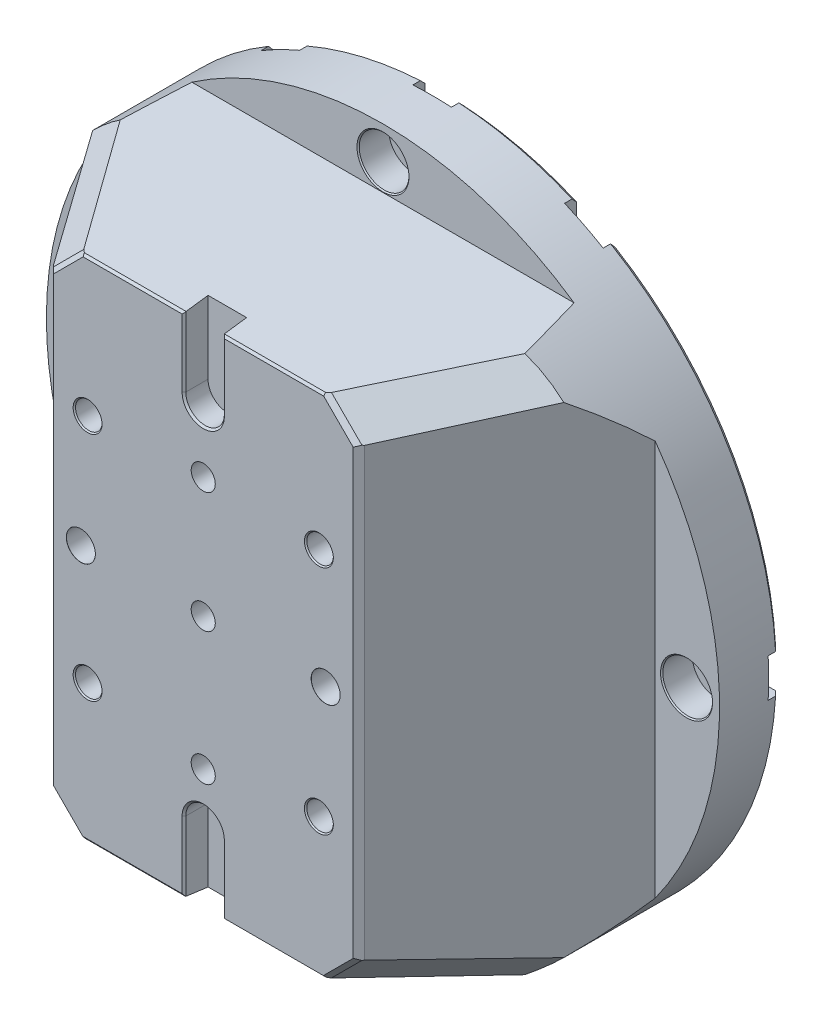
ISO-10303-21;
HEADER;
FILE_DESCRIPTION(('STEP AP214'),'2;1');
FILE_NAME('part.step','',(''),(''),'','','');
FILE_SCHEMA(('AUTOMOTIVE_DESIGN { 1 0 10303 214 1 1 1 1 }'));
ENDSEC;
DATA;
#1=APPLICATION_CONTEXT('core data for automotive mechanical design processes');
#2=APPLICATION_PROTOCOL_DEFINITION('international standard','automotive_design',2000,#1);
#3=PRODUCT_CONTEXT('',#1,'mechanical');
#4=PRODUCT('Part','Part','',(#3));
#5=PRODUCT_RELATED_PRODUCT_CATEGORY('part','',(#4));
#6=PRODUCT_DEFINITION_FORMATION('','',#4);
#7=PRODUCT_DEFINITION_CONTEXT('part definition',#1,'design');
#8=PRODUCT_DEFINITION('design','',#6,#7);
#9=PRODUCT_DEFINITION_SHAPE('','',#8);
#10=(LENGTH_UNIT() NAMED_UNIT(*) SI_UNIT(.MILLI.,.METRE.));
#11=(NAMED_UNIT(*) PLANE_ANGLE_UNIT() SI_UNIT($,.RADIAN.));
#12=(NAMED_UNIT(*) SI_UNIT($,.STERADIAN.) SOLID_ANGLE_UNIT());
#13=UNCERTAINTY_MEASURE_WITH_UNIT(LENGTH_MEASURE(1.E-05),#10,'distance_accuracy_value','');
#14=(GEOMETRIC_REPRESENTATION_CONTEXT(3) GLOBAL_UNCERTAINTY_ASSIGNED_CONTEXT((#13)) GLOBAL_UNIT_ASSIGNED_CONTEXT((#10,
#11,#12)) REPRESENTATION_CONTEXT('',''));
#15=CARTESIAN_POINT('',(0.,0.,0.));
#16=DIRECTION('',(0.,0.,1.));
#17=DIRECTION('',(1.,0.,0.));
#18=AXIS2_PLACEMENT_3D('',#15,#16,#17);
#19=CARTESIAN_POINT('',(63.0498626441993,104.775,20.011400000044));
#20=DIRECTION('',(0.,0.,-1.));
#21=DIRECTION('',(-1.,0.,0.));
#22=AXIS2_PLACEMENT_3D('',#19,#20,#21);
#23=CONICAL_SURFACE('',#22,2.49999999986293,1.02974425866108);
#24=CARTESIAN_POINT('',(63.0498626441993,104.775,21.5135515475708));
#25=VERTEX_POINT('',#24);
#26=VERTEX_LOOP('',#25);
#27=FACE_BOUND('',#26,.T.);
#28=CARTESIAN_POINT('',(63.0498626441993,104.775,20.0114));
#29=DIRECTION('',(0.,0.,-1.));
#30=DIRECTION('',(-1.,0.,0.));
#31=AXIS2_PLACEMENT_3D('',#28,#29,#30);
#32=CIRCLE('',#31,2.5);
#33=CARTESIAN_POINT('',(60.5498626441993,104.775,20.0114));
#34=VERTEX_POINT('',#33);
#35=EDGE_CURVE('E588',#34,#34,#32,.T.);
#36=ORIENTED_EDGE('',*,*,#35,.T.);
#37=EDGE_LOOP('',(#36));
#38=FACE_BOUND('',#37,.T.);
#39=ADVANCED_FACE('F16',(#27,#38),#23,.F.);
#40=CARTESIAN_POINT('',(0.,104.775,20.0113999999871));
#41=DIRECTION('',(0.,0.,-1.));
#42=DIRECTION('',(-1.,0.,0.));
#43=AXIS2_PLACEMENT_3D('',#40,#41,#42);
#44=CONICAL_SURFACE('',#43,2.49999999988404,1.02974425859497);
#45=CARTESIAN_POINT('',(5.68440311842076E-11,104.775,21.5135515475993));
#46=VERTEX_POINT('',#45);
#47=VERTEX_LOOP('',#46);
#48=FACE_BOUND('',#47,.T.);
#49=CARTESIAN_POINT('',(0.,104.775,20.0114));
#50=DIRECTION('',(0.,0.,-1.));
#51=DIRECTION('',(-1.,0.,0.));
#52=AXIS2_PLACEMENT_3D('',#49,#50,#51);
#53=CIRCLE('',#52,2.5);
#54=CARTESIAN_POINT('',(-2.5,104.775,20.0114));
#55=VERTEX_POINT('',#54);
#56=EDGE_CURVE('E585',#55,#55,#53,.T.);
#57=ORIENTED_EDGE('',*,*,#56,.T.);
#58=EDGE_LOOP('',(#57));
#59=FACE_BOUND('',#58,.T.);
#60=ADVANCED_FACE('F3477',(#48,#59),#44,.F.);
#61=CARTESIAN_POINT('',(-63.0498626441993,104.775,20.0113999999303));
#62=DIRECTION('',(0.,0.,-1.));
#63=DIRECTION('',(-1.,0.,0.));
#64=AXIS2_PLACEMENT_3D('',#61,#62,#63);
#65=CONICAL_SURFACE('',#64,2.50000000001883,1.0297442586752);
#66=CARTESIAN_POINT('',(-63.0498626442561,104.775,21.5135515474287));
#67=VERTEX_POINT('',#66);
#68=VERTEX_LOOP('',#67);
#69=FACE_BOUND('',#68,.T.);
#70=CARTESIAN_POINT('',(-63.0498626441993,104.775,20.0114));
#71=DIRECTION('',(0.,0.,-1.));
#72=DIRECTION('',(-1.,0.,0.));
#73=AXIS2_PLACEMENT_3D('',#70,#71,#72);
#74=CIRCLE('',#73,2.49999999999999);
#75=CARTESIAN_POINT('',(-65.5498626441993,104.775,20.0114));
#76=VERTEX_POINT('',#75);
#77=EDGE_CURVE('E582',#76,#76,#74,.T.);
#78=ORIENTED_EDGE('',*,*,#77,.T.);
#79=EDGE_LOOP('',(#78));
#80=FACE_BOUND('',#79,.T.);
#81=ADVANCED_FACE('F3466',(#69,#80),#65,.F.);
#82=CARTESIAN_POINT('',(-104.775,1.09745987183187E-12,20.0114000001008));
#83=DIRECTION('',(0.,0.,-1.));
#84=DIRECTION('',(-1.,0.,0.));
#85=AXIS2_PLACEMENT_3D('',#82,#83,#84);
#86=CONICAL_SURFACE('',#85,2.49999999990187,1.02974425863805);
#87=CARTESIAN_POINT('',(-104.775000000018,1.09745987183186E-12,21.5135515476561));
#88=VERTEX_POINT('',#87);
#89=VERTEX_LOOP('',#88);
#90=FACE_BOUND('',#89,.T.);
#91=CARTESIAN_POINT('',(-104.775,1.09745987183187E-12,20.0114));
#92=DIRECTION('',(0.,0.,-1.));
#93=DIRECTION('',(-1.,0.,0.));
#94=AXIS2_PLACEMENT_3D('',#91,#92,#93);
#95=CIRCLE('',#94,2.5);
#96=CARTESIAN_POINT('',(-107.275,1.09745987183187E-12,20.0114));
#97=VERTEX_POINT('',#96);
#98=EDGE_CURVE('E579',#97,#97,#95,.T.);
#99=ORIENTED_EDGE('',*,*,#98,.T.);
#100=EDGE_LOOP('',(#99));
#101=FACE_BOUND('',#100,.T.);
#102=ADVANCED_FACE('F3455',(#90,#101),#86,.F.);
#103=CARTESIAN_POINT('',(-63.0498626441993,-104.775,20.011400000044));
#104=DIRECTION('',(0.,0.,-1.));
#105=DIRECTION('',(-1.,0.,0.));
#106=AXIS2_PLACEMENT_3D('',#103,#104,#105);
#107=CONICAL_SURFACE('',#106,2.49999999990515,1.02974425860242);
#108=CARTESIAN_POINT('',(-63.0498626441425,-104.775,21.5135515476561));
#109=VERTEX_POINT('',#108);
#110=VERTEX_LOOP('',#109);
#111=FACE_BOUND('',#110,.T.);
#112=CARTESIAN_POINT('',(-63.0498626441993,-104.775,20.0114));
#113=DIRECTION('',(0.,0.,-1.));
#114=DIRECTION('',(-1.,0.,0.));
#115=AXIS2_PLACEMENT_3D('',#112,#113,#114);
#116=CIRCLE('',#115,2.49999999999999);
#117=CARTESIAN_POINT('',(-65.5498626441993,-104.775,20.0114));
#118=VERTEX_POINT('',#117);
#119=EDGE_CURVE('E576',#118,#118,#116,.T.);
#120=ORIENTED_EDGE('',*,*,#119,.T.);
#121=EDGE_LOOP('',(#120));
#122=FACE_BOUND('',#121,.T.);
#123=ADVANCED_FACE('F3444',(#111,#122),#107,.F.);
#124=CARTESIAN_POINT('',(0.,-104.775,20.0113999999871));
#125=DIRECTION('',(0.,0.,-1.));
#126=DIRECTION('',(-1.,0.,0.));
#127=AXIS2_PLACEMENT_3D('',#124,#125,#126);
#128=CONICAL_SURFACE('',#127,2.49999999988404,1.02974425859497);
#129=CARTESIAN_POINT('',(5.68440311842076E-11,-104.775,21.5135515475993));
#130=VERTEX_POINT('',#129);
#131=VERTEX_LOOP('',#130);
#132=FACE_BOUND('',#131,.T.);
#133=CARTESIAN_POINT('',(0.,-104.775,20.0114));
#134=DIRECTION('',(0.,0.,-1.));
#135=DIRECTION('',(-1.,0.,0.));
#136=AXIS2_PLACEMENT_3D('',#133,#134,#135);
#137=CIRCLE('',#136,2.5);
#138=CARTESIAN_POINT('',(-2.5,-104.775,20.0114));
#139=VERTEX_POINT('',#138);
#140=EDGE_CURVE('E573',#139,#139,#137,.T.);
#141=ORIENTED_EDGE('',*,*,#140,.T.);
#142=EDGE_LOOP('',(#141));
#143=FACE_BOUND('',#142,.T.);
#144=ADVANCED_FACE('F3433',(#132,#143),#128,.F.);
#145=CARTESIAN_POINT('',(63.0498626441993,-104.775,20.011400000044));
#146=DIRECTION('',(0.,0.,-1.));
#147=DIRECTION('',(-1.,0.,0.));
#148=AXIS2_PLACEMENT_3D('',#145,#146,#147);
#149=CONICAL_SURFACE('',#148,2.49999999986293,1.02974425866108);
#150=CARTESIAN_POINT('',(63.0498626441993,-104.775,21.5135515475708));
#151=VERTEX_POINT('',#150);
#152=VERTEX_LOOP('',#151);
#153=FACE_BOUND('',#152,.T.);
#154=CARTESIAN_POINT('',(63.0498626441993,-104.775,20.0114));
#155=DIRECTION('',(0.,0.,-1.));
#156=DIRECTION('',(-1.,0.,0.));
#157=AXIS2_PLACEMENT_3D('',#154,#155,#156);
#158=CIRCLE('',#157,2.5);
#159=CARTESIAN_POINT('',(60.5498626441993,-104.775,20.0114));
#160=VERTEX_POINT('',#159);
#161=EDGE_CURVE('E570',#160,#160,#158,.T.);
#162=ORIENTED_EDGE('',*,*,#161,.T.);
#163=EDGE_LOOP('',(#162));
#164=FACE_BOUND('',#163,.T.);
#165=ADVANCED_FACE('F3422',(#153,#164),#149,.F.);
#166=CARTESIAN_POINT('',(104.775,-3.65819957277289E-13,20.0113999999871));
#167=DIRECTION('',(0.,0.,-1.));
#168=DIRECTION('',(-1.,0.,0.));
#169=AXIS2_PLACEMENT_3D('',#166,#167,#168);
#170=CONICAL_SURFACE('',#169,2.50000000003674,1.02974425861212);
#171=CARTESIAN_POINT('',(104.774999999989,-3.65819957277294E-13,21.5135515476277));
#172=VERTEX_POINT('',#171);
#173=VERTEX_LOOP('',#172);
#174=FACE_BOUND('',#173,.T.);
#175=CARTESIAN_POINT('',(104.775,-3.65819957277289E-13,20.0114));
#176=DIRECTION('',(0.,0.,-1.));
#177=DIRECTION('',(-1.,0.,0.));
#178=AXIS2_PLACEMENT_3D('',#175,#176,#177);
#179=CIRCLE('',#178,2.5);
#180=CARTESIAN_POINT('',(102.275,-3.65819957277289E-13,20.0114));
#181=VERTEX_POINT('',#180);
#182=EDGE_CURVE('E567',#181,#181,#179,.T.);
#183=ORIENTED_EDGE('',*,*,#182,.T.);
#184=EDGE_LOOP('',(#183));
#185=FACE_BOUND('',#184,.T.);
#186=ADVANCED_FACE('F3411',(#174,#185),#170,.F.);
#187=CARTESIAN_POINT('',(63.0498626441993,104.775,5.));
#188=DIRECTION('',(0.,0.,-1.));
#189=DIRECTION('',(-1.,0.,0.));
#190=AXIS2_PLACEMENT_3D('',#187,#188,#189);
#191=CYLINDRICAL_SURFACE('',#190,2.5);
#192=ORIENTED_EDGE('',*,*,#35,.F.);
#193=EDGE_LOOP('',(#192));
#194=FACE_BOUND('',#193,.T.);
#195=CARTESIAN_POINT('',(63.0498626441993,104.775,17.0000014));
#196=DIRECTION('',(0.,0.,-1.));
#197=DIRECTION('',(-1.,0.,0.));
#198=AXIS2_PLACEMENT_3D('',#195,#196,#197);
#199=CIRCLE('',#198,2.5);
#200=CARTESIAN_POINT('',(60.5498626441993,104.775,17.0000014));
#201=VERTEX_POINT('',#200);
#202=EDGE_CURVE('E19',#201,#201,#199,.T.);
#203=ORIENTED_EDGE('',*,*,#202,.T.);
#204=EDGE_LOOP('',(#203));
#205=FACE_BOUND('',#204,.T.);
#206=ADVANCED_FACE('F1165',(#194,#205),#191,.F.);
#207=CARTESIAN_POINT('',(0.,104.775,5.));
#208=DIRECTION('',(0.,0.,-1.));
#209=DIRECTION('',(-1.,0.,0.));
#210=AXIS2_PLACEMENT_3D('',#207,#208,#209);
#211=CYLINDRICAL_SURFACE('',#210,2.5);
#212=ORIENTED_EDGE('',*,*,#56,.F.);
#213=EDGE_LOOP('',(#212));
#214=FACE_BOUND('',#213,.T.);
#215=CARTESIAN_POINT('',(0.,104.775,17.0000014));
#216=DIRECTION('',(0.,0.,-1.));
#217=DIRECTION('',(-1.,0.,0.));
#218=AXIS2_PLACEMENT_3D('',#215,#216,#217);
#219=CIRCLE('',#218,2.5);
#220=CARTESIAN_POINT('',(-2.5,104.775,17.0000014));
#221=VERTEX_POINT('',#220);
#222=EDGE_CURVE('E1158',#221,#221,#219,.T.);
#223=ORIENTED_EDGE('',*,*,#222,.T.);
#224=EDGE_LOOP('',(#223));
#225=FACE_BOUND('',#224,.T.);
#226=ADVANCED_FACE('F3390',(#214,#225),#211,.F.);
#227=CARTESIAN_POINT('',(-63.0498626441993,104.775,5.));
#228=DIRECTION('',(0.,0.,-1.));
#229=DIRECTION('',(-1.,0.,0.));
#230=AXIS2_PLACEMENT_3D('',#227,#228,#229);
#231=CYLINDRICAL_SURFACE('',#230,2.49999999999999);
#232=ORIENTED_EDGE('',*,*,#77,.F.);
#233=EDGE_LOOP('',(#232));
#234=FACE_BOUND('',#233,.T.);
#235=CARTESIAN_POINT('',(-63.0498626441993,104.775,17.0000014));
#236=DIRECTION('',(0.,0.,-1.));
#237=DIRECTION('',(-1.,0.,0.));
#238=AXIS2_PLACEMENT_3D('',#235,#236,#237);
#239=CIRCLE('',#238,2.49999999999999);
#240=CARTESIAN_POINT('',(-65.5498626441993,104.775,17.0000014));
#241=VERTEX_POINT('',#240);
#242=EDGE_CURVE('E1156',#241,#241,#239,.T.);
#243=ORIENTED_EDGE('',*,*,#242,.T.);
#244=EDGE_LOOP('',(#243));
#245=FACE_BOUND('',#244,.T.);
#246=ADVANCED_FACE('F3379',(#234,#245),#231,.F.);
#247=CARTESIAN_POINT('',(-104.775,1.09745987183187E-12,5.00000000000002));
#248=DIRECTION('',(0.,0.,-1.));
#249=DIRECTION('',(-1.,0.,0.));
#250=AXIS2_PLACEMENT_3D('',#247,#248,#249);
#251=CYLINDRICAL_SURFACE('',#250,2.5);
#252=ORIENTED_EDGE('',*,*,#98,.F.);
#253=EDGE_LOOP('',(#252));
#254=FACE_BOUND('',#253,.T.);
#255=CARTESIAN_POINT('',(-104.775,1.09745987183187E-12,17.0000014));
#256=DIRECTION('',(0.,0.,-1.));
#257=DIRECTION('',(-1.,0.,0.));
#258=AXIS2_PLACEMENT_3D('',#255,#256,#257);
#259=CIRCLE('',#258,2.5);
#260=CARTESIAN_POINT('',(-107.275,1.09745987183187E-12,17.0000014));
#261=VERTEX_POINT('',#260);
#262=EDGE_CURVE('E1153',#261,#261,#259,.T.);
#263=ORIENTED_EDGE('',*,*,#262,.T.);
#264=EDGE_LOOP('',(#263));
#265=FACE_BOUND('',#264,.T.);
#266=ADVANCED_FACE('F3367',(#254,#265),#251,.F.);
#267=CARTESIAN_POINT('',(-63.0498626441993,-104.775,5.00000000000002));
#268=DIRECTION('',(0.,0.,-1.));
#269=DIRECTION('',(-1.,0.,0.));
#270=AXIS2_PLACEMENT_3D('',#267,#268,#269);
#271=CYLINDRICAL_SURFACE('',#270,2.49999999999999);
#272=ORIENTED_EDGE('',*,*,#119,.F.);
#273=EDGE_LOOP('',(#272));
#274=FACE_BOUND('',#273,.T.);
#275=CARTESIAN_POINT('',(-63.0498626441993,-104.775,17.0000014));
#276=DIRECTION('',(0.,0.,-1.));
#277=DIRECTION('',(-1.,0.,0.));
#278=AXIS2_PLACEMENT_3D('',#275,#276,#277);
#279=CIRCLE('',#278,2.49999999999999);
#280=CARTESIAN_POINT('',(-65.5498626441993,-104.775,17.0000014));
#281=VERTEX_POINT('',#280);
#282=EDGE_CURVE('E1150',#281,#281,#279,.T.);
#283=ORIENTED_EDGE('',*,*,#282,.T.);
#284=EDGE_LOOP('',(#283));
#285=FACE_BOUND('',#284,.T.);
#286=ADVANCED_FACE('F3357',(#274,#285),#271,.F.);
#287=CARTESIAN_POINT('',(0.,-104.775,5.));
#288=DIRECTION('',(0.,0.,-1.));
#289=DIRECTION('',(-1.,0.,0.));
#290=AXIS2_PLACEMENT_3D('',#287,#288,#289);
#291=CYLINDRICAL_SURFACE('',#290,2.5);
#292=ORIENTED_EDGE('',*,*,#140,.F.);
#293=EDGE_LOOP('',(#292));
#294=FACE_BOUND('',#293,.T.);
#295=CARTESIAN_POINT('',(0.,-104.775,17.0000014));
#296=DIRECTION('',(0.,0.,-1.));
#297=DIRECTION('',(-1.,0.,0.));
#298=AXIS2_PLACEMENT_3D('',#295,#296,#297);
#299=CIRCLE('',#298,2.5);
#300=CARTESIAN_POINT('',(-2.5,-104.775,17.0000014));
#301=VERTEX_POINT('',#300);
#302=EDGE_CURVE('E1147',#301,#301,#299,.T.);
#303=ORIENTED_EDGE('',*,*,#302,.T.);
#304=EDGE_LOOP('',(#303));
#305=FACE_BOUND('',#304,.T.);
#306=ADVANCED_FACE('F3347',(#294,#305),#291,.F.);
#307=CARTESIAN_POINT('',(63.0498626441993,-104.775,4.99999999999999));
#308=DIRECTION('',(0.,0.,-1.));
#309=DIRECTION('',(-1.,0.,0.));
#310=AXIS2_PLACEMENT_3D('',#307,#308,#309);
#311=CYLINDRICAL_SURFACE('',#310,2.5);
#312=ORIENTED_EDGE('',*,*,#161,.F.);
#313=EDGE_LOOP('',(#312));
#314=FACE_BOUND('',#313,.T.);
#315=CARTESIAN_POINT('',(63.0498626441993,-104.775,17.0000014));
#316=DIRECTION('',(0.,0.,-1.));
#317=DIRECTION('',(-1.,0.,0.));
#318=AXIS2_PLACEMENT_3D('',#315,#316,#317);
#319=CIRCLE('',#318,2.5);
#320=CARTESIAN_POINT('',(60.5498626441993,-104.775,17.0000014));
#321=VERTEX_POINT('',#320);
#322=EDGE_CURVE('E1144',#321,#321,#319,.T.);
#323=ORIENTED_EDGE('',*,*,#322,.T.);
#324=EDGE_LOOP('',(#323));
#325=FACE_BOUND('',#324,.T.);
#326=ADVANCED_FACE('F1181',(#314,#325),#311,.F.);
#327=CARTESIAN_POINT('',(104.775,-3.65819957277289E-13,4.99999999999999));
#328=DIRECTION('',(0.,0.,-1.));
#329=DIRECTION('',(-1.,0.,0.));
#330=AXIS2_PLACEMENT_3D('',#327,#328,#329);
#331=CYLINDRICAL_SURFACE('',#330,2.5);
#332=ORIENTED_EDGE('',*,*,#182,.F.);
#333=EDGE_LOOP('',(#332));
#334=FACE_BOUND('',#333,.T.);
#335=CARTESIAN_POINT('',(104.775,-3.65819957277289E-13,17.0000014));
#336=DIRECTION('',(0.,0.,-1.));
#337=DIRECTION('',(-1.,0.,0.));
#338=AXIS2_PLACEMENT_3D('',#335,#336,#337);
#339=CIRCLE('',#338,2.5);
#340=CARTESIAN_POINT('',(102.275,-3.65819957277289E-13,17.0000014));
#341=VERTEX_POINT('',#340);
#342=EDGE_CURVE('E1141',#341,#341,#339,.T.);
#343=ORIENTED_EDGE('',*,*,#342,.T.);
#344=EDGE_LOOP('',(#343));
#345=FACE_BOUND('',#344,.T.);
#346=ADVANCED_FACE('F1170',(#334,#345),#331,.F.);
#347=CARTESIAN_POINT('',(65.5498626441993,104.775,17.0000014));
#348=DIRECTION('',(0.,0.,1.));
#349=DIRECTION('',(1.,0.,0.));
#350=AXIS2_PLACEMENT_3D('',#347,#348,#349);
#351=PLANE('',#350);
#352=CARTESIAN_POINT('',(63.0498626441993,104.775,17.0000014));
#353=DIRECTION('',(0.,0.,-1.));
#354=DIRECTION('',(-1.,0.,0.));
#355=AXIS2_PLACEMENT_3D('',#352,#353,#354);
#356=CIRCLE('',#355,3.);
#357=CARTESIAN_POINT('',(60.0498626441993,104.775,17.0000014));
#358=VERTEX_POINT('',#357);
#359=EDGE_CURVE('E525',#358,#358,#356,.T.);
#360=ORIENTED_EDGE('',*,*,#359,.T.);
#361=EDGE_LOOP('',(#360));
#362=FACE_BOUND('',#361,.T.);
#363=ORIENTED_EDGE('',*,*,#202,.F.);
#364=EDGE_LOOP('',(#363));
#365=FACE_BOUND('',#364,.T.);
#366=ADVANCED_FACE('F1167',(#362,#365),#351,.F.);
#367=CARTESIAN_POINT('',(2.5,104.775,17.0000014));
#368=DIRECTION('',(0.,0.,1.));
#369=DIRECTION('',(1.,0.,0.));
#370=AXIS2_PLACEMENT_3D('',#367,#368,#369);
#371=PLANE('',#370);
#372=CARTESIAN_POINT('',(0.,104.775,17.0000014));
#373=DIRECTION('',(0.,0.,-1.));
#374=DIRECTION('',(-1.,0.,0.));
#375=AXIS2_PLACEMENT_3D('',#372,#373,#374);
#376=CIRCLE('',#375,3.);
#377=CARTESIAN_POINT('',(-3.,104.775,17.0000014));
#378=VERTEX_POINT('',#377);
#379=EDGE_CURVE('E524',#378,#378,#376,.T.);
#380=ORIENTED_EDGE('',*,*,#379,.T.);
#381=EDGE_LOOP('',(#380));
#382=FACE_BOUND('',#381,.T.);
#383=ORIENTED_EDGE('',*,*,#222,.F.);
#384=EDGE_LOOP('',(#383));
#385=FACE_BOUND('',#384,.T.);
#386=ADVANCED_FACE('F1169',(#382,#385),#371,.F.);
#387=CARTESIAN_POINT('',(10.31875,126.,12.7));
#388=DIRECTION('',(0.,0.,-1.));
#389=DIRECTION('',(-1.,0.,0.));
#390=AXIS2_PLACEMENT_3D('',#387,#388,#389);
#391=PLANE('',#390);
#392=CARTESIAN_POINT('',(0.,126.,12.7));
#393=DIRECTION('',(0.,0.,1.));
#394=DIRECTION('',(1.,0.,0.));
#395=AXIS2_PLACEMENT_3D('',#392,#393,#394);
#396=CIRCLE('',#395,10.31875);
#397=CARTESIAN_POINT('',(10.31875,126.,12.7));
#398=VERTEX_POINT('',#397);
#399=EDGE_CURVE('E1135',#398,#398,#396,.T.);
#400=ORIENTED_EDGE('',*,*,#399,.T.);
#401=EDGE_LOOP('',(#400));
#402=FACE_BOUND('',#401,.T.);
#403=CARTESIAN_POINT('',(0.,126.,12.7));
#404=DIRECTION('',(0.,0.,1.));
#405=DIRECTION('',(1.,0.,0.));
#406=AXIS2_PLACEMENT_3D('',#403,#404,#405);
#407=CIRCLE('',#406,6.54812);
#408=CARTESIAN_POINT('',(6.54812000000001,126.,12.7));
#409=VERTEX_POINT('',#408);
#410=EDGE_CURVE('E1128',#409,#409,#407,.F.);
#411=ORIENTED_EDGE('',*,*,#410,.T.);
#412=EDGE_LOOP('',(#411));
#413=FACE_BOUND('',#412,.T.);
#414=ADVANCED_FACE('F1178',(#402,#413),#391,.F.);
#415=CARTESIAN_POINT('',(-60.5498626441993,104.775,17.0000014));
#416=DIRECTION('',(0.,0.,1.));
#417=DIRECTION('',(1.,0.,0.));
#418=AXIS2_PLACEMENT_3D('',#415,#416,#417);
#419=PLANE('',#418);
#420=CARTESIAN_POINT('',(-63.0498626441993,104.775,17.0000014));
#421=DIRECTION('',(0.,0.,-1.));
#422=DIRECTION('',(-1.,0.,0.));
#423=AXIS2_PLACEMENT_3D('',#420,#421,#422);
#424=CIRCLE('',#423,2.99999999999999);
#425=CARTESIAN_POINT('',(-66.0498626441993,104.775,17.0000014));
#426=VERTEX_POINT('',#425);
#427=EDGE_CURVE('E1125',#426,#426,#424,.T.);
#428=ORIENTED_EDGE('',*,*,#427,.T.);
#429=EDGE_LOOP('',(#428));
#430=FACE_BOUND('',#429,.T.);
#431=ORIENTED_EDGE('',*,*,#242,.F.);
#432=EDGE_LOOP('',(#431));
#433=FACE_BOUND('',#432,.T.);
#434=ADVANCED_FACE('F1547',(#430,#433),#419,.F.);
#435=CARTESIAN_POINT('',(-102.275,1.09745987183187E-12,17.0000014));
#436=DIRECTION('',(0.,0.,1.));
#437=DIRECTION('',(1.,0.,0.));
#438=AXIS2_PLACEMENT_3D('',#435,#436,#437);
#439=PLANE('',#438);
#440=CARTESIAN_POINT('',(-104.775,1.09745987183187E-12,17.0000014));
#441=DIRECTION('',(0.,0.,-1.));
#442=DIRECTION('',(-1.,0.,0.));
#443=AXIS2_PLACEMENT_3D('',#440,#441,#442);
#444=CIRCLE('',#443,2.99999999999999);
#445=CARTESIAN_POINT('',(-107.775,1.09745987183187E-12,17.0000014));
#446=VERTEX_POINT('',#445);
#447=EDGE_CURVE('E1114',#446,#446,#444,.T.);
#448=ORIENTED_EDGE('',*,*,#447,.T.);
#449=EDGE_LOOP('',(#448));
#450=FACE_BOUND('',#449,.T.);
#451=ORIENTED_EDGE('',*,*,#262,.F.);
#452=EDGE_LOOP('',(#451));
#453=FACE_BOUND('',#452,.T.);
#454=ADVANCED_FACE('F1543',(#450,#453),#439,.F.);
#455=CARTESIAN_POINT('',(-115.68125,-1.31041838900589E-12,12.7));
#456=DIRECTION('',(0.,0.,-1.));
#457=DIRECTION('',(0.,1.,0.));
#458=AXIS2_PLACEMENT_3D('',#455,#456,#457);
#459=PLANE('',#458);
#460=CARTESIAN_POINT('',(-126.,-1.31041838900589E-12,12.7));
#461=DIRECTION('',(0.,0.,1.));
#462=DIRECTION('',(0.,-1.,0.));
#463=AXIS2_PLACEMENT_3D('',#460,#461,#462);
#464=CIRCLE('',#463,10.31875);
#465=CARTESIAN_POINT('',(-126.,-10.3187500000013,12.7));
#466=VERTEX_POINT('',#465);
#467=EDGE_CURVE('E1138',#466,#466,#464,.T.);
#468=ORIENTED_EDGE('',*,*,#467,.T.);
#469=EDGE_LOOP('',(#468));
#470=FACE_BOUND('',#469,.T.);
#471=CARTESIAN_POINT('',(-126.,-1.31041838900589E-12,12.7));
#472=DIRECTION('',(0.,0.,1.));
#473=DIRECTION('',(0.,-1.,0.));
#474=AXIS2_PLACEMENT_3D('',#471,#472,#473);
#475=CIRCLE('',#474,6.54812);
#476=CARTESIAN_POINT('',(-126.,-6.54812000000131,12.7));
#477=VERTEX_POINT('',#476);
#478=EDGE_CURVE('E1111',#477,#477,#475,.F.);
#479=ORIENTED_EDGE('',*,*,#478,.T.);
#480=EDGE_LOOP('',(#479));
#481=FACE_BOUND('',#480,.T.);
#482=ADVANCED_FACE('F1539',(#470,#481),#459,.F.);
#483=CARTESIAN_POINT('',(-60.5498626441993,-104.775,17.0000014));
#484=DIRECTION('',(0.,0.,1.));
#485=DIRECTION('',(1.,0.,0.));
#486=AXIS2_PLACEMENT_3D('',#483,#484,#485);
#487=PLANE('',#486);
#488=CARTESIAN_POINT('',(-63.0498626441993,-104.775,17.0000014));
#489=DIRECTION('',(0.,0.,-1.));
#490=DIRECTION('',(-1.,0.,0.));
#491=AXIS2_PLACEMENT_3D('',#488,#489,#490);
#492=CIRCLE('',#491,2.99999999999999);
#493=CARTESIAN_POINT('',(-66.0498626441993,-104.775,17.0000014));
#494=VERTEX_POINT('',#493);
#495=EDGE_CURVE('E1108',#494,#494,#492,.T.);
#496=ORIENTED_EDGE('',*,*,#495,.T.);
#497=EDGE_LOOP('',(#496));
#498=FACE_BOUND('',#497,.T.);
#499=ORIENTED_EDGE('',*,*,#282,.F.);
#500=EDGE_LOOP('',(#499));
#501=FACE_BOUND('',#500,.T.);
#502=ADVANCED_FACE('F1535',(#498,#501),#487,.F.);
#503=CARTESIAN_POINT('',(2.5,-104.775,17.0000014));
#504=DIRECTION('',(0.,0.,1.));
#505=DIRECTION('',(1.,0.,0.));
#506=AXIS2_PLACEMENT_3D('',#503,#504,#505);
#507=PLANE('',#506);
#508=CARTESIAN_POINT('',(0.,-104.775,17.0000014));
#509=DIRECTION('',(0.,0.,-1.));
#510=DIRECTION('',(-1.,0.,0.));
#511=AXIS2_PLACEMENT_3D('',#508,#509,#510);
#512=CIRCLE('',#511,3.);
#513=CARTESIAN_POINT('',(-3.,-104.775,17.0000014));
#514=VERTEX_POINT('',#513);
#515=EDGE_CURVE('E1102',#514,#514,#512,.T.);
#516=ORIENTED_EDGE('',*,*,#515,.T.);
#517=EDGE_LOOP('',(#516));
#518=FACE_BOUND('',#517,.T.);
#519=ORIENTED_EDGE('',*,*,#302,.F.);
#520=EDGE_LOOP('',(#519));
#521=FACE_BOUND('',#520,.T.);
#522=ADVANCED_FACE('F1531',(#518,#521),#507,.F.);
#523=CARTESIAN_POINT('',(10.31875,-126.,12.7));
#524=DIRECTION('',(0.,0.,-1.));
#525=DIRECTION('',(-1.,0.,0.));
#526=AXIS2_PLACEMENT_3D('',#523,#524,#525);
#527=PLANE('',#526);
#528=CARTESIAN_POINT('',(0.,-126.,12.7));
#529=DIRECTION('',(0.,0.,1.));
#530=DIRECTION('',(1.,0.,0.));
#531=AXIS2_PLACEMENT_3D('',#528,#529,#530);
#532=CIRCLE('',#531,10.31875);
#533=CARTESIAN_POINT('',(10.31875,-126.,12.7));
#534=VERTEX_POINT('',#533);
#535=EDGE_CURVE('E1117',#534,#534,#532,.T.);
#536=ORIENTED_EDGE('',*,*,#535,.T.);
#537=EDGE_LOOP('',(#536));
#538=FACE_BOUND('',#537,.T.);
#539=CARTESIAN_POINT('',(0.,-126.,12.7));
#540=DIRECTION('',(0.,0.,1.));
#541=DIRECTION('',(1.,0.,0.));
#542=AXIS2_PLACEMENT_3D('',#539,#540,#541);
#543=CIRCLE('',#542,6.54812);
#544=CARTESIAN_POINT('',(6.54811999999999,-126.,12.7));
#545=VERTEX_POINT('',#544);
#546=EDGE_CURVE('E1099',#545,#545,#543,.F.);
#547=ORIENTED_EDGE('',*,*,#546,.T.);
#548=EDGE_LOOP('',(#547));
#549=FACE_BOUND('',#548,.T.);
#550=ADVANCED_FACE('F1527',(#538,#549),#527,.F.);
#551=CARTESIAN_POINT('',(65.5498626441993,-104.775,17.0000014));
#552=DIRECTION('',(0.,0.,1.));
#553=DIRECTION('',(1.,0.,0.));
#554=AXIS2_PLACEMENT_3D('',#551,#552,#553);
#555=PLANE('',#554);
#556=CARTESIAN_POINT('',(63.0498626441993,-104.775,17.0000014));
#557=DIRECTION('',(0.,0.,-1.));
#558=DIRECTION('',(-1.,0.,0.));
#559=AXIS2_PLACEMENT_3D('',#556,#557,#558);
#560=CIRCLE('',#559,3.);
#561=CARTESIAN_POINT('',(60.0498626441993,-104.775,17.0000014));
#562=VERTEX_POINT('',#561);
#563=EDGE_CURVE('E1096',#562,#562,#560,.T.);
#564=ORIENTED_EDGE('',*,*,#563,.T.);
#565=EDGE_LOOP('',(#564));
#566=FACE_BOUND('',#565,.T.);
#567=ORIENTED_EDGE('',*,*,#322,.F.);
#568=EDGE_LOOP('',(#567));
#569=FACE_BOUND('',#568,.T.);
#570=ADVANCED_FACE('F1523',(#566,#569),#555,.F.);
#571=CARTESIAN_POINT('',(107.275,-3.65819957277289E-13,17.0000014));
#572=DIRECTION('',(0.,0.,1.));
#573=DIRECTION('',(1.,0.,0.));
#574=AXIS2_PLACEMENT_3D('',#571,#572,#573);
#575=PLANE('',#574);
#576=CARTESIAN_POINT('',(104.775,-3.65819957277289E-13,17.0000014));
#577=DIRECTION('',(0.,0.,-1.));
#578=DIRECTION('',(-1.,0.,0.));
#579=AXIS2_PLACEMENT_3D('',#576,#577,#578);
#580=CIRCLE('',#579,2.99999999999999);
#581=CARTESIAN_POINT('',(101.775,-3.65819957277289E-13,17.0000014));
#582=VERTEX_POINT('',#581);
#583=EDGE_CURVE('E1091',#582,#582,#580,.T.);
#584=ORIENTED_EDGE('',*,*,#583,.T.);
#585=EDGE_LOOP('',(#584));
#586=FACE_BOUND('',#585,.T.);
#587=ORIENTED_EDGE('',*,*,#342,.F.);
#588=EDGE_LOOP('',(#587));
#589=FACE_BOUND('',#588,.T.);
#590=ADVANCED_FACE('F1519',(#586,#589),#575,.F.);
#591=CARTESIAN_POINT('',(136.31875,4.30565091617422E-13,12.7));
#592=DIRECTION('',(0.,0.,-1.));
#593=DIRECTION('',(0.,1.,0.));
#594=AXIS2_PLACEMENT_3D('',#591,#592,#593);
#595=PLANE('',#594);
#596=CARTESIAN_POINT('',(126.,4.30565091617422E-13,12.7));
#597=DIRECTION('',(0.,0.,1.));
#598=DIRECTION('',(0.,-1.,0.));
#599=AXIS2_PLACEMENT_3D('',#596,#597,#598);
#600=CIRCLE('',#599,10.31875);
#601=CARTESIAN_POINT('',(126.,-10.3187499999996,12.7));
#602=VERTEX_POINT('',#601);
#603=EDGE_CURVE('E1120',#602,#602,#600,.T.);
#604=ORIENTED_EDGE('',*,*,#603,.T.);
#605=EDGE_LOOP('',(#604));
#606=FACE_BOUND('',#605,.T.);
#607=CARTESIAN_POINT('',(126.,4.30565091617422E-13,12.7));
#608=DIRECTION('',(0.,0.,1.));
#609=DIRECTION('',(0.,-1.,0.));
#610=AXIS2_PLACEMENT_3D('',#607,#608,#609);
#611=CIRCLE('',#610,6.54811999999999);
#612=CARTESIAN_POINT('',(126.,-6.54811999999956,12.7));
#613=VERTEX_POINT('',#612);
#614=EDGE_CURVE('E1088',#613,#613,#611,.F.);
#615=ORIENTED_EDGE('',*,*,#614,.T.);
#616=EDGE_LOOP('',(#615));
#617=FACE_BOUND('',#616,.T.);
#618=ADVANCED_FACE('F1515',(#606,#617),#595,.F.);
#619=CARTESIAN_POINT('',(50.8,0.,69.3421999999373));
#620=DIRECTION('',(0.,0.,1.));
#621=DIRECTION('',(1.,0.,0.));
#622=AXIS2_PLACEMENT_3D('',#619,#620,#621);
#623=CONICAL_SURFACE('',#622,5.10000000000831,1.02974425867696);
#624=CARTESIAN_POINT('',(50.8000000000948,0.,66.2778108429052));
#625=VERTEX_POINT('',#624);
#626=VERTEX_LOOP('',#625);
#627=FACE_BOUND('',#626,.T.);
#628=CARTESIAN_POINT('',(50.8,0.,69.3422));
#629=DIRECTION('',(0.,0.,1.));
#630=DIRECTION('',(1.,0.,0.));
#631=AXIS2_PLACEMENT_3D('',#628,#629,#630);
#632=CIRCLE('',#631,5.09999999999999);
#633=CARTESIAN_POINT('',(55.9,0.,69.3422));
#634=VERTEX_POINT('',#633);
#635=EDGE_CURVE('E563',#634,#634,#632,.T.);
#636=ORIENTED_EDGE('',*,*,#635,.T.);
#637=EDGE_LOOP('',(#636));
#638=FACE_BOUND('',#637,.T.);
#639=ADVANCED_FACE('F1511',(#627,#638),#623,.F.);
#640=CARTESIAN_POINT('',(-50.7999999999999,0.,69.3421999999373));
#641=DIRECTION('',(0.,0.,1.));
#642=DIRECTION('',(1.,0.,0.));
#643=AXIS2_PLACEMENT_3D('',#640,#641,#642);
#644=CONICAL_SURFACE('',#643,5.09999999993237,1.02974425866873);
#645=CARTESIAN_POINT('',(-50.799999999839,0.,66.2778108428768));
#646=VERTEX_POINT('',#645);
#647=VERTEX_LOOP('',#646);
#648=FACE_BOUND('',#647,.T.);
#649=CARTESIAN_POINT('',(-50.7999999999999,0.,69.3422));
#650=DIRECTION('',(0.,0.,1.));
#651=DIRECTION('',(1.,0.,0.));
#652=AXIS2_PLACEMENT_3D('',#649,#650,#651);
#653=CIRCLE('',#652,5.09999999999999);
#654=CARTESIAN_POINT('',(-45.6999999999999,0.,69.3422));
#655=VERTEX_POINT('',#654);
#656=EDGE_CURVE('E559',#655,#655,#653,.T.);
#657=ORIENTED_EDGE('',*,*,#656,.T.);
#658=EDGE_LOOP('',(#657));
#659=FACE_BOUND('',#658,.T.);
#660=ADVANCED_FACE('F1507',(#648,#659),#644,.F.);
#661=CARTESIAN_POINT('',(0.,0.,50.));
#662=DIRECTION('',(0.,0.,-1.));
#663=DIRECTION('',(-1.,0.,0.));
#664=AXIS2_PLACEMENT_3D('',#661,#662,#663);
#665=PLANE('',#664);
#666=CARTESIAN_POINT('',(0.,0.,50.));
#667=DIRECTION('',(0.,0.,-1.));
#668=DIRECTION('',(-1.,0.,0.));
#669=AXIS2_PLACEMENT_3D('',#666,#667,#668);
#670=CIRCLE('',#669,78.74);
#671=CARTESIAN_POINT('',(-78.74,0.,50.));
#672=VERTEX_POINT('',#671);
#673=EDGE_CURVE('E566',#672,#672,#670,.T.);
#674=ORIENTED_EDGE('',*,*,#673,.T.);
#675=EDGE_LOOP('',(#674));
#676=FACE_BOUND('',#675,.T.);
#677=CARTESIAN_POINT('',(-48.,48.,50.));
#678=DIRECTION('',(0.,0.,-1.));
#679=DIRECTION('',(-1.,0.,0.));
#680=AXIS2_PLACEMENT_3D('',#677,#678,#679);
#681=CIRCLE('',#680,8.99999999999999);
#682=CARTESIAN_POINT('',(-57.,48.,50.));
#683=VERTEX_POINT('',#682);
#684=EDGE_CURVE('E558',#683,#683,#681,.F.);
#685=ORIENTED_EDGE('',*,*,#684,.T.);
#686=EDGE_LOOP('',(#685));
#687=FACE_BOUND('',#686,.T.);
#688=CARTESIAN_POINT('',(48.,48.,50.));
#689=DIRECTION('',(0.,0.,-1.));
#690=DIRECTION('',(-1.,0.,0.));
#691=AXIS2_PLACEMENT_3D('',#688,#689,#690);
#692=CIRCLE('',#691,8.99999999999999);
#693=CARTESIAN_POINT('',(39.,48.,50.));
#694=VERTEX_POINT('',#693);
#695=EDGE_CURVE('E1066',#694,#694,#692,.F.);
#696=ORIENTED_EDGE('',*,*,#695,.T.);
#697=EDGE_LOOP('',(#696));
#698=FACE_BOUND('',#697,.T.);
#699=CARTESIAN_POINT('',(48.,-48.,50.));
#700=DIRECTION('',(0.,0.,-1.));
#701=DIRECTION('',(-1.,0.,0.));
#702=AXIS2_PLACEMENT_3D('',#699,#700,#701);
#703=CIRCLE('',#702,9.);
#704=CARTESIAN_POINT('',(39.,-48.,50.));
#705=VERTEX_POINT('',#704);
#706=EDGE_CURVE('E1069',#705,#705,#703,.F.);
#707=ORIENTED_EDGE('',*,*,#706,.T.);
#708=EDGE_LOOP('',(#707));
#709=FACE_BOUND('',#708,.T.);
#710=CARTESIAN_POINT('',(-48.,-48.,50.));
#711=DIRECTION('',(0.,0.,-1.));
#712=DIRECTION('',(-1.,0.,0.));
#713=AXIS2_PLACEMENT_3D('',#710,#711,#712);
#714=CIRCLE('',#713,8.99999999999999);
#715=CARTESIAN_POINT('',(-57.,-48.,50.));
#716=VERTEX_POINT('',#715);
#717=EDGE_CURVE('E562',#716,#716,#714,.F.);
#718=ORIENTED_EDGE('',*,*,#717,.T.);
#719=EDGE_LOOP('',(#718));
#720=FACE_BOUND('',#719,.T.);
#721=ADVANCED_FACE('F1499',(#676,#687,#698,#709,#720),#665,.T.);
#722=CARTESIAN_POINT('',(-126.,-1.30886308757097E-12,25.4));
#723=DIRECTION('',(0.,0.,1.));
#724=DIRECTION('',(0.,-1.,0.));
#725=AXIS2_PLACEMENT_3D('',#722,#723,#724);
#726=CYLINDRICAL_SURFACE('',#725,10.31875);
#727=ORIENTED_EDGE('',*,*,#467,.F.);
#728=EDGE_LOOP('',(#727));
#729=FACE_BOUND('',#728,.T.);
#730=CARTESIAN_POINT('',(-126.,-1.30892141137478E-12,24.92375));
#731=DIRECTION('',(0.,0.,1.));
#732=DIRECTION('',(0.,-1.,0.));
#733=AXIS2_PLACEMENT_3D('',#730,#731,#732);
#734=CIRCLE('',#733,10.31875);
#735=CARTESIAN_POINT('',(-126.,-10.3187500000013,24.92375));
#736=VERTEX_POINT('',#735);
#737=EDGE_CURVE('E555',#736,#736,#734,.T.);
#738=ORIENTED_EDGE('',*,*,#737,.T.);
#739=EDGE_LOOP('',(#738));
#740=FACE_BOUND('',#739,.T.);
#741=ADVANCED_FACE('F1490',(#729,#740),#726,.F.);
#742=CARTESIAN_POINT('',(0.,126.,25.4));
#743=DIRECTION('',(0.,0.,1.));
#744=DIRECTION('',(1.,0.,0.));
#745=AXIS2_PLACEMENT_3D('',#742,#743,#744);
#746=CYLINDRICAL_SURFACE('',#745,10.31875);
#747=ORIENTED_EDGE('',*,*,#399,.F.);
#748=EDGE_LOOP('',(#747));
#749=FACE_BOUND('',#748,.T.);
#750=CARTESIAN_POINT('',(0.,126.,24.92375));
#751=DIRECTION('',(0.,0.,1.));
#752=DIRECTION('',(1.,0.,0.));
#753=AXIS2_PLACEMENT_3D('',#750,#751,#752);
#754=CIRCLE('',#753,10.31875);
#755=CARTESIAN_POINT('',(10.31875,126.,24.92375));
#756=VERTEX_POINT('',#755);
#757=EDGE_CURVE('E552',#756,#756,#754,.T.);
#758=ORIENTED_EDGE('',*,*,#757,.T.);
#759=EDGE_LOOP('',(#758));
#760=FACE_BOUND('',#759,.T.);
#761=ADVANCED_FACE('F1487',(#749,#760),#746,.F.);
#762=CARTESIAN_POINT('',(63.0498626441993,104.775,5.));
#763=DIRECTION('',(0.,0.,-1.));
#764=DIRECTION('',(-1.,0.,0.));
#765=AXIS2_PLACEMENT_3D('',#762,#763,#764);
#766=CYLINDRICAL_SURFACE('',#765,3.);
#767=CARTESIAN_POINT('',(63.0498626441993,104.775,5.));
#768=DIRECTION('',(0.,0.,-1.));
#769=DIRECTION('',(-1.,0.,0.));
#770=AXIS2_PLACEMENT_3D('',#767,#768,#769);
#771=CIRCLE('',#770,3.);
#772=CARTESIAN_POINT('',(60.0498626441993,104.775,5.));
#773=VERTEX_POINT('',#772);
#774=EDGE_CURVE('E542',#773,#773,#771,.F.);
#775=ORIENTED_EDGE('',*,*,#774,.F.);
#776=EDGE_LOOP('',(#775));
#777=FACE_BOUND('',#776,.T.);
#778=ORIENTED_EDGE('',*,*,#359,.F.);
#779=EDGE_LOOP('',(#778));
#780=FACE_BOUND('',#779,.T.);
#781=ADVANCED_FACE('F1489',(#777,#780),#766,.F.);
#782=CARTESIAN_POINT('',(62.992,88.9,5.));
#783=DIRECTION('',(0.,0.,-1.));
#784=DIRECTION('',(-1.,0.,0.));
#785=AXIS2_PLACEMENT_3D('',#782,#783,#784);
#786=CYLINDRICAL_SURFACE('',#785,8.001);
#787=DIRECTION('',(0.,0.,-1.));
#788=VECTOR('',#787,1.);
#789=CARTESIAN_POINT('',(54.991,88.9,5.));
#790=LINE('',#789,#788);
#791=CARTESIAN_POINT('',(54.991,88.9,5.));
#792=VERTEX_POINT('',#791);
#793=CARTESIAN_POINT('',(54.991,88.9,0.));
#794=VERTEX_POINT('',#793);
#795=EDGE_CURVE('E546',#792,#794,#790,.T.);
#796=ORIENTED_EDGE('',*,*,#795,.F.);
#797=CARTESIAN_POINT('',(62.992,88.9,5.));
#798=DIRECTION('',(0.,0.,-1.));
#799=DIRECTION('',(-1.,0.,0.));
#800=AXIS2_PLACEMENT_3D('',#797,#798,#799);
#801=CIRCLE('',#800,8.001);
#802=CARTESIAN_POINT('',(70.993,88.9,5.));
#803=VERTEX_POINT('',#802);
#804=EDGE_CURVE('E540',#803,#792,#801,.T.);
#805=ORIENTED_EDGE('',*,*,#804,.F.);
#806=DIRECTION('',(0.,0.,1.));
#807=VECTOR('',#806,1.);
#808=CARTESIAN_POINT('',(70.993,88.9,5.));
#809=LINE('',#808,#807);
#810=CARTESIAN_POINT('',(70.993,88.9,0.));
#811=VERTEX_POINT('',#810);
#812=EDGE_CURVE('E532',#811,#803,#809,.T.);
#813=ORIENTED_EDGE('',*,*,#812,.F.);
#814=CARTESIAN_POINT('',(62.992,88.9,0.));
#815=DIRECTION('',(0.,0.,-1.));
#816=DIRECTION('',(-1.,0.,0.));
#817=AXIS2_PLACEMENT_3D('',#814,#815,#816);
#818=CIRCLE('',#817,8.001);
#819=EDGE_CURVE('E514',#811,#794,#818,.T.);
#820=ORIENTED_EDGE('',*,*,#819,.T.);
#821=EDGE_LOOP('',(#796,#805,#813,#820));
#822=FACE_BOUND('',#821,.T.);
#823=ADVANCED_FACE('F539',(#822),#786,.F.);
#824=CARTESIAN_POINT('',(139.7,0.,0.));
#825=DIRECTION('',(0.,0.,1.));
#826=DIRECTION('',(1.,0.,0.));
#827=AXIS2_PLACEMENT_3D('',#824,#825,#826);
#828=PLANE('',#827);
#829=ORIENTED_EDGE('',*,*,#819,.F.);
#830=DIRECTION('',(0.,-1.,0.));
#831=VECTOR('',#830,1.);
#832=CARTESIAN_POINT('',(70.993,128.42149321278,0.));
#833=LINE('',#832,#831);
#834=CARTESIAN_POINT('',(70.993,118.099347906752,0.));
#835=VERTEX_POINT('',#834);
#836=EDGE_CURVE('E518',#835,#811,#833,.T.);
#837=ORIENTED_EDGE('',*,*,#836,.F.);
#838=CARTESIAN_POINT('',(0.,0.,0.));
#839=DIRECTION('',(0.,0.,1.));
#840=DIRECTION('',(1.,0.,0.));
#841=AXIS2_PLACEMENT_3D('',#838,#839,#840);
#842=CIRCLE('',#841,137.795);
#843=CARTESIAN_POINT('',(137.562516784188,8.00099999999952,0.));
#844=VERTEX_POINT('',#843);
#845=EDGE_CURVE('E1055',#844,#835,#842,.T.);
#846=ORIENTED_EDGE('',*,*,#845,.F.);
#847=DIRECTION('',(-1.,0.,0.));
#848=VECTOR('',#847,1.);
#849=CARTESIAN_POINT('',(139.470692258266,8.00099999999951,0.));
#850=LINE('',#849,#848);
#851=CARTESIAN_POINT('',(88.539222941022,8.0009999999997,0.));
#852=VERTEX_POINT('',#851);
#853=EDGE_CURVE('E548',#844,#852,#850,.T.);
#854=ORIENTED_EDGE('',*,*,#853,.T.);
#855=CARTESIAN_POINT('',(0.,0.,0.));
#856=DIRECTION('',(0.,0.,-1.));
#857=DIRECTION('',(-1.,0.,0.));
#858=AXIS2_PLACEMENT_3D('',#855,#856,#857);
#859=CIRCLE('',#858,88.9);
#860=CARTESIAN_POINT('',(8.00099999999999,88.539222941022,0.));
#861=VERTEX_POINT('',#860);
#862=EDGE_CURVE('E1079',#852,#861,#859,.F.);
#863=ORIENTED_EDGE('',*,*,#862,.T.);
#864=DIRECTION('',(0.,1.,0.));
#865=VECTOR('',#864,1.);
#866=CARTESIAN_POINT('',(8.001,139.470692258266,0.));
#867=LINE('',#866,#865);
#868=CARTESIAN_POINT('',(8.001,137.562516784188,0.));
#869=VERTEX_POINT('',#868);
#870=EDGE_CURVE('E1622',#861,#869,#867,.T.);
#871=ORIENTED_EDGE('',*,*,#870,.T.);
#872=CARTESIAN_POINT('',(0.,0.,0.));
#873=DIRECTION('',(0.,0.,1.));
#874=DIRECTION('',(1.,0.,0.));
#875=AXIS2_PLACEMENT_3D('',#872,#873,#874);
#876=CIRCLE('',#875,137.795);
#877=CARTESIAN_POINT('',(54.991,126.346554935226,0.));
#878=VERTEX_POINT('',#877);
#879=EDGE_CURVE('E1612',#878,#869,#876,.T.);
#880=ORIENTED_EDGE('',*,*,#879,.F.);
#881=DIRECTION('',(0.,1.,0.));
#882=VECTOR('',#881,1.);
#883=CARTESIAN_POINT('',(54.991,128.42149321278,0.));
#884=LINE('',#883,#882);
#885=EDGE_CURVE('E520',#794,#878,#884,.T.);
#886=ORIENTED_EDGE('',*,*,#885,.F.);
#887=EDGE_LOOP('',(#829,#837,#846,#854,#863,#871,#880,#886));
#888=FACE_BOUND('',#887,.T.);
#889=ADVANCED_FACE('F516',(#888),#828,.F.);
#890=CARTESIAN_POINT('',(0.,104.775,5.));
#891=DIRECTION('',(0.,0.,-1.));
#892=DIRECTION('',(-1.,0.,0.));
#893=AXIS2_PLACEMENT_3D('',#890,#891,#892);
#894=CYLINDRICAL_SURFACE('',#893,3.);
#895=CARTESIAN_POINT('',(0.,104.775,5.));
#896=DIRECTION('',(0.,0.,-1.));
#897=DIRECTION('',(-1.,0.,0.));
#898=AXIS2_PLACEMENT_3D('',#895,#896,#897);
#899=CIRCLE('',#898,3.);
#900=CARTESIAN_POINT('',(-3.,104.775,5.));
#901=VERTEX_POINT('',#900);
#902=EDGE_CURVE('E1568',#901,#901,#899,.F.);
#903=ORIENTED_EDGE('',*,*,#902,.F.);
#904=EDGE_LOOP('',(#903));
#905=FACE_BOUND('',#904,.T.);
#906=ORIENTED_EDGE('',*,*,#379,.F.);
#907=EDGE_LOOP('',(#906));
#908=FACE_BOUND('',#907,.T.);
#909=ADVANCED_FACE('F1563',(#905,#908),#894,.F.);
#910=CARTESIAN_POINT('',(0.,126.,25.4));
#911=DIRECTION('',(0.,0.,1.));
#912=DIRECTION('',(1.,0.,0.));
#913=AXIS2_PLACEMENT_3D('',#910,#911,#912);
#914=CYLINDRICAL_SURFACE('',#913,6.54812);
#915=ORIENTED_EDGE('',*,*,#410,.F.);
#916=EDGE_LOOP('',(#915));
#917=FACE_BOUND('',#916,.T.);
#918=CARTESIAN_POINT('',(0.,126.,5.));
#919=DIRECTION('',(0.,0.,1.));
#920=DIRECTION('',(1.,0.,0.));
#921=AXIS2_PLACEMENT_3D('',#918,#919,#920);
#922=CIRCLE('',#921,6.54812);
#923=CARTESIAN_POINT('',(6.54812000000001,126.,5.));
#924=VERTEX_POINT('',#923);
#925=EDGE_CURVE('E1014',#924,#924,#922,.T.);
#926=ORIENTED_EDGE('',*,*,#925,.F.);
#927=EDGE_LOOP('',(#926));
#928=FACE_BOUND('',#927,.T.);
#929=ADVANCED_FACE('F1559',(#917,#928),#914,.F.);
#930=CARTESIAN_POINT('',(-63.0498626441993,104.775,5.));
#931=DIRECTION('',(0.,0.,-1.));
#932=DIRECTION('',(-1.,0.,0.));
#933=AXIS2_PLACEMENT_3D('',#930,#931,#932);
#934=CYLINDRICAL_SURFACE('',#933,2.99999999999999);
#935=CARTESIAN_POINT('',(-63.0498626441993,104.775,5.));
#936=DIRECTION('',(0.,0.,-1.));
#937=DIRECTION('',(-1.,0.,0.));
#938=AXIS2_PLACEMENT_3D('',#935,#936,#937);
#939=CIRCLE('',#938,2.99999999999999);
#940=CARTESIAN_POINT('',(-66.0498626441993,104.775,5.));
#941=VERTEX_POINT('',#940);
#942=EDGE_CURVE('E1001',#941,#941,#939,.F.);
#943=ORIENTED_EDGE('',*,*,#942,.F.);
#944=EDGE_LOOP('',(#943));
#945=FACE_BOUND('',#944,.T.);
#946=ORIENTED_EDGE('',*,*,#427,.F.);
#947=EDGE_LOOP('',(#946));
#948=FACE_BOUND('',#947,.T.);
#949=ADVANCED_FACE('F1562',(#945,#948),#934,.F.);
#950=CARTESIAN_POINT('',(-62.992,88.9,5.));
#951=DIRECTION('',(0.,0.,-1.));
#952=DIRECTION('',(-1.,0.,0.));
#953=AXIS2_PLACEMENT_3D('',#950,#951,#952);
#954=CYLINDRICAL_SURFACE('',#953,8.00100000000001);
#955=DIRECTION('',(0.,0.,1.));
#956=VECTOR('',#955,1.);
#957=CARTESIAN_POINT('',(-70.993,88.9,5.));
#958=LINE('',#957,#956);
#959=CARTESIAN_POINT('',(-70.993,88.9,0.));
#960=VERTEX_POINT('',#959);
#961=CARTESIAN_POINT('',(-70.993,88.9,5.00000000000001));
#962=VERTEX_POINT('',#961);
#963=EDGE_CURVE('E992',#960,#962,#958,.T.);
#964=ORIENTED_EDGE('',*,*,#963,.T.);
#965=CARTESIAN_POINT('',(-62.992,88.9,5.00000000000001));
#966=DIRECTION('',(0.,0.,-1.));
#967=DIRECTION('',(-1.,0.,0.));
#968=AXIS2_PLACEMENT_3D('',#965,#966,#967);
#969=CIRCLE('',#968,8.00100000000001);
#970=CARTESIAN_POINT('',(-54.991,88.9,5.));
#971=VERTEX_POINT('',#970);
#972=EDGE_CURVE('E993',#971,#962,#969,.T.);
#973=ORIENTED_EDGE('',*,*,#972,.F.);
#974=DIRECTION('',(0.,0.,-1.));
#975=VECTOR('',#974,1.);
#976=CARTESIAN_POINT('',(-54.991,88.9,5.));
#977=LINE('',#976,#975);
#978=CARTESIAN_POINT('',(-54.991,88.9,0.));
#979=VERTEX_POINT('',#978);
#980=EDGE_CURVE('E1632',#971,#979,#977,.T.);
#981=ORIENTED_EDGE('',*,*,#980,.T.);
#982=CARTESIAN_POINT('',(-62.992,88.9,0.));
#983=DIRECTION('',(0.,0.,-1.));
#984=DIRECTION('',(-1.,0.,0.));
#985=AXIS2_PLACEMENT_3D('',#982,#983,#984);
#986=CIRCLE('',#985,8.00100000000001);
#987=EDGE_CURVE('E1123',#979,#960,#986,.T.);
#988=ORIENTED_EDGE('',*,*,#987,.T.);
#989=EDGE_LOOP('',(#964,#973,#981,#988));
#990=FACE_BOUND('',#989,.T.);
#991=ADVANCED_FACE('F3024',(#990),#954,.F.);
#992=CARTESIAN_POINT('',(139.7,0.,0.));
#993=DIRECTION('',(0.,0.,1.));
#994=DIRECTION('',(1.,0.,0.));
#995=AXIS2_PLACEMENT_3D('',#992,#993,#994);
#996=PLANE('',#995);
#997=DIRECTION('',(0.,-1.,0.));
#998=VECTOR('',#997,1.);
#999=CARTESIAN_POINT('',(-70.993,128.42149321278,0.));
#1000=LINE('',#999,#998);
#1001=CARTESIAN_POINT('',(-70.993,118.099347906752,0.));
#1002=VERTEX_POINT('',#1001);
#1003=EDGE_CURVE('E989',#1002,#960,#1000,.T.);
#1004=ORIENTED_EDGE('',*,*,#1003,.T.);
#1005=ORIENTED_EDGE('',*,*,#987,.F.);
#1006=DIRECTION('',(0.,1.,0.));
#1007=VECTOR('',#1006,1.);
#1008=CARTESIAN_POINT('',(-54.991,128.42149321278,0.));
#1009=LINE('',#1008,#1007);
#1010=CARTESIAN_POINT('',(-54.991,126.346554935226,0.));
#1011=VERTEX_POINT('',#1010);
#1012=EDGE_CURVE('E1628',#979,#1011,#1009,.T.);
#1013=ORIENTED_EDGE('',*,*,#1012,.T.);
#1014=CARTESIAN_POINT('',(0.,0.,0.));
#1015=DIRECTION('',(0.,0.,1.));
#1016=DIRECTION('',(1.,0.,0.));
#1017=AXIS2_PLACEMENT_3D('',#1014,#1015,#1016);
#1018=CIRCLE('',#1017,137.795);
#1019=CARTESIAN_POINT('',(-8.001,137.562516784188,0.));
#1020=VERTEX_POINT('',#1019);
#1021=EDGE_CURVE('E1635',#1020,#1011,#1018,.T.);
#1022=ORIENTED_EDGE('',*,*,#1021,.F.);
#1023=DIRECTION('',(0.,-1.,0.));
#1024=VECTOR('',#1023,1.);
#1025=CARTESIAN_POINT('',(-8.001,139.470692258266,0.));
#1026=LINE('',#1025,#1024);
#1027=CARTESIAN_POINT('',(-8.00100000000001,88.539222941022,0.));
#1028=VERTEX_POINT('',#1027);
#1029=EDGE_CURVE('E1009',#1020,#1028,#1026,.T.);
#1030=ORIENTED_EDGE('',*,*,#1029,.T.);
#1031=CARTESIAN_POINT('',(0.,0.,0.));
#1032=DIRECTION('',(0.,0.,-1.));
#1033=DIRECTION('',(-1.,0.,0.));
#1034=AXIS2_PLACEMENT_3D('',#1031,#1032,#1033);
#1035=CIRCLE('',#1034,88.9);
#1036=CARTESIAN_POINT('',(-88.5392229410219,8.00100000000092,0.));
#1037=VERTEX_POINT('',#1036);
#1038=EDGE_CURVE('E1076',#1028,#1037,#1035,.F.);
#1039=ORIENTED_EDGE('',*,*,#1038,.T.);
#1040=DIRECTION('',(-1.,0.,0.));
#1041=VECTOR('',#1040,1.);
#1042=CARTESIAN_POINT('',(-139.470692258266,8.00100000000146,0.));
#1043=LINE('',#1042,#1041);
#1044=CARTESIAN_POINT('',(-137.562516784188,8.00100000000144,0.));
#1045=VERTEX_POINT('',#1044);
#1046=EDGE_CURVE('E1638',#1037,#1045,#1043,.T.);
#1047=ORIENTED_EDGE('',*,*,#1046,.T.);
#1048=CARTESIAN_POINT('',(0.,0.,0.));
#1049=DIRECTION('',(0.,0.,1.));
#1050=DIRECTION('',(1.,0.,0.));
#1051=AXIS2_PLACEMENT_3D('',#1048,#1049,#1050);
#1052=CIRCLE('',#1051,137.795);
#1053=EDGE_CURVE('E1642',#1002,#1045,#1052,.T.);
#1054=ORIENTED_EDGE('',*,*,#1053,.F.);
#1055=EDGE_LOOP('',(#1004,#1005,#1013,#1022,#1030,#1039,#1047,#1054));
#1056=FACE_BOUND('',#1055,.T.);
#1057=ADVANCED_FACE('F3019',(#1056),#996,.F.);
#1058=CARTESIAN_POINT('',(126.,4.29009790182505E-13,25.4));
#1059=DIRECTION('',(0.,0.,1.));
#1060=DIRECTION('',(0.,-1.,0.));
#1061=AXIS2_PLACEMENT_3D('',#1058,#1059,#1060);
#1062=CYLINDRICAL_SURFACE('',#1061,10.31875);
#1063=ORIENTED_EDGE('',*,*,#603,.F.);
#1064=EDGE_LOOP('',(#1063));
#1065=FACE_BOUND('',#1064,.T.);
#1066=CARTESIAN_POINT('',(126.,4.29068113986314E-13,24.92375));
#1067=DIRECTION('',(0.,0.,1.));
#1068=DIRECTION('',(0.,-1.,0.));
#1069=AXIS2_PLACEMENT_3D('',#1066,#1067,#1068);
#1070=CIRCLE('',#1069,10.31875);
#1071=CARTESIAN_POINT('',(126.,-10.3187499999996,24.92375));
#1072=VERTEX_POINT('',#1071);
#1073=EDGE_CURVE('E1643',#1072,#1072,#1070,.T.);
#1074=ORIENTED_EDGE('',*,*,#1073,.T.);
#1075=EDGE_LOOP('',(#1074));
#1076=FACE_BOUND('',#1075,.T.);
#1077=ADVANCED_FACE('F3023',(#1065,#1076),#1062,.F.);
#1078=CARTESIAN_POINT('',(0.,-126.,25.4));
#1079=DIRECTION('',(0.,0.,1.));
#1080=DIRECTION('',(1.,0.,0.));
#1081=AXIS2_PLACEMENT_3D('',#1078,#1079,#1080);
#1082=CYLINDRICAL_SURFACE('',#1081,10.31875);
#1083=ORIENTED_EDGE('',*,*,#535,.F.);
#1084=EDGE_LOOP('',(#1083));
#1085=FACE_BOUND('',#1084,.T.);
#1086=CARTESIAN_POINT('',(0.,-126.,24.92375));
#1087=DIRECTION('',(0.,0.,1.));
#1088=DIRECTION('',(1.,0.,0.));
#1089=AXIS2_PLACEMENT_3D('',#1086,#1087,#1088);
#1090=CIRCLE('',#1089,10.31875);
#1091=CARTESIAN_POINT('',(10.31875,-126.,24.92375));
#1092=VERTEX_POINT('',#1091);
#1093=EDGE_CURVE('E1646',#1092,#1092,#1090,.T.);
#1094=ORIENTED_EDGE('',*,*,#1093,.T.);
#1095=EDGE_LOOP('',(#1094));
#1096=FACE_BOUND('',#1095,.T.);
#1097=ADVANCED_FACE('F3057',(#1085,#1096),#1082,.F.);
#1098=CARTESIAN_POINT('',(-104.775,1.09745987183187E-12,5.00000000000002));
#1099=DIRECTION('',(0.,0.,-1.));
#1100=DIRECTION('',(-1.,0.,0.));
#1101=AXIS2_PLACEMENT_3D('',#1098,#1099,#1100);
#1102=CYLINDRICAL_SURFACE('',#1101,2.99999999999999);
#1103=CARTESIAN_POINT('',(-104.775,1.09745987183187E-12,5.00000000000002));
#1104=DIRECTION('',(0.,0.,-1.));
#1105=DIRECTION('',(-1.,0.,0.));
#1106=AXIS2_PLACEMENT_3D('',#1103,#1104,#1105);
#1107=CIRCLE('',#1106,2.99999999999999);
#1108=CARTESIAN_POINT('',(-107.775,1.09745987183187E-12,5.00000000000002));
#1109=VERTEX_POINT('',#1108);
#1110=EDGE_CURVE('E1650',#1109,#1109,#1107,.F.);
#1111=ORIENTED_EDGE('',*,*,#1110,.F.);
#1112=EDGE_LOOP('',(#1111));
#1113=FACE_BOUND('',#1112,.T.);
#1114=ORIENTED_EDGE('',*,*,#447,.F.);
#1115=EDGE_LOOP('',(#1114));
#1116=FACE_BOUND('',#1115,.T.);
#1117=ADVANCED_FACE('F3065',(#1113,#1116),#1102,.F.);
#1118=CARTESIAN_POINT('',(-126.,-1.30886308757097E-12,25.4));
#1119=DIRECTION('',(0.,0.,1.));
#1120=DIRECTION('',(0.,-1.,0.));
#1121=AXIS2_PLACEMENT_3D('',#1118,#1119,#1120);
#1122=CYLINDRICAL_SURFACE('',#1121,6.54812);
#1123=ORIENTED_EDGE('',*,*,#478,.F.);
#1124=EDGE_LOOP('',(#1123));
#1125=FACE_BOUND('',#1124,.T.);
#1126=CARTESIAN_POINT('',(-126.,-1.31136136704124E-12,5.00000000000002));
#1127=DIRECTION('',(0.,0.,1.));
#1128=DIRECTION('',(0.,-1.,0.));
#1129=AXIS2_PLACEMENT_3D('',#1126,#1127,#1128);
#1130=CIRCLE('',#1129,6.54812);
#1131=CARTESIAN_POINT('',(-126.,-6.54812000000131,5.00000000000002));
#1132=VERTEX_POINT('',#1131);
#1133=EDGE_CURVE('E983',#1132,#1132,#1130,.T.);
#1134=ORIENTED_EDGE('',*,*,#1133,.F.);
#1135=EDGE_LOOP('',(#1134));
#1136=FACE_BOUND('',#1135,.T.);
#1137=ADVANCED_FACE('F3073',(#1125,#1136),#1122,.F.);
#1138=CARTESIAN_POINT('',(-63.0498626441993,-104.775,5.00000000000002));
#1139=DIRECTION('',(0.,0.,-1.));
#1140=DIRECTION('',(-1.,0.,0.));
#1141=AXIS2_PLACEMENT_3D('',#1138,#1139,#1140);
#1142=CYLINDRICAL_SURFACE('',#1141,2.99999999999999);
#1143=CARTESIAN_POINT('',(-63.0498626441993,-104.775,5.00000000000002));
#1144=DIRECTION('',(0.,0.,-1.));
#1145=DIRECTION('',(-1.,0.,0.));
#1146=AXIS2_PLACEMENT_3D('',#1143,#1144,#1145);
#1147=CIRCLE('',#1146,2.99999999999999);
#1148=CARTESIAN_POINT('',(-66.0498626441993,-104.775,5.00000000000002));
#1149=VERTEX_POINT('',#1148);
#1150=EDGE_CURVE('E929',#1149,#1149,#1147,.F.);
#1151=ORIENTED_EDGE('',*,*,#1150,.F.);
#1152=EDGE_LOOP('',(#1151));
#1153=FACE_BOUND('',#1152,.T.);
#1154=ORIENTED_EDGE('',*,*,#495,.F.);
#1155=EDGE_LOOP('',(#1154));
#1156=FACE_BOUND('',#1155,.T.);
#1157=ADVANCED_FACE('F3081',(#1153,#1156),#1142,.F.);
#1158=CARTESIAN_POINT('',(-62.992,-88.9,5.00000000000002));
#1159=DIRECTION('',(0.,0.,-1.));
#1160=DIRECTION('',(-1.,0.,0.));
#1161=AXIS2_PLACEMENT_3D('',#1158,#1159,#1160);
#1162=CYLINDRICAL_SURFACE('',#1161,8.00100000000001);
#1163=DIRECTION('',(0.,0.,1.));
#1164=VECTOR('',#1163,1.);
#1165=CARTESIAN_POINT('',(-54.991,-88.9,5.00000000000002));
#1166=LINE('',#1165,#1164);
#1167=CARTESIAN_POINT('',(-54.991,-88.9,5.00000000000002));
#1168=VERTEX_POINT('',#1167);
#1169=CARTESIAN_POINT('',(-54.991,-88.9,0.));
#1170=VERTEX_POINT('',#1169);
#1171=EDGE_CURVE('E1655',#1168,#1170,#1166,.F.);
#1172=ORIENTED_EDGE('',*,*,#1171,.F.);
#1173=CARTESIAN_POINT('',(-62.992,-88.9,5.00000000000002));
#1174=DIRECTION('',(0.,0.,-1.));
#1175=DIRECTION('',(-1.,0.,0.));
#1176=AXIS2_PLACEMENT_3D('',#1173,#1174,#1175);
#1177=CIRCLE('',#1176,8.00100000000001);
#1178=CARTESIAN_POINT('',(-70.993,-88.9,5.00000000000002));
#1179=VERTEX_POINT('',#1178);
#1180=EDGE_CURVE('E925',#1179,#1168,#1177,.T.);
#1181=ORIENTED_EDGE('',*,*,#1180,.F.);
#1182=DIRECTION('',(0.,0.,-1.));
#1183=VECTOR('',#1182,1.);
#1184=CARTESIAN_POINT('',(-70.993,-88.9,5.00000000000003));
#1185=LINE('',#1184,#1183);
#1186=CARTESIAN_POINT('',(-70.993,-88.9,0.));
#1187=VERTEX_POINT('',#1186);
#1188=EDGE_CURVE('E932',#1187,#1179,#1185,.F.);
#1189=ORIENTED_EDGE('',*,*,#1188,.F.);
#1190=CARTESIAN_POINT('',(-62.992,-88.9,0.));
#1191=DIRECTION('',(0.,0.,-1.));
#1192=DIRECTION('',(-1.,0.,0.));
#1193=AXIS2_PLACEMENT_3D('',#1190,#1191,#1192);
#1194=CIRCLE('',#1193,8.00100000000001);
#1195=EDGE_CURVE('E1105',#1187,#1170,#1194,.T.);
#1196=ORIENTED_EDGE('',*,*,#1195,.T.);
#1197=EDGE_LOOP('',(#1172,#1181,#1189,#1196));
#1198=FACE_BOUND('',#1197,.T.);
#1199=ADVANCED_FACE('F1765',(#1198),#1162,.F.);
#1200=CARTESIAN_POINT('',(139.7,0.,0.));
#1201=DIRECTION('',(0.,0.,1.));
#1202=DIRECTION('',(1.,0.,0.));
#1203=AXIS2_PLACEMENT_3D('',#1200,#1201,#1202);
#1204=PLANE('',#1203);
#1205=ORIENTED_EDGE('',*,*,#1195,.F.);
#1206=DIRECTION('',(0.,1.,0.));
#1207=VECTOR('',#1206,1.);
#1208=CARTESIAN_POINT('',(-70.993,-128.42149321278,0.));
#1209=LINE('',#1208,#1207);
#1210=CARTESIAN_POINT('',(-70.993,-118.099347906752,0.));
#1211=VERTEX_POINT('',#1210);
#1212=EDGE_CURVE('E963',#1211,#1187,#1209,.T.);
#1213=ORIENTED_EDGE('',*,*,#1212,.F.);
#1214=CARTESIAN_POINT('',(0.,0.,0.));
#1215=DIRECTION('',(0.,0.,1.));
#1216=DIRECTION('',(1.,0.,0.));
#1217=AXIS2_PLACEMENT_3D('',#1214,#1215,#1216);
#1218=CIRCLE('',#1217,137.795);
#1219=CARTESIAN_POINT('',(-137.562516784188,-8.00099999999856,0.));
#1220=VERTEX_POINT('',#1219);
#1221=EDGE_CURVE('E943',#1220,#1211,#1218,.T.);
#1222=ORIENTED_EDGE('',*,*,#1221,.F.);
#1223=DIRECTION('',(1.,0.,0.));
#1224=VECTOR('',#1223,1.);
#1225=CARTESIAN_POINT('',(-139.470692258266,-8.00099999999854,0.));
#1226=LINE('',#1225,#1224);
#1227=CARTESIAN_POINT('',(-88.5392229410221,-8.00099999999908,0.));
#1228=VERTEX_POINT('',#1227);
#1229=EDGE_CURVE('E978',#1220,#1228,#1226,.T.);
#1230=ORIENTED_EDGE('',*,*,#1229,.T.);
#1231=CARTESIAN_POINT('',(0.,0.,0.));
#1232=DIRECTION('',(0.,0.,-1.));
#1233=DIRECTION('',(-1.,0.,0.));
#1234=AXIS2_PLACEMENT_3D('',#1231,#1232,#1233);
#1235=CIRCLE('',#1234,88.9);
#1236=CARTESIAN_POINT('',(-8.00099999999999,-88.539222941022,0.));
#1237=VERTEX_POINT('',#1236);
#1238=EDGE_CURVE('E1085',#1228,#1237,#1235,.F.);
#1239=ORIENTED_EDGE('',*,*,#1238,.T.);
#1240=DIRECTION('',(0.,1.,0.));
#1241=VECTOR('',#1240,1.);
#1242=CARTESIAN_POINT('',(-8.001,-139.470692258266,0.));
#1243=LINE('',#1242,#1241);
#1244=CARTESIAN_POINT('',(-8.001,-137.562516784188,0.));
#1245=VERTEX_POINT('',#1244);
#1246=EDGE_CURVE('E1658',#1237,#1245,#1243,.F.);
#1247=ORIENTED_EDGE('',*,*,#1246,.T.);
#1248=CARTESIAN_POINT('',(0.,0.,0.));
#1249=DIRECTION('',(0.,0.,1.));
#1250=DIRECTION('',(1.,0.,0.));
#1251=AXIS2_PLACEMENT_3D('',#1248,#1249,#1250);
#1252=CIRCLE('',#1251,137.795);
#1253=CARTESIAN_POINT('',(-54.991,-126.346554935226,0.));
#1254=VERTEX_POINT('',#1253);
#1255=EDGE_CURVE('E923',#1254,#1245,#1252,.T.);
#1256=ORIENTED_EDGE('',*,*,#1255,.F.);
#1257=DIRECTION('',(0.,1.,0.));
#1258=VECTOR('',#1257,1.);
#1259=CARTESIAN_POINT('',(-54.991,-128.42149321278,0.));
#1260=LINE('',#1259,#1258);
#1261=EDGE_CURVE('E924',#1170,#1254,#1260,.F.);
#1262=ORIENTED_EDGE('',*,*,#1261,.F.);
#1263=EDGE_LOOP('',(#1205,#1213,#1222,#1230,#1239,#1247,#1256,#1262));
#1264=FACE_BOUND('',#1263,.T.);
#1265=ADVANCED_FACE('F1771',(#1264),#1204,.F.);
#1266=CARTESIAN_POINT('',(0.,-104.775,5.));
#1267=DIRECTION('',(0.,0.,-1.));
#1268=DIRECTION('',(-1.,0.,0.));
#1269=AXIS2_PLACEMENT_3D('',#1266,#1267,#1268);
#1270=CYLINDRICAL_SURFACE('',#1269,3.);
#1271=CARTESIAN_POINT('',(0.,-104.775,5.));
#1272=DIRECTION('',(0.,0.,-1.));
#1273=DIRECTION('',(-1.,0.,0.));
#1274=AXIS2_PLACEMENT_3D('',#1271,#1272,#1273);
#1275=CIRCLE('',#1274,3.);
#1276=CARTESIAN_POINT('',(-3.,-104.775,5.));
#1277=VERTEX_POINT('',#1276);
#1278=EDGE_CURVE('E882',#1277,#1277,#1275,.F.);
#1279=ORIENTED_EDGE('',*,*,#1278,.F.);
#1280=EDGE_LOOP('',(#1279));
#1281=FACE_BOUND('',#1280,.T.);
#1282=ORIENTED_EDGE('',*,*,#515,.F.);
#1283=EDGE_LOOP('',(#1282));
#1284=FACE_BOUND('',#1283,.T.);
#1285=ADVANCED_FACE('F2973',(#1281,#1284),#1270,.F.);
#1286=CARTESIAN_POINT('',(0.,-126.,25.4));
#1287=DIRECTION('',(0.,0.,1.));
#1288=DIRECTION('',(1.,0.,0.));
#1289=AXIS2_PLACEMENT_3D('',#1286,#1287,#1288);
#1290=CYLINDRICAL_SURFACE('',#1289,6.54812);
#1291=ORIENTED_EDGE('',*,*,#546,.F.);
#1292=EDGE_LOOP('',(#1291));
#1293=FACE_BOUND('',#1292,.T.);
#1294=CARTESIAN_POINT('',(0.,-126.,5.));
#1295=DIRECTION('',(0.,0.,1.));
#1296=DIRECTION('',(1.,0.,0.));
#1297=AXIS2_PLACEMENT_3D('',#1294,#1295,#1296);
#1298=CIRCLE('',#1297,6.54812);
#1299=CARTESIAN_POINT('',(6.54811999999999,-126.,5.));
#1300=VERTEX_POINT('',#1299);
#1301=EDGE_CURVE('E879',#1300,#1300,#1298,.T.);
#1302=ORIENTED_EDGE('',*,*,#1301,.F.);
#1303=EDGE_LOOP('',(#1302));
#1304=FACE_BOUND('',#1303,.T.);
#1305=ADVANCED_FACE('F3106',(#1293,#1304),#1290,.F.);
#1306=CARTESIAN_POINT('',(63.0498626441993,-104.775,4.99999999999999));
#1307=DIRECTION('',(0.,0.,-1.));
#1308=DIRECTION('',(-1.,0.,0.));
#1309=AXIS2_PLACEMENT_3D('',#1306,#1307,#1308);
#1310=CYLINDRICAL_SURFACE('',#1309,3.);
#1311=CARTESIAN_POINT('',(63.0498626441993,-104.775,4.99999999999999));
#1312=DIRECTION('',(0.,0.,-1.));
#1313=DIRECTION('',(-1.,0.,0.));
#1314=AXIS2_PLACEMENT_3D('',#1311,#1312,#1313);
#1315=CIRCLE('',#1314,3.);
#1316=CARTESIAN_POINT('',(60.0498626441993,-104.775,4.99999999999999));
#1317=VERTEX_POINT('',#1316);
#1318=EDGE_CURVE('E834',#1317,#1317,#1315,.F.);
#1319=ORIENTED_EDGE('',*,*,#1318,.F.);
#1320=EDGE_LOOP('',(#1319));
#1321=FACE_BOUND('',#1320,.T.);
#1322=ORIENTED_EDGE('',*,*,#563,.F.);
#1323=EDGE_LOOP('',(#1322));
#1324=FACE_BOUND('',#1323,.T.);
#1325=ADVANCED_FACE('F3117',(#1321,#1324),#1310,.F.);
#1326=CARTESIAN_POINT('',(62.992,-88.9,4.99999999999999));
#1327=DIRECTION('',(0.,0.,-1.));
#1328=DIRECTION('',(-1.,0.,0.));
#1329=AXIS2_PLACEMENT_3D('',#1326,#1327,#1328);
#1330=CYLINDRICAL_SURFACE('',#1329,8.001);
#1331=DIRECTION('',(0.,0.,1.));
#1332=VECTOR('',#1331,1.);
#1333=CARTESIAN_POINT('',(70.993,-88.9,4.99999999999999));
#1334=LINE('',#1333,#1332);
#1335=CARTESIAN_POINT('',(70.993,-88.9,0.));
#1336=VERTEX_POINT('',#1335);
#1337=CARTESIAN_POINT('',(70.993,-88.9,4.99999999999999));
#1338=VERTEX_POINT('',#1337);
#1339=EDGE_CURVE('E1668',#1336,#1338,#1334,.T.);
#1340=ORIENTED_EDGE('',*,*,#1339,.T.);
#1341=CARTESIAN_POINT('',(62.992,-88.9,4.99999999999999));
#1342=DIRECTION('',(0.,0.,-1.));
#1343=DIRECTION('',(-1.,0.,0.));
#1344=AXIS2_PLACEMENT_3D('',#1341,#1342,#1343);
#1345=CIRCLE('',#1344,8.001);
#1346=CARTESIAN_POINT('',(54.991,-88.9,4.99999999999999));
#1347=VERTEX_POINT('',#1346);
#1348=EDGE_CURVE('E830',#1347,#1338,#1345,.T.);
#1349=ORIENTED_EDGE('',*,*,#1348,.F.);
#1350=DIRECTION('',(0.,0.,1.));
#1351=VECTOR('',#1350,1.);
#1352=CARTESIAN_POINT('',(54.991,-88.9,4.99999999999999));
#1353=LINE('',#1352,#1351);
#1354=CARTESIAN_POINT('',(54.991,-88.9,0.));
#1355=VERTEX_POINT('',#1354);
#1356=EDGE_CURVE('E1665',#1347,#1355,#1353,.F.);
#1357=ORIENTED_EDGE('',*,*,#1356,.T.);
#1358=CARTESIAN_POINT('',(62.992,-88.9,0.));
#1359=DIRECTION('',(0.,0.,-1.));
#1360=DIRECTION('',(-1.,0.,0.));
#1361=AXIS2_PLACEMENT_3D('',#1358,#1359,#1360);
#1362=CIRCLE('',#1361,8.001);
#1363=EDGE_CURVE('E1094',#1355,#1336,#1362,.T.);
#1364=ORIENTED_EDGE('',*,*,#1363,.T.);
#1365=EDGE_LOOP('',(#1340,#1349,#1357,#1364));
#1366=FACE_BOUND('',#1365,.T.);
#1367=ADVANCED_FACE('F2997',(#1366),#1330,.F.);
#1368=CARTESIAN_POINT('',(139.7,0.,0.));
#1369=DIRECTION('',(0.,0.,1.));
#1370=DIRECTION('',(1.,0.,0.));
#1371=AXIS2_PLACEMENT_3D('',#1368,#1369,#1370);
#1372=PLANE('',#1371);
#1373=DIRECTION('',(0.,1.,0.));
#1374=VECTOR('',#1373,1.);
#1375=CARTESIAN_POINT('',(70.993,-128.42149321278,0.));
#1376=LINE('',#1375,#1374);
#1377=CARTESIAN_POINT('',(70.993,-118.099347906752,0.));
#1378=VERTEX_POINT('',#1377);
#1379=EDGE_CURVE('E832',#1378,#1336,#1376,.T.);
#1380=ORIENTED_EDGE('',*,*,#1379,.T.);
#1381=ORIENTED_EDGE('',*,*,#1363,.F.);
#1382=DIRECTION('',(0.,1.,0.));
#1383=VECTOR('',#1382,1.);
#1384=CARTESIAN_POINT('',(54.991,-128.42149321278,0.));
#1385=LINE('',#1384,#1383);
#1386=CARTESIAN_POINT('',(54.991,-126.346554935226,0.));
#1387=VERTEX_POINT('',#1386);
#1388=EDGE_CURVE('E846',#1355,#1387,#1385,.F.);
#1389=ORIENTED_EDGE('',*,*,#1388,.T.);
#1390=CARTESIAN_POINT('',(0.,0.,0.));
#1391=DIRECTION('',(0.,0.,1.));
#1392=DIRECTION('',(1.,0.,0.));
#1393=AXIS2_PLACEMENT_3D('',#1390,#1391,#1392);
#1394=CIRCLE('',#1393,137.795);
#1395=CARTESIAN_POINT('',(8.001,-137.562516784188,0.));
#1396=VERTEX_POINT('',#1395);
#1397=EDGE_CURVE('E847',#1396,#1387,#1394,.T.);
#1398=ORIENTED_EDGE('',*,*,#1397,.F.);
#1399=DIRECTION('',(0.,1.,0.));
#1400=VECTOR('',#1399,1.);
#1401=CARTESIAN_POINT('',(8.001,-139.470692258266,0.));
#1402=LINE('',#1401,#1400);
#1403=CARTESIAN_POINT('',(8.00100000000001,-88.539222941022,0.));
#1404=VERTEX_POINT('',#1403);
#1405=EDGE_CURVE('E874',#1396,#1404,#1402,.T.);
#1406=ORIENTED_EDGE('',*,*,#1405,.T.);
#1407=CARTESIAN_POINT('',(0.,0.,0.));
#1408=DIRECTION('',(0.,0.,-1.));
#1409=DIRECTION('',(-1.,0.,0.));
#1410=AXIS2_PLACEMENT_3D('',#1407,#1408,#1409);
#1411=CIRCLE('',#1410,88.9);
#1412=CARTESIAN_POINT('',(88.539222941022,-8.0010000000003,0.));
#1413=VERTEX_POINT('',#1412);
#1414=EDGE_CURVE('E1082',#1404,#1413,#1411,.F.);
#1415=ORIENTED_EDGE('',*,*,#1414,.T.);
#1416=DIRECTION('',(1.,0.,0.));
#1417=VECTOR('',#1416,1.);
#1418=CARTESIAN_POINT('',(139.470692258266,-8.00100000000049,0.));
#1419=LINE('',#1418,#1417);
#1420=CARTESIAN_POINT('',(137.562516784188,-8.00100000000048,0.));
#1421=VERTEX_POINT('',#1420);
#1422=EDGE_CURVE('E1671',#1413,#1421,#1419,.T.);
#1423=ORIENTED_EDGE('',*,*,#1422,.T.);
#1424=CARTESIAN_POINT('',(0.,0.,0.));
#1425=DIRECTION('',(0.,0.,1.));
#1426=DIRECTION('',(1.,0.,0.));
#1427=AXIS2_PLACEMENT_3D('',#1424,#1425,#1426);
#1428=CIRCLE('',#1427,137.795);
#1429=EDGE_CURVE('E828',#1378,#1421,#1428,.T.);
#1430=ORIENTED_EDGE('',*,*,#1429,.F.);
#1431=EDGE_LOOP('',(#1380,#1381,#1389,#1398,#1406,#1415,#1423,#1430));
#1432=FACE_BOUND('',#1431,.T.);
#1433=ADVANCED_FACE('F2991',(#1432),#1372,.F.);
#1434=CARTESIAN_POINT('',(104.775,-3.65819957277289E-13,4.99999999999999));
#1435=DIRECTION('',(0.,0.,-1.));
#1436=DIRECTION('',(-1.,0.,0.));
#1437=AXIS2_PLACEMENT_3D('',#1434,#1435,#1436);
#1438=CYLINDRICAL_SURFACE('',#1437,2.99999999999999);
#1439=CARTESIAN_POINT('',(104.775,-3.65819957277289E-13,4.99999999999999));
#1440=DIRECTION('',(0.,0.,-1.));
#1441=DIRECTION('',(-1.,0.,0.));
#1442=AXIS2_PLACEMENT_3D('',#1439,#1440,#1441);
#1443=CIRCLE('',#1442,2.99999999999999);
#1444=CARTESIAN_POINT('',(101.775,-3.65819957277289E-13,4.99999999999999));
#1445=VERTEX_POINT('',#1444);
#1446=EDGE_CURVE('E780',#1445,#1445,#1443,.F.);
#1447=ORIENTED_EDGE('',*,*,#1446,.F.);
#1448=EDGE_LOOP('',(#1447));
#1449=FACE_BOUND('',#1448,.T.);
#1450=ORIENTED_EDGE('',*,*,#583,.F.);
#1451=EDGE_LOOP('',(#1450));
#1452=FACE_BOUND('',#1451,.T.);
#1453=ADVANCED_FACE('F2996',(#1449,#1452),#1438,.F.);
#1454=CARTESIAN_POINT('',(126.,4.29009790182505E-13,25.4));
#1455=DIRECTION('',(0.,0.,1.));
#1456=DIRECTION('',(0.,-1.,0.));
#1457=AXIS2_PLACEMENT_3D('',#1454,#1455,#1456);
#1458=CYLINDRICAL_SURFACE('',#1457,6.54811999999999);
#1459=ORIENTED_EDGE('',*,*,#614,.F.);
#1460=EDGE_LOOP('',(#1459));
#1461=FACE_BOUND('',#1460,.T.);
#1462=CARTESIAN_POINT('',(126.,4.31508069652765E-13,4.99999999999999));
#1463=DIRECTION('',(0.,0.,1.));
#1464=DIRECTION('',(0.,-1.,0.));
#1465=AXIS2_PLACEMENT_3D('',#1462,#1463,#1464);
#1466=CIRCLE('',#1465,6.54811999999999);
#1467=CARTESIAN_POINT('',(126.,-6.54811999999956,4.99999999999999));
#1468=VERTEX_POINT('',#1467);
#1469=EDGE_CURVE('E777',#1468,#1468,#1466,.T.);
#1470=ORIENTED_EDGE('',*,*,#1469,.F.);
#1471=EDGE_LOOP('',(#1470));
#1472=FACE_BOUND('',#1471,.T.);
#1473=ADVANCED_FACE('F1453',(#1461,#1472),#1458,.F.);
#1474=CARTESIAN_POINT('',(0.,0.,0.));
#1475=DIRECTION('',(0.,0.,-1.));
#1476=DIRECTION('',(-1.,0.,0.));
#1477=AXIS2_PLACEMENT_3D('',#1474,#1475,#1476);
#1478=CONICAL_SURFACE('',#1477,88.9,0.200470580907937);
#1479=ORIENTED_EDGE('',*,*,#673,.F.);
#1480=EDGE_LOOP('',(#1479));
#1481=FACE_BOUND('',#1480,.T.);
#1482=CARTESIAN_POINT('',(0.,0.,5.));
#1483=DIRECTION('',(0.,0.,-1.));
#1484=DIRECTION('',(-1.,0.,0.));
#1485=AXIS2_PLACEMENT_3D('',#1482,#1483,#1484);
#1486=CIRCLE('',#1485,87.884);
#1487=CARTESIAN_POINT('',(-87.5190348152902,8.00100000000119,5.00000000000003));
#1488=VERTEX_POINT('',#1487);
#1489=CARTESIAN_POINT('',(-87.5190348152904,-8.00099999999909,5.00000000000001));
#1490=VERTEX_POINT('',#1489);
#1491=EDGE_CURVE('E979',#1488,#1490,#1486,.F.);
#1492=ORIENTED_EDGE('',*,*,#1491,.F.);
#1493=CARTESIAN_POINT('',(-87.5190348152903,8.00100000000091,5.00000000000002));
#1494=CARTESIAN_POINT('',(-87.6890739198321,8.00100000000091,4.16666824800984));
#1495=CARTESIAN_POINT('',(-87.8591091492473,8.00100000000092,3.33333570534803));
#1496=CARTESIAN_POINT('',(-88.1991718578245,8.00100000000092,1.66666903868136));
#1497=CARTESIAN_POINT('',(-88.3691993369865,8.00100000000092,0.833334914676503));
#1498=CARTESIAN_POINT('',(-88.5392229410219,8.00100000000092,0.));
#1499=B_SPLINE_CURVE_WITH_KNOTS('',3,(#1493,#1494,#1495,#1496,#1497,#1498),.UNSPECIFIED.,.F.,
.F.,(4,2,4),(0.,2.55150856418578,5.10301712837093),.UNSPECIFIED.);
#1500=EDGE_CURVE('E1647',#1488,#1037,#1499,.T.);
#1501=ORIENTED_EDGE('',*,*,#1500,.T.);
#1502=ORIENTED_EDGE('',*,*,#1038,.F.);
#1503=CARTESIAN_POINT('',(-8.00100000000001,88.539222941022,0.));
#1504=CARTESIAN_POINT('',(-8.00100000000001,88.3691993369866,0.833334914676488));
#1505=CARTESIAN_POINT('',(-8.00100000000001,88.1991718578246,1.66666903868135));
#1506=CARTESIAN_POINT('',(-8.00100000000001,87.8591091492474,3.33333570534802));
#1507=CARTESIAN_POINT('',(-8.00100000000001,87.6890739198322,4.16666824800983));
#1508=CARTESIAN_POINT('',(-8.00100000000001,87.5190348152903,5.00000000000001));
#1509=B_SPLINE_CURVE_WITH_KNOTS('',3,(#1503,#1504,#1505,#1506,#1507,#1508),.UNSPECIFIED.,.F.,
.F.,(4,2,4),(0.,2.55150856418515,5.10301712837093),.UNSPECIFIED.);
#1510=CARTESIAN_POINT('',(-8.00100000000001,87.5190348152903,5.));
#1511=VERTEX_POINT('',#1510);
#1512=EDGE_CURVE('E1627',#1028,#1511,#1509,.T.);
#1513=ORIENTED_EDGE('',*,*,#1512,.T.);
#1514=CARTESIAN_POINT('',(0.,0.,5.));
#1515=DIRECTION('',(0.,0.,-1.));
#1516=DIRECTION('',(-1.,0.,0.));
#1517=AXIS2_PLACEMENT_3D('',#1514,#1515,#1516);
#1518=CIRCLE('',#1517,87.884);
#1519=CARTESIAN_POINT('',(8.001,87.5190348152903,5.00000000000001));
#1520=VERTEX_POINT('',#1519);
#1521=EDGE_CURVE('E1010',#1520,#1511,#1518,.F.);
#1522=ORIENTED_EDGE('',*,*,#1521,.F.);
#1523=CARTESIAN_POINT('',(8.00099999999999,87.5190348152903,5.00000000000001));
#1524=CARTESIAN_POINT('',(8.00099999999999,87.6890739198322,4.16666824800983));
#1525=CARTESIAN_POINT('',(8.00099999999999,87.8591091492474,3.33333570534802));
#1526=CARTESIAN_POINT('',(8.00099999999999,88.1991718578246,1.66666903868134));
#1527=CARTESIAN_POINT('',(8.00099999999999,88.3691993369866,0.833334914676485));
#1528=CARTESIAN_POINT('',(8.00099999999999,88.539222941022,0.));
#1529=B_SPLINE_CURVE_WITH_KNOTS('',3,(#1523,#1524,#1525,#1526,#1527,#1528),.UNSPECIFIED.,.F.,
.F.,(4,2,4),(0.,2.55150856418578,5.10301712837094),.UNSPECIFIED.);
#1530=EDGE_CURVE('E1571',#1520,#861,#1529,.T.);
#1531=ORIENTED_EDGE('',*,*,#1530,.T.);
#1532=ORIENTED_EDGE('',*,*,#862,.F.);
#1533=CARTESIAN_POINT('',(88.539222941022,8.0009999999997,0.));
#1534=CARTESIAN_POINT('',(88.3691993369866,8.0009999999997,0.833334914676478));
#1535=CARTESIAN_POINT('',(88.1991718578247,8.0009999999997,1.66666903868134));
#1536=CARTESIAN_POINT('',(87.8591091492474,8.0009999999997,3.333335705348));
#1537=CARTESIAN_POINT('',(87.6890739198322,8.0009999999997,4.16666824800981));
#1538=CARTESIAN_POINT('',(87.5190348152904,8.0009999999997,4.99999999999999));
#1539=B_SPLINE_CURVE_WITH_KNOTS('',3,(#1533,#1534,#1535,#1536,#1537,#1538),.UNSPECIFIED.,.F.,
.F.,(4,2,4),(0.,2.55150856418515,5.10301712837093),.UNSPECIFIED.);
#1540=CARTESIAN_POINT('',(87.5190348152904,8.0009999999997,5.));
#1541=VERTEX_POINT('',#1540);
#1542=EDGE_CURVE('E551',#852,#1541,#1539,.T.);
#1543=ORIENTED_EDGE('',*,*,#1542,.T.);
#1544=CARTESIAN_POINT('',(0.,0.,5.00000000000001));
#1545=DIRECTION('',(0.,0.,-1.));
#1546=DIRECTION('',(-1.,0.,0.));
#1547=AXIS2_PLACEMENT_3D('',#1544,#1545,#1546);
#1548=CIRCLE('',#1547,87.884);
#1549=CARTESIAN_POINT('',(87.5190348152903,-8.00100000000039,4.99999999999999));
#1550=VERTEX_POINT('',#1549);
#1551=EDGE_CURVE('E774',#1550,#1541,#1548,.F.);
#1552=ORIENTED_EDGE('',*,*,#1551,.F.);
#1553=CARTESIAN_POINT('',(87.5190348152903,-8.0010000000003,4.99999999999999));
#1554=CARTESIAN_POINT('',(87.6890739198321,-8.0010000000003,4.16666824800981));
#1555=CARTESIAN_POINT('',(87.8591091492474,-8.0010000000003,3.333335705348));
#1556=CARTESIAN_POINT('',(88.1991718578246,-8.0010000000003,1.66666903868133));
#1557=CARTESIAN_POINT('',(88.3691993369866,-8.0010000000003,0.833334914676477));
#1558=CARTESIAN_POINT('',(88.539222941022,-8.0010000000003,0.));
#1559=B_SPLINE_CURVE_WITH_KNOTS('',3,(#1553,#1554,#1555,#1556,#1557,#1558),.UNSPECIFIED.,.F.,
.F.,(4,2,4),(0.,2.55150856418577,5.10301712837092),.UNSPECIFIED.);
#1560=EDGE_CURVE('E783',#1550,#1413,#1559,.T.);
#1561=ORIENTED_EDGE('',*,*,#1560,.T.);
#1562=ORIENTED_EDGE('',*,*,#1414,.F.);
#1563=CARTESIAN_POINT('',(8.00100000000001,-88.539222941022,0.));
#1564=CARTESIAN_POINT('',(8.00100000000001,-88.3691993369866,0.833334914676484));
#1565=CARTESIAN_POINT('',(8.00100000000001,-88.1991718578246,1.66666903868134));
#1566=CARTESIAN_POINT('',(8.00100000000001,-87.8591091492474,3.33333570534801));
#1567=CARTESIAN_POINT('',(8.00100000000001,-87.6890739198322,4.16666824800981));
#1568=CARTESIAN_POINT('',(8.00100000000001,-87.5190348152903,4.99999999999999));
#1569=B_SPLINE_CURVE_WITH_KNOTS('',3,(#1563,#1564,#1565,#1566,#1567,#1568),.UNSPECIFIED.,.F.,
.F.,(4,2,4),(0.,2.55150856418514,5.10301712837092),.UNSPECIFIED.);
#1570=CARTESIAN_POINT('',(8.00100000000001,-87.5190348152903,5.));
#1571=VERTEX_POINT('',#1570);
#1572=EDGE_CURVE('E867',#1404,#1571,#1569,.T.);
#1573=ORIENTED_EDGE('',*,*,#1572,.T.);
#1574=CARTESIAN_POINT('',(0.,0.,5.));
#1575=DIRECTION('',(0.,0.,-1.));
#1576=DIRECTION('',(-1.,0.,0.));
#1577=AXIS2_PLACEMENT_3D('',#1574,#1575,#1576);
#1578=CIRCLE('',#1577,87.884);
#1579=CARTESIAN_POINT('',(-8.001,-87.5190348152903,5.));
#1580=VERTEX_POINT('',#1579);
#1581=EDGE_CURVE('E875',#1580,#1571,#1578,.F.);
#1582=ORIENTED_EDGE('',*,*,#1581,.F.);
#1583=CARTESIAN_POINT('',(-8.00099999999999,-87.5190348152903,5.));
#1584=CARTESIAN_POINT('',(-8.001,-87.6890739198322,4.16666824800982));
#1585=CARTESIAN_POINT('',(-8.001,-87.8591091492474,3.33333570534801));
#1586=CARTESIAN_POINT('',(-8.001,-88.1991718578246,1.66666903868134));
#1587=CARTESIAN_POINT('',(-8.001,-88.3691993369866,0.833334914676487));
#1588=CARTESIAN_POINT('',(-8.001,-88.539222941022,0.));
#1589=B_SPLINE_CURVE_WITH_KNOTS('',3,(#1583,#1584,#1585,#1586,#1587,#1588),.UNSPECIFIED.,.F.,
.F.,(4,2,4),(0.,2.55150856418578,5.10301712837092),.UNSPECIFIED.);
#1590=EDGE_CURVE('E885',#1580,#1237,#1589,.T.);
#1591=ORIENTED_EDGE('',*,*,#1590,.T.);
#1592=ORIENTED_EDGE('',*,*,#1238,.F.);
#1593=CARTESIAN_POINT('',(-88.5392229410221,-8.00099999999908,0.));
#1594=CARTESIAN_POINT('',(-88.3691993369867,-8.00099999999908,0.8333349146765));
#1595=CARTESIAN_POINT('',(-88.1991718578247,-8.00099999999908,1.66666903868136));
#1596=CARTESIAN_POINT('',(-87.8591091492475,-8.00099999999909,3.33333570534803));
#1597=CARTESIAN_POINT('',(-87.6890739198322,-8.00099999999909,4.16666824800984));
#1598=CARTESIAN_POINT('',(-87.5190348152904,-8.00099999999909,5.00000000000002));
#1599=B_SPLINE_CURVE_WITH_KNOTS('',3,(#1593,#1594,#1595,#1596,#1597,#1598),.UNSPECIFIED.,.F.,
.F.,(4,2,4),(0.,2.55150856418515,5.10301712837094),.UNSPECIFIED.);
#1600=EDGE_CURVE('E1653',#1228,#1490,#1599,.T.);
#1601=ORIENTED_EDGE('',*,*,#1600,.T.);
#1602=EDGE_LOOP('',(#1492,#1501,#1502,#1513,#1522,#1531,#1532,#1543,#1552,#1561,#1562,#1573,
#1582,#1591,#1592,#1601));
#1603=FACE_BOUND('',#1602,.T.);
#1604=ADVANCED_FACE('F799',(#1481,#1603),#1478,.F.);
#1605=CARTESIAN_POINT('',(50.8,0.,100.));
#1606=DIRECTION('',(0.,0.,1.));
#1607=DIRECTION('',(1.,0.,0.));
#1608=AXIS2_PLACEMENT_3D('',#1605,#1606,#1607);
#1609=CYLINDRICAL_SURFACE('',#1608,5.09999999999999);
#1610=ORIENTED_EDGE('',*,*,#635,.F.);
#1611=EDGE_LOOP('',(#1610));
#1612=FACE_BOUND('',#1611,.T.);
#1613=CARTESIAN_POINT('',(50.8,0.,74.6));
#1614=DIRECTION('',(0.,0.,1.));
#1615=DIRECTION('',(1.,0.,0.));
#1616=AXIS2_PLACEMENT_3D('',#1613,#1614,#1615);
#1617=CIRCLE('',#1616,5.09999999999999);
#1618=CARTESIAN_POINT('',(55.9,0.,74.6));
#1619=VERTEX_POINT('',#1618);
#1620=EDGE_CURVE('E770',#1619,#1619,#1617,.T.);
#1621=ORIENTED_EDGE('',*,*,#1620,.T.);
#1622=EDGE_LOOP('',(#1621));
#1623=FACE_BOUND('',#1622,.T.);
#1624=ADVANCED_FACE('F1442',(#1612,#1623),#1609,.F.);
#1625=CARTESIAN_POINT('',(-50.7999999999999,0.,100.));
#1626=DIRECTION('',(0.,0.,1.));
#1627=DIRECTION('',(1.,0.,0.));
#1628=AXIS2_PLACEMENT_3D('',#1625,#1626,#1627);
#1629=CYLINDRICAL_SURFACE('',#1628,5.09999999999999);
#1630=ORIENTED_EDGE('',*,*,#656,.F.);
#1631=EDGE_LOOP('',(#1630));
#1632=FACE_BOUND('',#1631,.T.);
#1633=CARTESIAN_POINT('',(-50.7999999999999,0.,74.6));
#1634=DIRECTION('',(0.,0.,1.));
#1635=DIRECTION('',(1.,0.,0.));
#1636=AXIS2_PLACEMENT_3D('',#1633,#1634,#1635);
#1637=CIRCLE('',#1636,5.09999999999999);
#1638=CARTESIAN_POINT('',(-45.6999999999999,0.,74.6));
#1639=VERTEX_POINT('',#1638);
#1640=EDGE_CURVE('E767',#1639,#1639,#1637,.T.);
#1641=ORIENTED_EDGE('',*,*,#1640,.T.);
#1642=EDGE_LOOP('',(#1641));
#1643=FACE_BOUND('',#1642,.T.);
#1644=ADVANCED_FACE('F1444',(#1632,#1643),#1629,.F.);
#1645=CARTESIAN_POINT('',(-48.,-48.,50.));
#1646=DIRECTION('',(0.,0.,-1.));
#1647=DIRECTION('',(-1.,0.,0.));
#1648=AXIS2_PLACEMENT_3D('',#1645,#1646,#1647);
#1649=CYLINDRICAL_SURFACE('',#1648,8.99999999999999);
#1650=CARTESIAN_POINT('',(-48.,-48.,75.));
#1651=DIRECTION('',(0.,0.,-1.));
#1652=DIRECTION('',(-1.,0.,0.));
#1653=AXIS2_PLACEMENT_3D('',#1650,#1651,#1652);
#1654=CIRCLE('',#1653,8.99999999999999);
#1655=CARTESIAN_POINT('',(-57.,-48.,75.));
#1656=VERTEX_POINT('',#1655);
#1657=EDGE_CURVE('E764',#1656,#1656,#1654,.F.);
#1658=ORIENTED_EDGE('',*,*,#1657,.T.);
#1659=EDGE_LOOP('',(#1658));
#1660=FACE_BOUND('',#1659,.T.);
#1661=ORIENTED_EDGE('',*,*,#717,.F.);
#1662=EDGE_LOOP('',(#1661));
#1663=FACE_BOUND('',#1662,.T.);
#1664=ADVANCED_FACE('F1450',(#1660,#1663),#1649,.F.);
#1665=CARTESIAN_POINT('',(48.,-48.,50.));
#1666=DIRECTION('',(0.,0.,-1.));
#1667=DIRECTION('',(-1.,0.,0.));
#1668=AXIS2_PLACEMENT_3D('',#1665,#1666,#1667);
#1669=CYLINDRICAL_SURFACE('',#1668,9.);
#1670=CARTESIAN_POINT('',(48.,-48.,75.));
#1671=DIRECTION('',(0.,0.,-1.));
#1672=DIRECTION('',(-1.,0.,0.));
#1673=AXIS2_PLACEMENT_3D('',#1670,#1671,#1672);
#1674=CIRCLE('',#1673,9.);
#1675=CARTESIAN_POINT('',(39.,-48.,75.));
#1676=VERTEX_POINT('',#1675);
#1677=EDGE_CURVE('E761',#1676,#1676,#1674,.F.);
#1678=ORIENTED_EDGE('',*,*,#1677,.T.);
#1679=EDGE_LOOP('',(#1678));
#1680=FACE_BOUND('',#1679,.T.);
#1681=ORIENTED_EDGE('',*,*,#706,.F.);
#1682=EDGE_LOOP('',(#1681));
#1683=FACE_BOUND('',#1682,.T.);
#1684=ADVANCED_FACE('F1459',(#1680,#1683),#1669,.F.);
#1685=CARTESIAN_POINT('',(48.,48.,50.));
#1686=DIRECTION('',(0.,0.,-1.));
#1687=DIRECTION('',(-1.,0.,0.));
#1688=AXIS2_PLACEMENT_3D('',#1685,#1686,#1687);
#1689=CYLINDRICAL_SURFACE('',#1688,8.99999999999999);
#1690=CARTESIAN_POINT('',(48.,48.,75.));
#1691=DIRECTION('',(0.,0.,-1.));
#1692=DIRECTION('',(-1.,0.,0.));
#1693=AXIS2_PLACEMENT_3D('',#1690,#1691,#1692);
#1694=CIRCLE('',#1693,8.99999999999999);
#1695=CARTESIAN_POINT('',(39.,48.,75.));
#1696=VERTEX_POINT('',#1695);
#1697=EDGE_CURVE('E758',#1696,#1696,#1694,.F.);
#1698=ORIENTED_EDGE('',*,*,#1697,.T.);
#1699=EDGE_LOOP('',(#1698));
#1700=FACE_BOUND('',#1699,.T.);
#1701=ORIENTED_EDGE('',*,*,#695,.F.);
#1702=EDGE_LOOP('',(#1701));
#1703=FACE_BOUND('',#1702,.T.);
#1704=ADVANCED_FACE('F1463',(#1700,#1703),#1689,.F.);
#1705=CARTESIAN_POINT('',(-48.,48.,50.));
#1706=DIRECTION('',(0.,0.,-1.));
#1707=DIRECTION('',(-1.,0.,0.));
#1708=AXIS2_PLACEMENT_3D('',#1705,#1706,#1707);
#1709=CYLINDRICAL_SURFACE('',#1708,8.99999999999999);
#1710=CARTESIAN_POINT('',(-48.,48.,75.));
#1711=DIRECTION('',(0.,0.,-1.));
#1712=DIRECTION('',(-1.,0.,0.));
#1713=AXIS2_PLACEMENT_3D('',#1710,#1711,#1712);
#1714=CIRCLE('',#1713,8.99999999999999);
#1715=CARTESIAN_POINT('',(-57.,48.,75.));
#1716=VERTEX_POINT('',#1715);
#1717=EDGE_CURVE('E755',#1716,#1716,#1714,.F.);
#1718=ORIENTED_EDGE('',*,*,#1717,.T.);
#1719=EDGE_LOOP('',(#1718));
#1720=FACE_BOUND('',#1719,.T.);
#1721=ORIENTED_EDGE('',*,*,#684,.F.);
#1722=EDGE_LOOP('',(#1721));
#1723=FACE_BOUND('',#1722,.T.);
#1724=ADVANCED_FACE('F1467',(#1720,#1723),#1709,.F.);
#1725=CARTESIAN_POINT('',(-126.,-1.3088488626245E-12,25.4));
#1726=DIRECTION('',(0.,0.,1.));
#1727=DIRECTION('',(1.,0.,0.));
#1728=AXIS2_PLACEMENT_3D('',#1725,#1726,#1727);
#1729=CONICAL_SURFACE('',#1728,10.795,0.78539816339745);
#1730=ORIENTED_EDGE('',*,*,#737,.F.);
#1731=EDGE_LOOP('',(#1730));
#1732=FACE_BOUND('',#1731,.T.);
#1733=CARTESIAN_POINT('',(-126.,-1.3088488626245E-12,25.4));
#1734=DIRECTION('',(0.,0.,1.));
#1735=DIRECTION('',(1.,0.,0.));
#1736=AXIS2_PLACEMENT_3D('',#1733,#1734,#1735);
#1737=CIRCLE('',#1736,10.795);
#1738=CARTESIAN_POINT('',(-115.205,-1.3088488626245E-12,25.4));
#1739=VERTEX_POINT('',#1738);
#1740=EDGE_CURVE('E752',#1739,#1739,#1737,.T.);
#1741=ORIENTED_EDGE('',*,*,#1740,.T.);
#1742=EDGE_LOOP('',(#1741));
#1743=FACE_BOUND('',#1742,.T.);
#1744=ADVANCED_FACE('F1471',(#1732,#1743),#1729,.F.);
#1745=CARTESIAN_POINT('',(0.,126.,25.4));
#1746=DIRECTION('',(0.,0.,1.));
#1747=DIRECTION('',(1.,0.,0.));
#1748=AXIS2_PLACEMENT_3D('',#1745,#1746,#1747);
#1749=CONICAL_SURFACE('',#1748,10.795,0.785398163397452);
#1750=ORIENTED_EDGE('',*,*,#757,.F.);
#1751=EDGE_LOOP('',(#1750));
#1752=FACE_BOUND('',#1751,.T.);
#1753=CARTESIAN_POINT('',(0.,126.,25.4));
#1754=DIRECTION('',(0.,0.,1.));
#1755=DIRECTION('',(1.,0.,0.));
#1756=AXIS2_PLACEMENT_3D('',#1753,#1754,#1755);
#1757=CIRCLE('',#1756,10.795);
#1758=CARTESIAN_POINT('',(10.795,126.,25.4));
#1759=VERTEX_POINT('',#1758);
#1760=EDGE_CURVE('E748',#1759,#1759,#1757,.T.);
#1761=ORIENTED_EDGE('',*,*,#1760,.T.);
#1762=EDGE_LOOP('',(#1761));
#1763=FACE_BOUND('',#1762,.T.);
#1764=ADVANCED_FACE('F1474',(#1752,#1763),#1749,.F.);
#1765=CARTESIAN_POINT('',(139.470692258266,8.00099999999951,4.99999999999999));
#1766=DIRECTION('',(0.,1.,0.));
#1767=DIRECTION('',(-1.,0.,0.));
#1768=AXIS2_PLACEMENT_3D('',#1765,#1766,#1767);
#1769=PLANE('',#1768);
#1770=ORIENTED_EDGE('',*,*,#853,.F.);
#1771=CARTESIAN_POINT('',(139.470692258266,8.00099999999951,1.90499999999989));
#1772=CARTESIAN_POINT('',(139.152666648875,8.00099999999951,1.58749635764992));
#1773=CARTESIAN_POINT('',(138.83463922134,8.00099999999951,1.26999453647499));
#1774=CARTESIAN_POINT('',(138.198580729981,8.00099999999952,0.634994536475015));
#1775=CARTESIAN_POINT('',(137.880549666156,8.00099999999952,0.317496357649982));
#1776=CARTESIAN_POINT('',(137.562516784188,8.00099999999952,0.));
#1777=B_SPLINE_CURVE_WITH_KNOTS('',3,(#1771,#1772,#1773,#1774,#1775,#1776),.UNSPECIFIED.,.F.,
.F.,(4,2,4),(0.,1.34816158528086,2.69632317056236),.UNSPECIFIED.);
#1778=CARTESIAN_POINT('',(139.470692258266,8.00099999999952,1.9049999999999));
#1779=VERTEX_POINT('',#1778);
#1780=EDGE_CURVE('E536',#1779,#844,#1777,.T.);
#1781=ORIENTED_EDGE('',*,*,#1780,.F.);
#1782=DIRECTION('',(0.,0.,-1.));
#1783=VECTOR('',#1782,1.);
#1784=CARTESIAN_POINT('',(139.470692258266,8.00099999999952,0.));
#1785=LINE('',#1784,#1783);
#1786=CARTESIAN_POINT('',(139.470692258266,8.00099999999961,4.99999999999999));
#1787=VERTEX_POINT('',#1786);
#1788=EDGE_CURVE('E751',#1787,#1779,#1785,.T.);
#1789=ORIENTED_EDGE('',*,*,#1788,.F.);
#1790=DIRECTION('',(-1.,0.,0.));
#1791=VECTOR('',#1790,1.);
#1792=CARTESIAN_POINT('',(139.470692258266,8.0009999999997,4.99999999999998));
#1793=LINE('',#1792,#1791);
#1794=EDGE_CURVE('E773',#1541,#1787,#1793,.F.);
#1795=ORIENTED_EDGE('',*,*,#1794,.F.);
#1796=ORIENTED_EDGE('',*,*,#1542,.F.);
#1797=EDGE_LOOP('',(#1770,#1781,#1789,#1795,#1796));
#1798=FACE_BOUND('',#1797,.T.);
#1799=ADVANCED_FACE('F1043',(#1798),#1769,.F.);
#1800=CARTESIAN_POINT('',(0.,0.,1.90499999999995));
#1801=DIRECTION('',(0.,0.,1.));
#1802=DIRECTION('',(1.,0.,0.));
#1803=AXIS2_PLACEMENT_3D('',#1800,#1801,#1802);
#1804=CONICAL_SURFACE('',#1803,139.7,0.785398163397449);
#1805=CARTESIAN_POINT('',(0.,0.,1.90499999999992));
#1806=DIRECTION('',(0.,0.,-1.));
#1807=DIRECTION('',(-1.,0.,0.));
#1808=AXIS2_PLACEMENT_3D('',#1805,#1806,#1807);
#1809=CIRCLE('',#1808,139.7);
#1810=CARTESIAN_POINT('',(70.993,120.316598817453,1.90499999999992));
#1811=VERTEX_POINT('',#1810);
#1812=EDGE_CURVE('E1024',#1779,#1811,#1809,.F.);
#1813=ORIENTED_EDGE('',*,*,#1812,.F.);
#1814=ORIENTED_EDGE('',*,*,#1780,.T.);
#1815=ORIENTED_EDGE('',*,*,#845,.T.);
#1816=CARTESIAN_POINT('',(70.993,120.316598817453,1.90499999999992));
#1817=CARTESIAN_POINT('',(70.993,119.200374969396,0.94365413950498));
#1818=CARTESIAN_POINT('',(70.993,118.099347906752,0.));
#1819=B_SPLINE_CURVE_WITH_KNOTS('',2,(#1816,#1817,#1818),.UNSPECIFIED.,.F.,.F.,(3,3),(0.,1.),.UNSPECIFIED.);
#1820=EDGE_CURVE('E535',#1811,#835,#1819,.T.);
#1821=ORIENTED_EDGE('',*,*,#1820,.F.);
#1822=EDGE_LOOP('',(#1813,#1814,#1815,#1821));
#1823=FACE_BOUND('',#1822,.T.);
#1824=ADVANCED_FACE('F1038',(#1823),#1804,.T.);
#1825=CARTESIAN_POINT('',(70.993,128.42149321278,5.));
#1826=DIRECTION('',(-1.,0.,0.));
#1827=DIRECTION('',(0.,-1.,0.));
#1828=AXIS2_PLACEMENT_3D('',#1825,#1826,#1827);
#1829=PLANE('',#1828);
#1830=DIRECTION('',(0.,0.,-1.));
#1831=VECTOR('',#1830,1.);
#1832=CARTESIAN_POINT('',(70.993,120.316598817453,0.));
#1833=LINE('',#1832,#1831);
#1834=CARTESIAN_POINT('',(70.993,120.316598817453,5.));
#1835=VERTEX_POINT('',#1834);
#1836=EDGE_CURVE('E747',#1811,#1835,#1833,.F.);
#1837=ORIENTED_EDGE('',*,*,#1836,.F.);
#1838=ORIENTED_EDGE('',*,*,#1820,.T.);
#1839=ORIENTED_EDGE('',*,*,#836,.T.);
#1840=ORIENTED_EDGE('',*,*,#812,.T.);
#1841=DIRECTION('',(0.,1.,0.));
#1842=VECTOR('',#1841,1.);
#1843=CARTESIAN_POINT('',(70.993,128.42149321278,5.00000000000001));
#1844=LINE('',#1843,#1842);
#1845=EDGE_CURVE('E1022',#1835,#803,#1844,.F.);
#1846=ORIENTED_EDGE('',*,*,#1845,.F.);
#1847=EDGE_LOOP('',(#1837,#1838,#1839,#1840,#1846));
#1848=FACE_BOUND('',#1847,.T.);
#1849=ADVANCED_FACE('F530',(#1848),#1829,.T.);
#1850=CARTESIAN_POINT('',(62.992,128.42149321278,5.));
#1851=DIRECTION('',(0.,0.,-1.));
#1852=DIRECTION('',(-1.,0.,0.));
#1853=AXIS2_PLACEMENT_3D('',#1850,#1851,#1852);
#1854=PLANE('',#1853);
#1855=ORIENTED_EDGE('',*,*,#804,.T.);
#1856=DIRECTION('',(0.,1.,0.));
#1857=VECTOR('',#1856,1.);
#1858=CARTESIAN_POINT('',(54.991,128.42149321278,5.));
#1859=LINE('',#1858,#1857);
#1860=CARTESIAN_POINT('',(54.991,128.42149321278,5.00000000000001));
#1861=VERTEX_POINT('',#1860);
#1862=EDGE_CURVE('E1019',#1861,#792,#1859,.F.);
#1863=ORIENTED_EDGE('',*,*,#1862,.F.);
#1864=CARTESIAN_POINT('',(0.,0.,5.00000000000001));
#1865=DIRECTION('',(0.,0.,-1.));
#1866=DIRECTION('',(-1.,0.,0.));
#1867=AXIS2_PLACEMENT_3D('',#1864,#1865,#1866);
#1868=CIRCLE('',#1867,139.7);
#1869=EDGE_CURVE('E744',#1835,#1861,#1868,.F.);
#1870=ORIENTED_EDGE('',*,*,#1869,.F.);
#1871=ORIENTED_EDGE('',*,*,#1845,.T.);
#1872=EDGE_LOOP('',(#1855,#1863,#1870,#1871));
#1873=FACE_BOUND('',#1872,.T.);
#1874=ORIENTED_EDGE('',*,*,#774,.T.);
#1875=EDGE_LOOP('',(#1874));
#1876=FACE_BOUND('',#1875,.T.);
#1877=ADVANCED_FACE('F1037',(#1873,#1876),#1854,.T.);
#1878=CARTESIAN_POINT('',(54.991,128.42149321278,5.));
#1879=DIRECTION('',(1.,0.,0.));
#1880=DIRECTION('',(0.,0.,-1.));
#1881=AXIS2_PLACEMENT_3D('',#1878,#1879,#1880);
#1882=PLANE('',#1881);
#1883=ORIENTED_EDGE('',*,*,#885,.T.);
#1884=CARTESIAN_POINT('',(54.991,128.42149321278,1.90499999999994));
#1885=CARTESIAN_POINT('',(54.991,128.075872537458,1.58727957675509));
#1886=CARTESIAN_POINT('',(54.991,127.730150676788,1.26966936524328));
#1887=CARTESIAN_POINT('',(54.991,127.03850458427,0.634669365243));
#1888=CARTESIAN_POINT('',(54.991,126.692580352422,0.317279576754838));
#1889=CARTESIAN_POINT('',(54.991,126.346554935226,0.));
#1890=B_SPLINE_CURVE_WITH_KNOTS('',3,(#1884,#1885,#1886,#1887,#1888,#1889),.UNSPECIFIED.,.F.,
.F.,(4,2,4),(0.,1.40840287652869,2.81680575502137),.UNSPECIFIED.);
#1891=CARTESIAN_POINT('',(54.991,128.42149321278,1.90499999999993));
#1892=VERTEX_POINT('',#1891);
#1893=EDGE_CURVE('E1606',#1892,#878,#1890,.T.);
#1894=ORIENTED_EDGE('',*,*,#1893,.F.);
#1895=DIRECTION('',(0.,0.,-1.));
#1896=VECTOR('',#1895,1.);
#1897=CARTESIAN_POINT('',(54.991,128.42149321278,0.));
#1898=LINE('',#1897,#1896);
#1899=EDGE_CURVE('E746',#1861,#1892,#1898,.T.);
#1900=ORIENTED_EDGE('',*,*,#1899,.F.);
#1901=ORIENTED_EDGE('',*,*,#1862,.T.);
#1902=ORIENTED_EDGE('',*,*,#795,.T.);
#1903=EDGE_LOOP('',(#1883,#1894,#1900,#1901,#1902));
#1904=FACE_BOUND('',#1903,.T.);
#1905=ADVANCED_FACE('F1601',(#1904),#1882,.T.);
#1906=CARTESIAN_POINT('',(0.,0.,1.90499999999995));
#1907=DIRECTION('',(0.,0.,1.));
#1908=DIRECTION('',(1.,0.,0.));
#1909=AXIS2_PLACEMENT_3D('',#1906,#1907,#1908);
#1910=CONICAL_SURFACE('',#1909,139.7,0.78539816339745);
#1911=ORIENTED_EDGE('',*,*,#879,.T.);
#1912=CARTESIAN_POINT('',(8.001,137.562516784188,0.));
#1913=CARTESIAN_POINT('',(8.001,137.880549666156,0.31749635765));
#1914=CARTESIAN_POINT('',(8.001,138.198580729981,0.634994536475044));
#1915=CARTESIAN_POINT('',(8.001,138.83463922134,1.26999453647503));
#1916=CARTESIAN_POINT('',(8.001,139.152666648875,1.58749635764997));
#1917=CARTESIAN_POINT('',(8.001,139.470692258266,1.90499999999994));
#1918=B_SPLINE_CURVE_WITH_KNOTS('',3,(#1912,#1913,#1914,#1915,#1916,#1917),.UNSPECIFIED.,.F.,
.F.,(4,2,4),(0.,1.34816158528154,2.69632317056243),.UNSPECIFIED.);
#1919=CARTESIAN_POINT('',(8.00099999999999,139.470692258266,1.90499999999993));
#1920=VERTEX_POINT('',#1919);
#1921=EDGE_CURVE('E1583',#869,#1920,#1918,.T.);
#1922=ORIENTED_EDGE('',*,*,#1921,.T.);
#1923=CARTESIAN_POINT('',(0.,0.,1.90499999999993));
#1924=DIRECTION('',(0.,0.,-1.));
#1925=DIRECTION('',(-1.,0.,0.));
#1926=AXIS2_PLACEMENT_3D('',#1923,#1924,#1925);
#1927=CIRCLE('',#1926,139.7);
#1928=EDGE_CURVE('E1016',#1892,#1920,#1927,.F.);
#1929=ORIENTED_EDGE('',*,*,#1928,.F.);
#1930=ORIENTED_EDGE('',*,*,#1893,.T.);
#1931=EDGE_LOOP('',(#1911,#1922,#1929,#1930));
#1932=FACE_BOUND('',#1931,.T.);
#1933=ADVANCED_FACE('F1595',(#1932),#1910,.T.);
#1934=CARTESIAN_POINT('',(8.001,139.470692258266,5.));
#1935=DIRECTION('',(1.,0.,0.));
#1936=DIRECTION('',(0.,0.,-1.));
#1937=AXIS2_PLACEMENT_3D('',#1934,#1935,#1936);
#1938=PLANE('',#1937);
#1939=DIRECTION('',(0.,1.,0.));
#1940=VECTOR('',#1939,1.);
#1941=CARTESIAN_POINT('',(8.001,139.470692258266,5.));
#1942=LINE('',#1941,#1940);
#1943=CARTESIAN_POINT('',(8.00099999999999,139.470692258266,5.));
#1944=VERTEX_POINT('',#1943);
#1945=EDGE_CURVE('E1011',#1944,#1520,#1942,.F.);
#1946=ORIENTED_EDGE('',*,*,#1945,.F.);
#1947=DIRECTION('',(0.,0.,-1.));
#1948=VECTOR('',#1947,1.);
#1949=CARTESIAN_POINT('',(8.00099999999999,139.470692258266,0.));
#1950=LINE('',#1949,#1948);
#1951=EDGE_CURVE('E743',#1920,#1944,#1950,.F.);
#1952=ORIENTED_EDGE('',*,*,#1951,.F.);
#1953=ORIENTED_EDGE('',*,*,#1921,.F.);
#1954=ORIENTED_EDGE('',*,*,#870,.F.);
#1955=ORIENTED_EDGE('',*,*,#1530,.F.);
#1956=EDGE_LOOP('',(#1946,#1952,#1953,#1954,#1955));
#1957=FACE_BOUND('',#1956,.T.);
#1958=ADVANCED_FACE('F1590',(#1957),#1938,.F.);
#1959=CARTESIAN_POINT('',(0.,139.470692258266,5.));
#1960=DIRECTION('',(0.,0.,-1.));
#1961=DIRECTION('',(-1.,0.,0.));
#1962=AXIS2_PLACEMENT_3D('',#1959,#1960,#1961);
#1963=PLANE('',#1962);
#1964=ORIENTED_EDGE('',*,*,#1521,.T.);
#1965=DIRECTION('',(0.,-1.,0.));
#1966=VECTOR('',#1965,1.);
#1967=CARTESIAN_POINT('',(-8.001,139.470692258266,5.));
#1968=LINE('',#1967,#1966);
#1969=CARTESIAN_POINT('',(-8.001,139.470692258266,5.00000000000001));
#1970=VERTEX_POINT('',#1969);
#1971=EDGE_CURVE('E1006',#1511,#1970,#1968,.F.);
#1972=ORIENTED_EDGE('',*,*,#1971,.T.);
#1973=CARTESIAN_POINT('',(0.,0.,5.00000000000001));
#1974=DIRECTION('',(0.,0.,-1.));
#1975=DIRECTION('',(-1.,0.,0.));
#1976=AXIS2_PLACEMENT_3D('',#1973,#1974,#1975);
#1977=CIRCLE('',#1976,139.7);
#1978=EDGE_CURVE('E740',#1944,#1970,#1977,.F.);
#1979=ORIENTED_EDGE('',*,*,#1978,.F.);
#1980=ORIENTED_EDGE('',*,*,#1945,.T.);
#1981=EDGE_LOOP('',(#1964,#1972,#1979,#1980));
#1982=FACE_BOUND('',#1981,.T.);
#1983=ORIENTED_EDGE('',*,*,#925,.T.);
#1984=EDGE_LOOP('',(#1983));
#1985=FACE_BOUND('',#1984,.T.);
#1986=ORIENTED_EDGE('',*,*,#902,.T.);
#1987=EDGE_LOOP('',(#1986));
#1988=FACE_BOUND('',#1987,.T.);
#1989=ADVANCED_FACE('F1594',(#1982,#1985,#1988),#1963,.T.);
#1990=CARTESIAN_POINT('',(-8.001,139.470692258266,5.));
#1991=DIRECTION('',(-1.,0.,0.));
#1992=DIRECTION('',(0.,-1.,0.));
#1993=AXIS2_PLACEMENT_3D('',#1990,#1991,#1992);
#1994=PLANE('',#1993);
#1995=ORIENTED_EDGE('',*,*,#1029,.F.);
#1996=CARTESIAN_POINT('',(-8.001,139.470692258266,1.90499999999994));
#1997=CARTESIAN_POINT('',(-8.001,139.152666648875,1.58749635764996));
#1998=CARTESIAN_POINT('',(-8.001,138.83463922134,1.26999453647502));
#1999=CARTESIAN_POINT('',(-8.001,138.198580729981,0.634994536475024));
#2000=CARTESIAN_POINT('',(-8.001,137.880549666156,0.31749635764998));
#2001=CARTESIAN_POINT('',(-8.001,137.562516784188,0.));
#2002=B_SPLINE_CURVE_WITH_KNOTS('',3,(#1996,#1997,#1998,#1999,#2000,#2001),.UNSPECIFIED.,.F.,
.F.,(4,2,4),(0.,1.34816158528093,2.69632317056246),.UNSPECIFIED.);
#2003=CARTESIAN_POINT('',(-8.00100000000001,139.470692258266,1.90499999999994));
#2004=VERTEX_POINT('',#2003);
#2005=EDGE_CURVE('E1694',#2004,#1020,#2002,.T.);
#2006=ORIENTED_EDGE('',*,*,#2005,.F.);
#2007=DIRECTION('',(0.,0.,-1.));
#2008=VECTOR('',#2007,1.);
#2009=CARTESIAN_POINT('',(-8.00100000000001,139.470692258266,0.));
#2010=LINE('',#2009,#2008);
#2011=EDGE_CURVE('E742',#1970,#2004,#2010,.T.);
#2012=ORIENTED_EDGE('',*,*,#2011,.F.);
#2013=ORIENTED_EDGE('',*,*,#1971,.F.);
#2014=ORIENTED_EDGE('',*,*,#1512,.F.);
#2015=EDGE_LOOP('',(#1995,#2006,#2012,#2013,#2014));
#2016=FACE_BOUND('',#2015,.T.);
#2017=ADVANCED_FACE('F1692',(#2016),#1994,.F.);
#2018=CARTESIAN_POINT('',(0.,0.,1.90499999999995));
#2019=DIRECTION('',(0.,0.,1.));
#2020=DIRECTION('',(1.,0.,0.));
#2021=AXIS2_PLACEMENT_3D('',#2018,#2019,#2020);
#2022=CONICAL_SURFACE('',#2021,139.7,0.785398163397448);
#2023=ORIENTED_EDGE('',*,*,#2005,.T.);
#2024=ORIENTED_EDGE('',*,*,#1021,.T.);
#2025=CARTESIAN_POINT('',(-54.991,126.346554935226,0.));
#2026=CARTESIAN_POINT('',(-54.991,126.692580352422,0.317279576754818));
#2027=CARTESIAN_POINT('',(-54.991,127.03850458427,0.634669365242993));
#2028=CARTESIAN_POINT('',(-54.991,127.730150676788,1.26966936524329));
#2029=CARTESIAN_POINT('',(-54.991,128.075872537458,1.58727957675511));
#2030=CARTESIAN_POINT('',(-54.991,128.42149321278,1.90499999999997));
#2031=B_SPLINE_CURVE_WITH_KNOTS('',3,(#2025,#2026,#2027,#2028,#2029,#2030),.UNSPECIFIED.,.F.,
.F.,(4,2,4),(0.,1.40840287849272,2.81680575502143),.UNSPECIFIED.);
#2032=CARTESIAN_POINT('',(-54.991,128.42149321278,1.90499999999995));
#2033=VERTEX_POINT('',#2032);
#2034=EDGE_CURVE('E1631',#1011,#2033,#2031,.T.);
#2035=ORIENTED_EDGE('',*,*,#2034,.T.);
#2036=CARTESIAN_POINT('',(0.,0.,1.90499999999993));
#2037=DIRECTION('',(0.,0.,-1.));
#2038=DIRECTION('',(-1.,0.,0.));
#2039=AXIS2_PLACEMENT_3D('',#2036,#2037,#2038);
#2040=CIRCLE('',#2039,139.7);
#2041=EDGE_CURVE('E1003',#2004,#2033,#2040,.F.);
#2042=ORIENTED_EDGE('',*,*,#2041,.F.);
#2043=EDGE_LOOP('',(#2023,#2024,#2035,#2042));
#2044=FACE_BOUND('',#2043,.T.);
#2045=ADVANCED_FACE('F1700',(#2044),#2022,.T.);
#2046=CARTESIAN_POINT('',(-54.991,128.42149321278,5.));
#2047=DIRECTION('',(1.,0.,0.));
#2048=DIRECTION('',(0.,0.,-1.));
#2049=AXIS2_PLACEMENT_3D('',#2046,#2047,#2048);
#2050=PLANE('',#2049);
#2051=ORIENTED_EDGE('',*,*,#1012,.F.);
#2052=ORIENTED_EDGE('',*,*,#980,.F.);
#2053=DIRECTION('',(0.,1.,0.));
#2054=VECTOR('',#2053,1.);
#2055=CARTESIAN_POINT('',(-54.991,128.42149321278,5.));
#2056=LINE('',#2055,#2054);
#2057=CARTESIAN_POINT('',(-54.991,128.42149321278,5.));
#2058=VERTEX_POINT('',#2057);
#2059=EDGE_CURVE('E998',#2058,#971,#2056,.F.);
#2060=ORIENTED_EDGE('',*,*,#2059,.F.);
#2061=DIRECTION('',(0.,0.,-1.));
#2062=VECTOR('',#2061,1.);
#2063=CARTESIAN_POINT('',(-54.991,128.42149321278,0.));
#2064=LINE('',#2063,#2062);
#2065=EDGE_CURVE('E739',#2033,#2058,#2064,.F.);
#2066=ORIENTED_EDGE('',*,*,#2065,.F.);
#2067=ORIENTED_EDGE('',*,*,#2034,.F.);
#2068=EDGE_LOOP('',(#2051,#2052,#2060,#2066,#2067));
#2069=FACE_BOUND('',#2068,.T.);
#2070=ADVANCED_FACE('F1707',(#2069),#2050,.F.);
#2071=CARTESIAN_POINT('',(-62.992,128.42149321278,5.));
#2072=DIRECTION('',(0.,0.,-1.));
#2073=DIRECTION('',(-1.,0.,0.));
#2074=AXIS2_PLACEMENT_3D('',#2071,#2072,#2073);
#2075=PLANE('',#2074);
#2076=ORIENTED_EDGE('',*,*,#972,.T.);
#2077=DIRECTION('',(0.,-1.,0.));
#2078=VECTOR('',#2077,1.);
#2079=CARTESIAN_POINT('',(-70.993,128.42149321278,5.));
#2080=LINE('',#2079,#2078);
#2081=CARTESIAN_POINT('',(-70.993,120.316598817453,5.00000000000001));
#2082=VERTEX_POINT('',#2081);
#2083=EDGE_CURVE('E994',#962,#2082,#2080,.F.);
#2084=ORIENTED_EDGE('',*,*,#2083,.T.);
#2085=CARTESIAN_POINT('',(0.,0.,5.));
#2086=DIRECTION('',(0.,0.,-1.));
#2087=DIRECTION('',(-1.,0.,0.));
#2088=AXIS2_PLACEMENT_3D('',#2085,#2086,#2087);
#2089=CIRCLE('',#2088,139.7);
#2090=EDGE_CURVE('E736',#2058,#2082,#2089,.F.);
#2091=ORIENTED_EDGE('',*,*,#2090,.F.);
#2092=ORIENTED_EDGE('',*,*,#2059,.T.);
#2093=EDGE_LOOP('',(#2076,#2084,#2091,#2092));
#2094=FACE_BOUND('',#2093,.T.);
#2095=ORIENTED_EDGE('',*,*,#942,.T.);
#2096=EDGE_LOOP('',(#2095));
#2097=FACE_BOUND('',#2096,.T.);
#2098=ADVANCED_FACE('F1710',(#2094,#2097),#2075,.T.);
#2099=CARTESIAN_POINT('',(-70.993,128.42149321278,5.));
#2100=DIRECTION('',(-1.,0.,0.));
#2101=DIRECTION('',(0.,-1.,0.));
#2102=AXIS2_PLACEMENT_3D('',#2099,#2100,#2101);
#2103=PLANE('',#2102);
#2104=ORIENTED_EDGE('',*,*,#963,.F.);
#2105=ORIENTED_EDGE('',*,*,#1003,.F.);
#2106=CARTESIAN_POINT('',(-70.993,120.316598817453,1.90499999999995));
#2107=CARTESIAN_POINT('',(-70.993,119.947439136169,1.5870552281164));
#2108=CARTESIAN_POINT('',(-70.993,119.578088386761,1.26933284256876));
#2109=CARTESIAN_POINT('',(-70.993,118.839004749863,0.634332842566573));
#2110=CARTESIAN_POINT('',(-70.993,118.46927186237,0.317055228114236));
#2111=CARTESIAN_POINT('',(-70.993,118.099347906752,0.));
#2112=B_SPLINE_CURVE_WITH_KNOTS('',3,(#2106,#2107,#2108,#2109,#2110,#2111),.UNSPECIFIED.,.F.,
.F.,(4,2,4),(0.,1.46161123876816,2.92322248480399),.UNSPECIFIED.);
#2113=CARTESIAN_POINT('',(-70.993,120.316598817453,1.90499999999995));
#2114=VERTEX_POINT('',#2113);
#2115=EDGE_CURVE('E997',#2114,#1002,#2112,.T.);
#2116=ORIENTED_EDGE('',*,*,#2115,.F.);
#2117=DIRECTION('',(0.,0.,-1.));
#2118=VECTOR('',#2117,1.);
#2119=CARTESIAN_POINT('',(-70.993,120.316598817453,0.));
#2120=LINE('',#2119,#2118);
#2121=EDGE_CURVE('E738',#2082,#2114,#2120,.T.);
#2122=ORIENTED_EDGE('',*,*,#2121,.F.);
#2123=ORIENTED_EDGE('',*,*,#2083,.F.);
#2124=EDGE_LOOP('',(#2104,#2105,#2116,#2122,#2123));
#2125=FACE_BOUND('',#2124,.T.);
#2126=ADVANCED_FACE('F1717',(#2125),#2103,.F.);
#2127=CARTESIAN_POINT('',(0.,0.,1.90499999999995));
#2128=DIRECTION('',(0.,0.,1.));
#2129=DIRECTION('',(1.,0.,0.));
#2130=AXIS2_PLACEMENT_3D('',#2127,#2128,#2129);
#2131=CONICAL_SURFACE('',#2130,139.7,0.785398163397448);
#2132=CARTESIAN_POINT('',(-137.562516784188,8.00100000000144,0.));
#2133=CARTESIAN_POINT('',(-137.880549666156,8.00100000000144,0.317496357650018));
#2134=CARTESIAN_POINT('',(-138.19858072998,8.00100000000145,0.634994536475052));
#2135=CARTESIAN_POINT('',(-138.83463922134,8.00100000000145,1.26999453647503));
#2136=CARTESIAN_POINT('',(-139.152666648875,8.00100000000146,1.58749635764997));
#2137=CARTESIAN_POINT('',(-139.470692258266,8.00100000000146,1.90499999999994));
#2138=B_SPLINE_CURVE_WITH_KNOTS('',3,(#2132,#2133,#2134,#2135,#2136,#2137),.UNSPECIFIED.,.F.,
.F.,(4,2,4),(0.,1.3481615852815,2.69632317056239),.UNSPECIFIED.);
#2139=CARTESIAN_POINT('',(-139.470692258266,8.00100000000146,1.90499999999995));
#2140=VERTEX_POINT('',#2139);
#2141=EDGE_CURVE('E1641',#1045,#2140,#2138,.T.);
#2142=ORIENTED_EDGE('',*,*,#2141,.T.);
#2143=CARTESIAN_POINT('',(0.,0.,1.90499999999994));
#2144=DIRECTION('',(0.,0.,-1.));
#2145=DIRECTION('',(-1.,0.,0.));
#2146=AXIS2_PLACEMENT_3D('',#2143,#2144,#2145);
#2147=CIRCLE('',#2146,139.7);
#2148=EDGE_CURVE('E986',#2114,#2140,#2147,.F.);
#2149=ORIENTED_EDGE('',*,*,#2148,.F.);
#2150=ORIENTED_EDGE('',*,*,#2115,.T.);
#2151=ORIENTED_EDGE('',*,*,#1053,.T.);
#2152=EDGE_LOOP('',(#2142,#2149,#2150,#2151));
#2153=FACE_BOUND('',#2152,.T.);
#2154=ADVANCED_FACE('F1725',(#2153),#2131,.T.);
#2155=CARTESIAN_POINT('',(-139.470692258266,8.00100000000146,5.00000000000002));
#2156=DIRECTION('',(0.,1.,0.));
#2157=DIRECTION('',(-1.,0.,0.));
#2158=AXIS2_PLACEMENT_3D('',#2155,#2156,#2157);
#2159=PLANE('',#2158);
#2160=DIRECTION('',(-1.,0.,0.));
#2161=VECTOR('',#2160,1.);
#2162=CARTESIAN_POINT('',(-139.470692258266,8.00100000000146,5.00000000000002));
#2163=LINE('',#2162,#2161);
#2164=CARTESIAN_POINT('',(-139.470692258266,8.00100000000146,5.00000000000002));
#2165=VERTEX_POINT('',#2164);
#2166=EDGE_CURVE('E980',#2165,#1488,#2163,.F.);
#2167=ORIENTED_EDGE('',*,*,#2166,.F.);
#2168=DIRECTION('',(0.,0.,-1.));
#2169=VECTOR('',#2168,1.);
#2170=CARTESIAN_POINT('',(-139.470692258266,8.00100000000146,0.));
#2171=LINE('',#2170,#2169);
#2172=EDGE_CURVE('E735',#2140,#2165,#2171,.F.);
#2173=ORIENTED_EDGE('',*,*,#2172,.F.);
#2174=ORIENTED_EDGE('',*,*,#2141,.F.);
#2175=ORIENTED_EDGE('',*,*,#1046,.F.);
#2176=ORIENTED_EDGE('',*,*,#1500,.F.);
#2177=EDGE_LOOP('',(#2167,#2173,#2174,#2175,#2176));
#2178=FACE_BOUND('',#2177,.T.);
#2179=ADVANCED_FACE('F1729',(#2178),#2159,.F.);
#2180=CARTESIAN_POINT('',(126.,4.28476698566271E-13,25.4));
#2181=DIRECTION('',(0.,0.,1.));
#2182=DIRECTION('',(0.,-1.,0.));
#2183=AXIS2_PLACEMENT_3D('',#2180,#2181,#2182);
#2184=CONICAL_SURFACE('',#2183,10.795,0.785398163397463);
#2185=ORIENTED_EDGE('',*,*,#1073,.F.);
#2186=EDGE_LOOP('',(#2185));
#2187=FACE_BOUND('',#2186,.T.);
#2188=CARTESIAN_POINT('',(126.,4.28476698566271E-13,25.4));
#2189=DIRECTION('',(0.,0.,1.));
#2190=DIRECTION('',(0.,-1.,0.));
#2191=AXIS2_PLACEMENT_3D('',#2188,#2189,#2190);
#2192=CIRCLE('',#2191,10.795);
#2193=CARTESIAN_POINT('',(126.,-10.7949999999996,25.4));
#2194=VERTEX_POINT('',#2193);
#2195=EDGE_CURVE('E730',#2194,#2194,#2192,.T.);
#2196=ORIENTED_EDGE('',*,*,#2195,.T.);
#2197=EDGE_LOOP('',(#2196));
#2198=FACE_BOUND('',#2197,.T.);
#2199=ADVANCED_FACE('F2253',(#2187,#2198),#2184,.F.);
#2200=CARTESIAN_POINT('',(0.,-126.,25.4));
#2201=DIRECTION('',(0.,0.,1.));
#2202=DIRECTION('',(1.,0.,0.));
#2203=AXIS2_PLACEMENT_3D('',#2200,#2201,#2202);
#2204=CONICAL_SURFACE('',#2203,10.795,0.785398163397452);
#2205=ORIENTED_EDGE('',*,*,#1093,.F.);
#2206=EDGE_LOOP('',(#2205));
#2207=FACE_BOUND('',#2206,.T.);
#2208=CARTESIAN_POINT('',(0.,-126.,25.4));
#2209=DIRECTION('',(0.,0.,1.));
#2210=DIRECTION('',(1.,0.,0.));
#2211=AXIS2_PLACEMENT_3D('',#2208,#2209,#2210);
#2212=CIRCLE('',#2211,10.795);
#2213=CARTESIAN_POINT('',(10.795,-126.,25.4));
#2214=VERTEX_POINT('',#2213);
#2215=EDGE_CURVE('E727',#2214,#2214,#2212,.T.);
#2216=ORIENTED_EDGE('',*,*,#2215,.T.);
#2217=EDGE_LOOP('',(#2216));
#2218=FACE_BOUND('',#2217,.T.);
#2219=ADVANCED_FACE('F2251',(#2207,#2218),#2204,.F.);
#2220=CARTESIAN_POINT('',(-139.470692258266,1.46087795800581E-12,5.00000000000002));
#2221=DIRECTION('',(0.,0.,-1.));
#2222=DIRECTION('',(-1.,0.,0.));
#2223=AXIS2_PLACEMENT_3D('',#2220,#2221,#2222);
#2224=PLANE('',#2223);
#2225=ORIENTED_EDGE('',*,*,#1491,.T.);
#2226=DIRECTION('',(1.,0.,0.));
#2227=VECTOR('',#2226,1.);
#2228=CARTESIAN_POINT('',(-139.470692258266,-8.00099999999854,5.00000000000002));
#2229=LINE('',#2228,#2227);
#2230=CARTESIAN_POINT('',(-139.470692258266,-8.00099999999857,5.00000000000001));
#2231=VERTEX_POINT('',#2230);
#2232=EDGE_CURVE('E975',#1490,#2231,#2229,.F.);
#2233=ORIENTED_EDGE('',*,*,#2232,.T.);
#2234=CARTESIAN_POINT('',(0.,0.,5.));
#2235=DIRECTION('',(0.,0.,-1.));
#2236=DIRECTION('',(-1.,0.,0.));
#2237=AXIS2_PLACEMENT_3D('',#2234,#2235,#2236);
#2238=CIRCLE('',#2237,139.7);
#2239=EDGE_CURVE('E718',#2165,#2231,#2238,.F.);
#2240=ORIENTED_EDGE('',*,*,#2239,.F.);
#2241=ORIENTED_EDGE('',*,*,#2166,.T.);
#2242=EDGE_LOOP('',(#2225,#2233,#2240,#2241));
#2243=FACE_BOUND('',#2242,.T.);
#2244=ORIENTED_EDGE('',*,*,#1133,.T.);
#2245=EDGE_LOOP('',(#2244));
#2246=FACE_BOUND('',#2245,.T.);
#2247=ORIENTED_EDGE('',*,*,#1110,.T.);
#2248=EDGE_LOOP('',(#2247));
#2249=FACE_BOUND('',#2248,.T.);
#2250=ADVANCED_FACE('F1733',(#2243,#2246,#2249),#2224,.T.);
#2251=CARTESIAN_POINT('',(-139.470692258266,-8.00099999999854,5.00000000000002));
#2252=DIRECTION('',(0.,-1.,0.));
#2253=DIRECTION('',(1.,0.,0.));
#2254=AXIS2_PLACEMENT_3D('',#2251,#2252,#2253);
#2255=PLANE('',#2254);
#2256=ORIENTED_EDGE('',*,*,#1229,.F.);
#2257=CARTESIAN_POINT('',(-139.470692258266,-8.00099999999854,1.90499999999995));
#2258=CARTESIAN_POINT('',(-139.152666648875,-8.00099999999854,1.58749635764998));
#2259=CARTESIAN_POINT('',(-138.83463922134,-8.00099999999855,1.26999453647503));
#2260=CARTESIAN_POINT('',(-138.198580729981,-8.00099999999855,0.634994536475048));
#2261=CARTESIAN_POINT('',(-137.880549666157,-8.00099999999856,0.317496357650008));
#2262=CARTESIAN_POINT('',(-137.562516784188,-8.00099999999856,0.));
#2263=B_SPLINE_CURVE_WITH_KNOTS('',3,(#2257,#2258,#2259,#2260,#2261,#2262),.UNSPECIFIED.,.F.,
.F.,(4,2,4),(0.,1.3481615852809,2.69632317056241),.UNSPECIFIED.);
#2264=CARTESIAN_POINT('',(-139.470692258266,-8.00099999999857,1.90499999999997));
#2265=VERTEX_POINT('',#2264);
#2266=EDGE_CURVE('E933',#2265,#1220,#2263,.T.);
#2267=ORIENTED_EDGE('',*,*,#2266,.F.);
#2268=DIRECTION('',(0.,0.,-1.));
#2269=VECTOR('',#2268,1.);
#2270=CARTESIAN_POINT('',(-139.470692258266,-8.00099999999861,0.));
#2271=LINE('',#2270,#2269);
#2272=EDGE_CURVE('E720',#2231,#2265,#2271,.T.);
#2273=ORIENTED_EDGE('',*,*,#2272,.F.);
#2274=ORIENTED_EDGE('',*,*,#2232,.F.);
#2275=ORIENTED_EDGE('',*,*,#1600,.F.);
#2276=EDGE_LOOP('',(#2256,#2267,#2273,#2274,#2275));
#2277=FACE_BOUND('',#2276,.T.);
#2278=ADVANCED_FACE('F945',(#2277),#2255,.F.);
#2279=CARTESIAN_POINT('',(0.,0.,1.90499999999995));
#2280=DIRECTION('',(0.,0.,1.));
#2281=DIRECTION('',(1.,0.,0.));
#2282=AXIS2_PLACEMENT_3D('',#2279,#2280,#2281);
#2283=CONICAL_SURFACE('',#2282,139.7,0.785398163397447);
#2284=CARTESIAN_POINT('',(0.,0.,1.90499999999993));
#2285=DIRECTION('',(0.,0.,-1.));
#2286=DIRECTION('',(-1.,0.,0.));
#2287=AXIS2_PLACEMENT_3D('',#2284,#2285,#2286);
#2288=CIRCLE('',#2287,139.7);
#2289=CARTESIAN_POINT('',(-70.993,-120.316598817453,1.90499999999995));
#2290=VERTEX_POINT('',#2289);
#2291=EDGE_CURVE('E972',#2265,#2290,#2288,.F.);
#2292=ORIENTED_EDGE('',*,*,#2291,.F.);
#2293=ORIENTED_EDGE('',*,*,#2266,.T.);
#2294=ORIENTED_EDGE('',*,*,#1221,.T.);
#2295=CARTESIAN_POINT('',(-70.993,-120.316598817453,1.90499999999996));
#2296=CARTESIAN_POINT('',(-70.993,-119.200374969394,0.943654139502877));
#2297=CARTESIAN_POINT('',(-70.993,-118.099347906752,0.));
#2298=B_SPLINE_CURVE_WITH_KNOTS('',2,(#2295,#2296,#2297),.UNSPECIFIED.,.F.,.F.,(3,3),(0.,1.),.UNSPECIFIED.);
#2299=EDGE_CURVE('E942',#2290,#1211,#2298,.T.);
#2300=ORIENTED_EDGE('',*,*,#2299,.F.);
#2301=EDGE_LOOP('',(#2292,#2293,#2294,#2300));
#2302=FACE_BOUND('',#2301,.T.);
#2303=ADVANCED_FACE('F948',(#2302),#2283,.T.);
#2304=CARTESIAN_POINT('',(-70.993,-128.42149321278,5.00000000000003));
#2305=DIRECTION('',(1.,0.,0.));
#2306=DIRECTION('',(0.,0.,-1.));
#2307=AXIS2_PLACEMENT_3D('',#2304,#2305,#2306);
#2308=PLANE('',#2307);
#2309=ORIENTED_EDGE('',*,*,#1188,.T.);
#2310=DIRECTION('',(0.,1.,0.));
#2311=VECTOR('',#2310,1.);
#2312=CARTESIAN_POINT('',(-70.993,-128.42149321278,5.00000000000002));
#2313=LINE('',#2312,#2311);
#2314=CARTESIAN_POINT('',(-70.993,-120.316598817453,5.00000000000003));
#2315=VERTEX_POINT('',#2314);
#2316=EDGE_CURVE('E928',#2315,#1179,#2313,.T.);
#2317=ORIENTED_EDGE('',*,*,#2316,.F.);
#2318=DIRECTION('',(0.,0.,-1.));
#2319=VECTOR('',#2318,1.);
#2320=CARTESIAN_POINT('',(-70.993,-120.316598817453,0.));
#2321=LINE('',#2320,#2319);
#2322=EDGE_CURVE('E717',#2290,#2315,#2321,.F.);
#2323=ORIENTED_EDGE('',*,*,#2322,.F.);
#2324=ORIENTED_EDGE('',*,*,#2299,.T.);
#2325=ORIENTED_EDGE('',*,*,#1212,.T.);
#2326=EDGE_LOOP('',(#2309,#2317,#2323,#2324,#2325));
#2327=FACE_BOUND('',#2326,.T.);
#2328=ADVANCED_FACE('F952',(#2327),#2308,.T.);
#2329=CARTESIAN_POINT('',(-62.992,-128.42149321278,5.00000000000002));
#2330=DIRECTION('',(0.,0.,-1.));
#2331=DIRECTION('',(-1.,0.,0.));
#2332=AXIS2_PLACEMENT_3D('',#2329,#2330,#2331);
#2333=PLANE('',#2332);
#2334=ORIENTED_EDGE('',*,*,#1180,.T.);
#2335=DIRECTION('',(0.,1.,0.));
#2336=VECTOR('',#2335,1.);
#2337=CARTESIAN_POINT('',(-54.991,-128.42149321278,5.00000000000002));
#2338=LINE('',#2337,#2336);
#2339=CARTESIAN_POINT('',(-54.991,-128.42149321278,5.00000000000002));
#2340=VERTEX_POINT('',#2339);
#2341=EDGE_CURVE('E927',#2340,#1168,#2338,.T.);
#2342=ORIENTED_EDGE('',*,*,#2341,.F.);
#2343=CARTESIAN_POINT('',(0.,0.,5.00000000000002));
#2344=DIRECTION('',(0.,0.,-1.));
#2345=DIRECTION('',(-1.,0.,0.));
#2346=AXIS2_PLACEMENT_3D('',#2343,#2344,#2345);
#2347=CIRCLE('',#2346,139.7);
#2348=EDGE_CURVE('E714',#2315,#2340,#2347,.F.);
#2349=ORIENTED_EDGE('',*,*,#2348,.F.);
#2350=ORIENTED_EDGE('',*,*,#2316,.T.);
#2351=EDGE_LOOP('',(#2334,#2342,#2349,#2350));
#2352=FACE_BOUND('',#2351,.T.);
#2353=ORIENTED_EDGE('',*,*,#1150,.T.);
#2354=EDGE_LOOP('',(#2353));
#2355=FACE_BOUND('',#2354,.T.);
#2356=ADVANCED_FACE('F956',(#2352,#2355),#2333,.T.);
#2357=CARTESIAN_POINT('',(-54.991,-128.42149321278,5.00000000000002));
#2358=DIRECTION('',(-1.,0.,0.));
#2359=DIRECTION('',(0.,0.,1.));
#2360=AXIS2_PLACEMENT_3D('',#2357,#2358,#2359);
#2361=PLANE('',#2360);
#2362=ORIENTED_EDGE('',*,*,#1261,.T.);
#2363=CARTESIAN_POINT('',(-54.991,-128.42149321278,1.90499999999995));
#2364=CARTESIAN_POINT('',(-54.991,-128.075872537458,1.5872795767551));
#2365=CARTESIAN_POINT('',(-54.991,-127.730150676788,1.26966936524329));
#2366=CARTESIAN_POINT('',(-54.991,-127.03850458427,0.634669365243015));
#2367=CARTESIAN_POINT('',(-54.991,-126.692580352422,0.317279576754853));
#2368=CARTESIAN_POINT('',(-54.991,-126.346554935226,0.));
#2369=B_SPLINE_CURVE_WITH_KNOTS('',3,(#2363,#2364,#2365,#2366,#2367,#2368),.UNSPECIFIED.,.F.,
.F.,(4,2,4),(0.,1.40840287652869,2.81680575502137),.UNSPECIFIED.);
#2370=CARTESIAN_POINT('',(-54.991,-128.42149321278,1.90499999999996));
#2371=VERTEX_POINT('',#2370);
#2372=EDGE_CURVE('E916',#2371,#1254,#2369,.T.);
#2373=ORIENTED_EDGE('',*,*,#2372,.F.);
#2374=DIRECTION('',(0.,0.,-1.));
#2375=VECTOR('',#2374,1.);
#2376=CARTESIAN_POINT('',(-54.991,-128.42149321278,0.));
#2377=LINE('',#2376,#2375);
#2378=EDGE_CURVE('E716',#2340,#2371,#2377,.T.);
#2379=ORIENTED_EDGE('',*,*,#2378,.F.);
#2380=ORIENTED_EDGE('',*,*,#2341,.T.);
#2381=ORIENTED_EDGE('',*,*,#1171,.T.);
#2382=EDGE_LOOP('',(#2362,#2373,#2379,#2380,#2381));
#2383=FACE_BOUND('',#2382,.T.);
#2384=ADVANCED_FACE('F910',(#2383),#2361,.T.);
#2385=CARTESIAN_POINT('',(0.,0.,1.90499999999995));
#2386=DIRECTION('',(0.,0.,1.));
#2387=DIRECTION('',(1.,0.,0.));
#2388=AXIS2_PLACEMENT_3D('',#2385,#2386,#2387);
#2389=CONICAL_SURFACE('',#2388,139.7,0.785398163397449);
#2390=ORIENTED_EDGE('',*,*,#1255,.T.);
#2391=CARTESIAN_POINT('',(-8.001,-137.562516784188,0.));
#2392=CARTESIAN_POINT('',(-8.001,-137.880549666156,0.317496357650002));
#2393=CARTESIAN_POINT('',(-8.001,-138.198580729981,0.634994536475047));
#2394=CARTESIAN_POINT('',(-8.001,-138.83463922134,1.26999453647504));
#2395=CARTESIAN_POINT('',(-8.001,-139.152666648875,1.58749635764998));
#2396=CARTESIAN_POINT('',(-8.001,-139.470692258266,1.90499999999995));
#2397=B_SPLINE_CURVE_WITH_KNOTS('',3,(#2391,#2392,#2393,#2394,#2395,#2396),.UNSPECIFIED.,.F.,
.F.,(4,2,4),(0.,1.34816158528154,2.69632317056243),.UNSPECIFIED.);
#2398=CARTESIAN_POINT('',(-8.00100000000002,-139.470692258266,1.90499999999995));
#2399=VERTEX_POINT('',#2398);
#2400=EDGE_CURVE('E893',#1245,#2399,#2397,.T.);
#2401=ORIENTED_EDGE('',*,*,#2400,.T.);
#2402=CARTESIAN_POINT('',(0.,0.,1.90499999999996));
#2403=DIRECTION('',(0.,0.,-1.));
#2404=DIRECTION('',(-1.,0.,0.));
#2405=AXIS2_PLACEMENT_3D('',#2402,#2403,#2404);
#2406=CIRCLE('',#2405,139.7);
#2407=EDGE_CURVE('E1759',#2371,#2399,#2406,.F.);
#2408=ORIENTED_EDGE('',*,*,#2407,.F.);
#2409=ORIENTED_EDGE('',*,*,#2372,.T.);
#2410=EDGE_LOOP('',(#2390,#2401,#2408,#2409));
#2411=FACE_BOUND('',#2410,.T.);
#2412=ADVANCED_FACE('F904',(#2411),#2389,.T.);
#2413=CARTESIAN_POINT('',(-8.001,-139.470692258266,5.));
#2414=DIRECTION('',(-1.,0.,0.));
#2415=DIRECTION('',(0.,0.,1.));
#2416=AXIS2_PLACEMENT_3D('',#2413,#2414,#2415);
#2417=PLANE('',#2416);
#2418=DIRECTION('',(0.,1.,0.));
#2419=VECTOR('',#2418,1.);
#2420=CARTESIAN_POINT('',(-8.001,-139.470692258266,4.99999999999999));
#2421=LINE('',#2420,#2419);
#2422=CARTESIAN_POINT('',(-8.00100000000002,-139.470692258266,5.));
#2423=VERTEX_POINT('',#2422);
#2424=EDGE_CURVE('E878',#2423,#1580,#2421,.T.);
#2425=ORIENTED_EDGE('',*,*,#2424,.F.);
#2426=DIRECTION('',(0.,0.,-1.));
#2427=VECTOR('',#2426,1.);
#2428=CARTESIAN_POINT('',(-8.00100000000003,-139.470692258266,0.));
#2429=LINE('',#2428,#2427);
#2430=EDGE_CURVE('E713',#2399,#2423,#2429,.F.);
#2431=ORIENTED_EDGE('',*,*,#2430,.F.);
#2432=ORIENTED_EDGE('',*,*,#2400,.F.);
#2433=ORIENTED_EDGE('',*,*,#1246,.F.);
#2434=ORIENTED_EDGE('',*,*,#1590,.F.);
#2435=EDGE_LOOP('',(#2425,#2431,#2432,#2433,#2434));
#2436=FACE_BOUND('',#2435,.T.);
#2437=ADVANCED_FACE('F900',(#2436),#2417,.F.);
#2438=CARTESIAN_POINT('',(0.,-139.470692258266,4.99999999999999));
#2439=DIRECTION('',(0.,0.,-1.));
#2440=DIRECTION('',(-1.,0.,0.));
#2441=AXIS2_PLACEMENT_3D('',#2438,#2439,#2440);
#2442=PLANE('',#2441);
#2443=ORIENTED_EDGE('',*,*,#1581,.T.);
#2444=DIRECTION('',(0.,1.,0.));
#2445=VECTOR('',#2444,1.);
#2446=CARTESIAN_POINT('',(8.001,-139.470692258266,4.99999999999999));
#2447=LINE('',#2446,#2445);
#2448=CARTESIAN_POINT('',(8.00100000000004,-139.470692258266,5.));
#2449=VERTEX_POINT('',#2448);
#2450=EDGE_CURVE('E877',#1571,#2449,#2447,.F.);
#2451=ORIENTED_EDGE('',*,*,#2450,.T.);
#2452=CARTESIAN_POINT('',(0.,0.,5.));
#2453=DIRECTION('',(0.,0.,-1.));
#2454=DIRECTION('',(-1.,0.,0.));
#2455=AXIS2_PLACEMENT_3D('',#2452,#2453,#2454);
#2456=CIRCLE('',#2455,139.7);
#2457=EDGE_CURVE('E710',#2423,#2449,#2456,.F.);
#2458=ORIENTED_EDGE('',*,*,#2457,.F.);
#2459=ORIENTED_EDGE('',*,*,#2424,.T.);
#2460=EDGE_LOOP('',(#2443,#2451,#2458,#2459));
#2461=FACE_BOUND('',#2460,.T.);
#2462=ORIENTED_EDGE('',*,*,#1301,.T.);
#2463=EDGE_LOOP('',(#2462));
#2464=FACE_BOUND('',#2463,.T.);
#2465=ORIENTED_EDGE('',*,*,#1278,.T.);
#2466=EDGE_LOOP('',(#2465));
#2467=FACE_BOUND('',#2466,.T.);
#2468=ADVANCED_FACE('F903',(#2461,#2464,#2467),#2442,.T.);
#2469=CARTESIAN_POINT('',(8.001,-139.470692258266,4.99999999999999));
#2470=DIRECTION('',(1.,0.,0.));
#2471=DIRECTION('',(0.,1.,0.));
#2472=AXIS2_PLACEMENT_3D('',#2469,#2470,#2471);
#2473=PLANE('',#2472);
#2474=ORIENTED_EDGE('',*,*,#1405,.F.);
#2475=CARTESIAN_POINT('',(8.001,-139.470692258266,1.90499999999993));
#2476=CARTESIAN_POINT('',(8.001,-139.152666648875,1.58749635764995));
#2477=CARTESIAN_POINT('',(8.001,-138.83463922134,1.269994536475));
#2478=CARTESIAN_POINT('',(8.001,-138.198580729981,0.634994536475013));
#2479=CARTESIAN_POINT('',(8.001,-137.880549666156,0.317496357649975));
#2480=CARTESIAN_POINT('',(8.001,-137.562516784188,0.));
#2481=B_SPLINE_CURVE_WITH_KNOTS('',3,(#2475,#2476,#2477,#2478,#2479,#2480),.UNSPECIFIED.,.F.,
.F.,(4,2,4),(0.,1.34816158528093,2.69632317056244),.UNSPECIFIED.);
#2482=CARTESIAN_POINT('',(8.00100000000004,-139.470692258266,1.90499999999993));
#2483=VERTEX_POINT('',#2482);
#2484=EDGE_CURVE('E860',#2483,#1396,#2481,.T.);
#2485=ORIENTED_EDGE('',*,*,#2484,.F.);
#2486=DIRECTION('',(0.,0.,-1.));
#2487=VECTOR('',#2486,1.);
#2488=CARTESIAN_POINT('',(8.00100000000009,-139.470692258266,0.));
#2489=LINE('',#2488,#2487);
#2490=EDGE_CURVE('E712',#2449,#2483,#2489,.T.);
#2491=ORIENTED_EDGE('',*,*,#2490,.F.);
#2492=ORIENTED_EDGE('',*,*,#2450,.F.);
#2493=ORIENTED_EDGE('',*,*,#1572,.F.);
#2494=EDGE_LOOP('',(#2474,#2485,#2491,#2492,#2493));
#2495=FACE_BOUND('',#2494,.T.);
#2496=ADVANCED_FACE('F855',(#2495),#2473,.F.);
#2497=CARTESIAN_POINT('',(0.,0.,1.90499999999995));
#2498=DIRECTION('',(0.,0.,1.));
#2499=DIRECTION('',(1.,0.,0.));
#2500=AXIS2_PLACEMENT_3D('',#2497,#2498,#2499);
#2501=CONICAL_SURFACE('',#2500,139.7,0.785398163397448);
#2502=ORIENTED_EDGE('',*,*,#2484,.T.);
#2503=ORIENTED_EDGE('',*,*,#1397,.T.);
#2504=CARTESIAN_POINT('',(54.991,-126.346554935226,0.));
#2505=CARTESIAN_POINT('',(54.991,-126.692580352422,0.317279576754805));
#2506=CARTESIAN_POINT('',(54.991,-127.03850458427,0.634669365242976));
#2507=CARTESIAN_POINT('',(54.991,-127.730150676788,1.26966936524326));
#2508=CARTESIAN_POINT('',(54.991,-128.075872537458,1.58727957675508));
#2509=CARTESIAN_POINT('',(54.991,-128.42149321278,1.90499999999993));
#2510=B_SPLINE_CURVE_WITH_KNOTS('',3,(#2504,#2505,#2506,#2507,#2508,#2509),.UNSPECIFIED.,.F.,
.F.,(4,2,4),(0.,1.40840287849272,2.81680575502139),.UNSPECIFIED.);
#2511=CARTESIAN_POINT('',(54.991,-128.42149321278,1.90499999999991));
#2512=VERTEX_POINT('',#2511);
#2513=EDGE_CURVE('E837',#1387,#2512,#2510,.T.);
#2514=ORIENTED_EDGE('',*,*,#2513,.T.);
#2515=CARTESIAN_POINT('',(0.,0.,1.90499999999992));
#2516=DIRECTION('',(0.,0.,-1.));
#2517=DIRECTION('',(-1.,0.,0.));
#2518=AXIS2_PLACEMENT_3D('',#2515,#2516,#2517);
#2519=CIRCLE('',#2518,139.7);
#2520=EDGE_CURVE('E1781',#2483,#2512,#2519,.F.);
#2521=ORIENTED_EDGE('',*,*,#2520,.F.);
#2522=EDGE_LOOP('',(#2502,#2503,#2514,#2521));
#2523=FACE_BOUND('',#2522,.T.);
#2524=ADVANCED_FACE('F851',(#2523),#2501,.T.);
#2525=CARTESIAN_POINT('',(54.991,-128.42149321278,4.99999999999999));
#2526=DIRECTION('',(-1.,0.,0.));
#2527=DIRECTION('',(0.,0.,1.));
#2528=AXIS2_PLACEMENT_3D('',#2525,#2526,#2527);
#2529=PLANE('',#2528);
#2530=ORIENTED_EDGE('',*,*,#1388,.F.);
#2531=ORIENTED_EDGE('',*,*,#1356,.F.);
#2532=DIRECTION('',(0.,1.,0.));
#2533=VECTOR('',#2532,1.);
#2534=CARTESIAN_POINT('',(54.991,-128.42149321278,4.99999999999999));
#2535=LINE('',#2534,#2533);
#2536=CARTESIAN_POINT('',(54.991,-128.42149321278,4.99999999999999));
#2537=VERTEX_POINT('',#2536);
#2538=EDGE_CURVE('E833',#2537,#1347,#2535,.T.);
#2539=ORIENTED_EDGE('',*,*,#2538,.F.);
#2540=DIRECTION('',(0.,0.,-1.));
#2541=VECTOR('',#2540,1.);
#2542=CARTESIAN_POINT('',(54.9910000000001,-128.42149321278,0.));
#2543=LINE('',#2542,#2541);
#2544=EDGE_CURVE('E709',#2512,#2537,#2543,.F.);
#2545=ORIENTED_EDGE('',*,*,#2544,.F.);
#2546=ORIENTED_EDGE('',*,*,#2513,.F.);
#2547=EDGE_LOOP('',(#2530,#2531,#2539,#2545,#2546));
#2548=FACE_BOUND('',#2547,.T.);
#2549=ADVANCED_FACE('F849',(#2548),#2529,.F.);
#2550=CARTESIAN_POINT('',(62.992,-128.42149321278,4.99999999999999));
#2551=DIRECTION('',(0.,0.,-1.));
#2552=DIRECTION('',(-1.,0.,0.));
#2553=AXIS2_PLACEMENT_3D('',#2550,#2551,#2552);
#2554=PLANE('',#2553);
#2555=ORIENTED_EDGE('',*,*,#1348,.T.);
#2556=DIRECTION('',(0.,1.,0.));
#2557=VECTOR('',#2556,1.);
#2558=CARTESIAN_POINT('',(70.993,-128.42149321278,4.99999999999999));
#2559=LINE('',#2558,#2557);
#2560=CARTESIAN_POINT('',(70.993,-120.316598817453,4.99999999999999));
#2561=VERTEX_POINT('',#2560);
#2562=EDGE_CURVE('E829',#1338,#2561,#2559,.F.);
#2563=ORIENTED_EDGE('',*,*,#2562,.T.);
#2564=CARTESIAN_POINT('',(0.,0.,5.));
#2565=DIRECTION('',(0.,0.,-1.));
#2566=DIRECTION('',(-1.,0.,0.));
#2567=AXIS2_PLACEMENT_3D('',#2564,#2565,#2566);
#2568=CIRCLE('',#2567,139.7);
#2569=EDGE_CURVE('E706',#2537,#2561,#2568,.F.);
#2570=ORIENTED_EDGE('',*,*,#2569,.F.);
#2571=ORIENTED_EDGE('',*,*,#2538,.T.);
#2572=EDGE_LOOP('',(#2555,#2563,#2570,#2571));
#2573=FACE_BOUND('',#2572,.T.);
#2574=ORIENTED_EDGE('',*,*,#1318,.T.);
#2575=EDGE_LOOP('',(#2574));
#2576=FACE_BOUND('',#2575,.T.);
#2577=ADVANCED_FACE('F2529',(#2573,#2576),#2554,.T.);
#2578=CARTESIAN_POINT('',(70.993,-128.42149321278,4.99999999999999));
#2579=DIRECTION('',(1.,0.,0.));
#2580=DIRECTION('',(0.,1.,0.));
#2581=AXIS2_PLACEMENT_3D('',#2578,#2579,#2580);
#2582=PLANE('',#2581);
#2583=ORIENTED_EDGE('',*,*,#1339,.F.);
#2584=ORIENTED_EDGE('',*,*,#1379,.F.);
#2585=CARTESIAN_POINT('',(70.993,-120.316598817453,1.90499999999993));
#2586=CARTESIAN_POINT('',(70.993,-119.947439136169,1.58705522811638));
#2587=CARTESIAN_POINT('',(70.993,-119.578088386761,1.26933284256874));
#2588=CARTESIAN_POINT('',(70.993,-118.839004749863,0.634332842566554));
#2589=CARTESIAN_POINT('',(70.993,-118.46927186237,0.317055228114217));
#2590=CARTESIAN_POINT('',(70.993,-118.099347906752,0.));
#2591=B_SPLINE_CURVE_WITH_KNOTS('',3,(#2585,#2586,#2587,#2588,#2589,#2590),.UNSPECIFIED.,.F.,
.F.,(4,2,4),(0.,1.46161123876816,2.92322248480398),.UNSPECIFIED.);
#2592=CARTESIAN_POINT('',(70.993,-120.316598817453,1.90499999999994));
#2593=VERTEX_POINT('',#2592);
#2594=EDGE_CURVE('E821',#2593,#1378,#2591,.T.);
#2595=ORIENTED_EDGE('',*,*,#2594,.F.);
#2596=DIRECTION('',(0.,0.,-1.));
#2597=VECTOR('',#2596,1.);
#2598=CARTESIAN_POINT('',(70.993,-120.316598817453,0.));
#2599=LINE('',#2598,#2597);
#2600=EDGE_CURVE('E708',#2561,#2593,#2599,.T.);
#2601=ORIENTED_EDGE('',*,*,#2600,.F.);
#2602=ORIENTED_EDGE('',*,*,#2562,.F.);
#2603=EDGE_LOOP('',(#2583,#2584,#2595,#2601,#2602));
#2604=FACE_BOUND('',#2603,.T.);
#2605=ADVANCED_FACE('F815',(#2604),#2582,.F.);
#2606=CARTESIAN_POINT('',(0.,0.,1.905));
#2607=DIRECTION('',(0.,0.,1.));
#2608=DIRECTION('',(1.,0.,0.));
#2609=AXIS2_PLACEMENT_3D('',#2606,#2607,#2608);
#2610=CONICAL_SURFACE('',#2609,139.7,0.785398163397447);
#2611=CARTESIAN_POINT('',(137.562516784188,-8.00100000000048,0.));
#2612=CARTESIAN_POINT('',(137.880549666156,-8.00100000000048,0.317496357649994));
#2613=CARTESIAN_POINT('',(138.198580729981,-8.00100000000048,0.634994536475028));
#2614=CARTESIAN_POINT('',(138.83463922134,-8.00100000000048,1.26999453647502));
#2615=CARTESIAN_POINT('',(139.152666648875,-8.00100000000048,1.58749635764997));
#2616=CARTESIAN_POINT('',(139.470692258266,-8.00100000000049,1.90499999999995));
#2617=B_SPLINE_CURVE_WITH_KNOTS('',3,(#2611,#2612,#2613,#2614,#2615,#2616),.UNSPECIFIED.,.F.,
.F.,(4,2,4),(0.,1.34816158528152,2.69632317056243),.UNSPECIFIED.);
#2618=CARTESIAN_POINT('',(139.470692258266,-8.00100000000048,1.90499999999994));
#2619=VERTEX_POINT('',#2618);
#2620=EDGE_CURVE('E792',#1421,#2619,#2617,.T.);
#2621=ORIENTED_EDGE('',*,*,#2620,.T.);
#2622=CARTESIAN_POINT('',(0.,0.,1.90499999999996));
#2623=DIRECTION('',(0.,0.,-1.));
#2624=DIRECTION('',(-1.,0.,0.));
#2625=AXIS2_PLACEMENT_3D('',#2622,#2623,#2624);
#2626=CIRCLE('',#2625,139.7);
#2627=EDGE_CURVE('E1791',#2593,#2619,#2626,.F.);
#2628=ORIENTED_EDGE('',*,*,#2627,.F.);
#2629=ORIENTED_EDGE('',*,*,#2594,.T.);
#2630=ORIENTED_EDGE('',*,*,#1429,.T.);
#2631=EDGE_LOOP('',(#2621,#2628,#2629,#2630));
#2632=FACE_BOUND('',#2631,.T.);
#2633=ADVANCED_FACE('F808',(#2632),#2610,.T.);
#2634=CARTESIAN_POINT('',(139.470692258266,-8.00100000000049,4.99999999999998));
#2635=DIRECTION('',(0.,-1.,0.));
#2636=DIRECTION('',(1.,0.,0.));
#2637=AXIS2_PLACEMENT_3D('',#2634,#2635,#2636);
#2638=PLANE('',#2637);
#2639=DIRECTION('',(-1.,0.,0.));
#2640=VECTOR('',#2639,1.);
#2641=CARTESIAN_POINT('',(139.470692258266,-8.00100000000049,4.99999999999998));
#2642=LINE('',#2641,#2640);
#2643=CARTESIAN_POINT('',(139.470692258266,-8.00100000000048,4.99999999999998));
#2644=VERTEX_POINT('',#2643);
#2645=EDGE_CURVE('E776',#2644,#1550,#2642,.T.);
#2646=ORIENTED_EDGE('',*,*,#2645,.F.);
#2647=DIRECTION('',(0.,0.,-1.));
#2648=VECTOR('',#2647,1.);
#2649=CARTESIAN_POINT('',(139.470692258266,-8.00100000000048,0.));
#2650=LINE('',#2649,#2648);
#2651=EDGE_CURVE('E705',#2619,#2644,#2650,.F.);
#2652=ORIENTED_EDGE('',*,*,#2651,.F.);
#2653=ORIENTED_EDGE('',*,*,#2620,.F.);
#2654=ORIENTED_EDGE('',*,*,#1422,.F.);
#2655=ORIENTED_EDGE('',*,*,#1560,.F.);
#2656=EDGE_LOOP('',(#2646,#2652,#2653,#2654,#2655));
#2657=FACE_BOUND('',#2656,.T.);
#2658=ADVANCED_FACE('F803',(#2657),#2638,.F.);
#2659=CARTESIAN_POINT('',(139.470692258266,-4.8695931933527E-13,4.99999999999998));
#2660=DIRECTION('',(0.,0.,-1.));
#2661=DIRECTION('',(-1.,0.,0.));
#2662=AXIS2_PLACEMENT_3D('',#2659,#2660,#2661);
#2663=PLANE('',#2662);
#2664=ORIENTED_EDGE('',*,*,#1551,.T.);
#2665=ORIENTED_EDGE('',*,*,#1794,.T.);
#2666=CARTESIAN_POINT('',(0.,0.,4.99999999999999));
#2667=DIRECTION('',(0.,0.,-1.));
#2668=DIRECTION('',(-1.,0.,0.));
#2669=AXIS2_PLACEMENT_3D('',#2666,#2667,#2668);
#2670=CIRCLE('',#2669,139.7);
#2671=EDGE_CURVE('E703',#2644,#1787,#2670,.F.);
#2672=ORIENTED_EDGE('',*,*,#2671,.F.);
#2673=ORIENTED_EDGE('',*,*,#2645,.T.);
#2674=EDGE_LOOP('',(#2664,#2665,#2672,#2673));
#2675=FACE_BOUND('',#2674,.T.);
#2676=ORIENTED_EDGE('',*,*,#1469,.T.);
#2677=EDGE_LOOP('',(#2676));
#2678=FACE_BOUND('',#2677,.T.);
#2679=ORIENTED_EDGE('',*,*,#1446,.T.);
#2680=EDGE_LOOP('',(#2679));
#2681=FACE_BOUND('',#2680,.T.);
#2682=ADVANCED_FACE('F807',(#2675,#2678,#2681),#2663,.T.);
#2683=CARTESIAN_POINT('',(55.9,0.,74.6));
#2684=DIRECTION('',(0.,0.,-1.));
#2685=DIRECTION('',(-1.,0.,0.));
#2686=AXIS2_PLACEMENT_3D('',#2683,#2684,#2685);
#2687=PLANE('',#2686);
#2688=CARTESIAN_POINT('',(50.8,0.,74.6));
#2689=DIRECTION('',(0.,0.,1.));
#2690=DIRECTION('',(1.,0.,0.));
#2691=AXIS2_PLACEMENT_3D('',#2688,#2689,#2690);
#2692=CIRCLE('',#2691,5.99999999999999);
#2693=CARTESIAN_POINT('',(56.8,0.,74.6));
#2694=VERTEX_POINT('',#2693);
#2695=EDGE_CURVE('E700',#2694,#2694,#2692,.T.);
#2696=ORIENTED_EDGE('',*,*,#2695,.T.);
#2697=EDGE_LOOP('',(#2696));
#2698=FACE_BOUND('',#2697,.T.);
#2699=ORIENTED_EDGE('',*,*,#1620,.F.);
#2700=EDGE_LOOP('',(#2699));
#2701=FACE_BOUND('',#2700,.T.);
#2702=ADVANCED_FACE('F1430',(#2698,#2701),#2687,.F.);
#2703=CARTESIAN_POINT('',(-45.6999999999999,0.,74.6));
#2704=DIRECTION('',(0.,0.,-1.));
#2705=DIRECTION('',(-1.,0.,0.));
#2706=AXIS2_PLACEMENT_3D('',#2703,#2704,#2705);
#2707=PLANE('',#2706);
#2708=CARTESIAN_POINT('',(-50.7999999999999,0.,74.6));
#2709=DIRECTION('',(0.,0.,1.));
#2710=DIRECTION('',(1.,0.,0.));
#2711=AXIS2_PLACEMENT_3D('',#2708,#2709,#2710);
#2712=CIRCLE('',#2711,5.99999999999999);
#2713=CARTESIAN_POINT('',(-44.8,0.,74.6));
#2714=VERTEX_POINT('',#2713);
#2715=EDGE_CURVE('E697',#2714,#2714,#2712,.T.);
#2716=ORIENTED_EDGE('',*,*,#2715,.T.);
#2717=EDGE_LOOP('',(#2716));
#2718=FACE_BOUND('',#2717,.T.);
#2719=ORIENTED_EDGE('',*,*,#1640,.F.);
#2720=EDGE_LOOP('',(#2719));
#2721=FACE_BOUND('',#2720,.T.);
#2722=ADVANCED_FACE('F1427',(#2718,#2721),#2707,.F.);
#2723=CARTESIAN_POINT('',(-42.5,-48.,75.));
#2724=DIRECTION('',(0.,0.,1.));
#2725=DIRECTION('',(1.,0.,0.));
#2726=AXIS2_PLACEMENT_3D('',#2723,#2724,#2725);
#2727=PLANE('',#2726);
#2728=ORIENTED_EDGE('',*,*,#1657,.F.);
#2729=EDGE_LOOP('',(#2728));
#2730=FACE_BOUND('',#2729,.T.);
#2731=CARTESIAN_POINT('',(-48.,-48.,75.));
#2732=DIRECTION('',(0.,0.,-1.));
#2733=DIRECTION('',(-1.,0.,0.));
#2734=AXIS2_PLACEMENT_3D('',#2731,#2732,#2733);
#2735=CIRCLE('',#2734,5.49999999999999);
#2736=CARTESIAN_POINT('',(-53.5,-48.,75.));
#2737=VERTEX_POINT('',#2736);
#2738=EDGE_CURVE('E694',#2737,#2737,#2735,.F.);
#2739=ORIENTED_EDGE('',*,*,#2738,.T.);
#2740=EDGE_LOOP('',(#2739));
#2741=FACE_BOUND('',#2740,.T.);
#2742=ADVANCED_FACE('F1423',(#2730,#2741),#2727,.F.);
#2743=CARTESIAN_POINT('',(53.5,-48.,75.));
#2744=DIRECTION('',(0.,0.,1.));
#2745=DIRECTION('',(1.,0.,0.));
#2746=AXIS2_PLACEMENT_3D('',#2743,#2744,#2745);
#2747=PLANE('',#2746);
#2748=ORIENTED_EDGE('',*,*,#1677,.F.);
#2749=EDGE_LOOP('',(#2748));
#2750=FACE_BOUND('',#2749,.T.);
#2751=CARTESIAN_POINT('',(48.,-48.,75.));
#2752=DIRECTION('',(0.,0.,-1.));
#2753=DIRECTION('',(-1.,0.,0.));
#2754=AXIS2_PLACEMENT_3D('',#2751,#2752,#2753);
#2755=CIRCLE('',#2754,5.49999999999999);
#2756=CARTESIAN_POINT('',(42.5,-48.,75.));
#2757=VERTEX_POINT('',#2756);
#2758=EDGE_CURVE('E691',#2757,#2757,#2755,.F.);
#2759=ORIENTED_EDGE('',*,*,#2758,.T.);
#2760=EDGE_LOOP('',(#2759));
#2761=FACE_BOUND('',#2760,.T.);
#2762=ADVANCED_FACE('F1419',(#2750,#2761),#2747,.F.);
#2763=CARTESIAN_POINT('',(53.5,48.,75.));
#2764=DIRECTION('',(0.,0.,1.));
#2765=DIRECTION('',(1.,0.,0.));
#2766=AXIS2_PLACEMENT_3D('',#2763,#2764,#2765);
#2767=PLANE('',#2766);
#2768=ORIENTED_EDGE('',*,*,#1697,.F.);
#2769=EDGE_LOOP('',(#2768));
#2770=FACE_BOUND('',#2769,.T.);
#2771=CARTESIAN_POINT('',(48.,48.,75.));
#2772=DIRECTION('',(0.,0.,-1.));
#2773=DIRECTION('',(-1.,0.,0.));
#2774=AXIS2_PLACEMENT_3D('',#2771,#2772,#2773);
#2775=CIRCLE('',#2774,5.49999999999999);
#2776=CARTESIAN_POINT('',(42.5,48.,75.));
#2777=VERTEX_POINT('',#2776);
#2778=EDGE_CURVE('E688',#2777,#2777,#2775,.F.);
#2779=ORIENTED_EDGE('',*,*,#2778,.T.);
#2780=EDGE_LOOP('',(#2779));
#2781=FACE_BOUND('',#2780,.T.);
#2782=ADVANCED_FACE('F1415',(#2770,#2781),#2767,.F.);
#2783=CARTESIAN_POINT('',(-42.5,48.,75.));
#2784=DIRECTION('',(0.,0.,1.));
#2785=DIRECTION('',(1.,0.,0.));
#2786=AXIS2_PLACEMENT_3D('',#2783,#2784,#2785);
#2787=PLANE('',#2786);
#2788=ORIENTED_EDGE('',*,*,#1717,.F.);
#2789=EDGE_LOOP('',(#2788));
#2790=FACE_BOUND('',#2789,.T.);
#2791=CARTESIAN_POINT('',(-48.,48.,75.));
#2792=DIRECTION('',(0.,0.,-1.));
#2793=DIRECTION('',(-1.,0.,0.));
#2794=AXIS2_PLACEMENT_3D('',#2791,#2792,#2793);
#2795=CIRCLE('',#2794,5.49999999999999);
#2796=CARTESIAN_POINT('',(-53.5,48.,75.));
#2797=VERTEX_POINT('',#2796);
#2798=EDGE_CURVE('E685',#2797,#2797,#2795,.F.);
#2799=ORIENTED_EDGE('',*,*,#2798,.T.);
#2800=EDGE_LOOP('',(#2799));
#2801=FACE_BOUND('',#2800,.T.);
#2802=ADVANCED_FACE('F1411',(#2790,#2801),#2787,.F.);
#2803=CARTESIAN_POINT('',(-113.,-139.7,25.4));
#2804=DIRECTION('',(0.,0.,-1.));
#2805=DIRECTION('',(-1.,0.,0.));
#2806=AXIS2_PLACEMENT_3D('',#2803,#2804,#2805);
#2807=PLANE('',#2806);
#2808=DIRECTION('',(0.,1.,0.));
#2809=VECTOR('',#2808,1.);
#2810=CARTESIAN_POINT('',(-113.,-139.7,25.4));
#2811=LINE('',#2810,#2809);
#2812=CARTESIAN_POINT('',(-113.,-82.1406720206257,25.4));
#2813=VERTEX_POINT('',#2812);
#2814=CARTESIAN_POINT('',(-113.,82.1406720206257,25.4));
#2815=VERTEX_POINT('',#2814);
#2816=EDGE_CURVE('E678',#2813,#2815,#2811,.T.);
#2817=ORIENTED_EDGE('',*,*,#2816,.T.);
#2818=CARTESIAN_POINT('',(0.,0.,25.4));
#2819=DIRECTION('',(0.,0.,-1.));
#2820=DIRECTION('',(-1.,0.,0.));
#2821=AXIS2_PLACEMENT_3D('',#2818,#2819,#2820);
#2822=CIRCLE('',#2821,139.7);
#2823=EDGE_CURVE('E721',#2813,#2815,#2822,.T.);
#2824=ORIENTED_EDGE('',*,*,#2823,.F.);
#2825=EDGE_LOOP('',(#2817,#2824));
#2826=FACE_BOUND('',#2825,.T.);
#2827=ORIENTED_EDGE('',*,*,#1740,.F.);
#2828=EDGE_LOOP('',(#2827));
#2829=FACE_BOUND('',#2828,.T.);
#2830=ADVANCED_FACE('F1407',(#2826,#2829),#2807,.F.);
#2831=CARTESIAN_POINT('',(0.,76.2,90.));
#2832=DIRECTION('',(0.,0.,1.));
#2833=DIRECTION('',(1.,0.,0.));
#2834=AXIS2_PLACEMENT_3D('',#2831,#2832,#2833);
#2835=PLANE('',#2834);
#2836=CARTESIAN_POINT('',(0.,76.2,90.));
#2837=DIRECTION('',(0.,0.,1.));
#2838=DIRECTION('',(1.,0.,0.));
#2839=AXIS2_PLACEMENT_3D('',#2836,#2837,#2838);
#2840=CIRCLE('',#2839,8.001);
#2841=CARTESIAN_POINT('',(-8.00099999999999,76.2,90.));
#2842=VERTEX_POINT('',#2841);
#2843=CARTESIAN_POINT('',(8.00100000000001,76.2,90.));
#2844=VERTEX_POINT('',#2843);
#2845=EDGE_CURVE('E666',#2842,#2844,#2840,.T.);
#2846=ORIENTED_EDGE('',*,*,#2845,.T.);
#2847=DIRECTION('',(0.,1.,0.));
#2848=VECTOR('',#2847,1.);
#2849=CARTESIAN_POINT('',(8.00100000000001,138.488736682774,90.));
#2850=LINE('',#2849,#2848);
#2851=CARTESIAN_POINT('',(8.00100000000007,106.340482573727,90.));
#2852=VERTEX_POINT('',#2851);
#2853=EDGE_CURVE('E1811',#2844,#2852,#2850,.T.);
#2854=ORIENTED_EDGE('',*,*,#2853,.T.);
#2855=DIRECTION('',(1.,0.,0.));
#2856=VECTOR('',#2855,1.);
#2857=CARTESIAN_POINT('',(-139.7,106.340482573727,90.));
#2858=LINE('',#2857,#2856);
#2859=CARTESIAN_POINT('',(-8.00099999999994,106.340482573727,90.));
#2860=VERTEX_POINT('',#2859);
#2861=EDGE_CURVE('E1804',#2852,#2860,#2858,.F.);
#2862=ORIENTED_EDGE('',*,*,#2861,.T.);
#2863=DIRECTION('',(0.,1.,0.));
#2864=VECTOR('',#2863,1.);
#2865=CARTESIAN_POINT('',(-8.00099999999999,76.2,90.));
#2866=LINE('',#2865,#2864);
#2867=EDGE_CURVE('E670',#2860,#2842,#2866,.F.);
#2868=ORIENTED_EDGE('',*,*,#2867,.T.);
#2869=EDGE_LOOP('',(#2846,#2854,#2862,#2868));
#2870=FACE_BOUND('',#2869,.T.);
#2871=ADVANCED_FACE('F1403',(#2870),#2835,.T.);
#2872=CARTESIAN_POINT('',(-139.7,115.,25.4));
#2873=DIRECTION('',(0.,0.,-1.));
#2874=DIRECTION('',(-1.,0.,0.));
#2875=AXIS2_PLACEMENT_3D('',#2872,#2873,#2874);
#2876=PLANE('',#2875);
#2877=CARTESIAN_POINT('',(0.,0.,25.4));
#2878=DIRECTION('',(0.,0.,-1.));
#2879=DIRECTION('',(-1.,0.,0.));
#2880=AXIS2_PLACEMENT_3D('',#2877,#2878,#2879);
#2881=CIRCLE('',#2880,139.7);
#2882=CARTESIAN_POINT('',(-79.3163917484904,115.,25.4));
#2883=VERTEX_POINT('',#2882);
#2884=CARTESIAN_POINT('',(79.3163917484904,115.,25.4));
#2885=VERTEX_POINT('',#2884);
#2886=EDGE_CURVE('E733',#2883,#2885,#2881,.T.);
#2887=ORIENTED_EDGE('',*,*,#2886,.F.);
#2888=DIRECTION('',(1.,0.,0.));
#2889=VECTOR('',#2888,1.);
#2890=CARTESIAN_POINT('',(-139.7,115.,25.4));
#2891=LINE('',#2890,#2889);
#2892=EDGE_CURVE('E661',#2883,#2885,#2891,.T.);
#2893=ORIENTED_EDGE('',*,*,#2892,.T.);
#2894=EDGE_LOOP('',(#2887,#2893));
#2895=FACE_BOUND('',#2894,.T.);
#2896=ORIENTED_EDGE('',*,*,#1760,.F.);
#2897=EDGE_LOOP('',(#2896));
#2898=FACE_BOUND('',#2897,.T.);
#2899=ADVANCED_FACE('F1399',(#2895,#2898),#2876,.F.);
#2900=CARTESIAN_POINT('',(113.,-139.7,25.4));
#2901=DIRECTION('',(0.,0.,-1.));
#2902=DIRECTION('',(-1.,0.,0.));
#2903=AXIS2_PLACEMENT_3D('',#2900,#2901,#2902);
#2904=PLANE('',#2903);
#2905=CARTESIAN_POINT('',(0.,0.,25.4));
#2906=DIRECTION('',(0.,0.,-1.));
#2907=DIRECTION('',(-1.,0.,0.));
#2908=AXIS2_PLACEMENT_3D('',#2905,#2906,#2907);
#2909=CIRCLE('',#2908,139.7);
#2910=CARTESIAN_POINT('',(113.,82.1406720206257,25.4));
#2911=VERTEX_POINT('',#2910);
#2912=CARTESIAN_POINT('',(113.,-82.1406720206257,25.4));
#2913=VERTEX_POINT('',#2912);
#2914=EDGE_CURVE('E725',#2911,#2913,#2909,.T.);
#2915=ORIENTED_EDGE('',*,*,#2914,.F.);
#2916=DIRECTION('',(0.,1.,0.));
#2917=VECTOR('',#2916,1.);
#2918=CARTESIAN_POINT('',(113.,-139.7,25.4));
#2919=LINE('',#2918,#2917);
#2920=EDGE_CURVE('E649',#2911,#2913,#2919,.F.);
#2921=ORIENTED_EDGE('',*,*,#2920,.T.);
#2922=EDGE_LOOP('',(#2915,#2921));
#2923=FACE_BOUND('',#2922,.T.);
#2924=ORIENTED_EDGE('',*,*,#2195,.F.);
#2925=EDGE_LOOP('',(#2924));
#2926=FACE_BOUND('',#2925,.T.);
#2927=ADVANCED_FACE('F1395',(#2923,#2926),#2904,.F.);
#2928=CARTESIAN_POINT('',(0.,-76.2,90.));
#2929=DIRECTION('',(0.,0.,-1.));
#2930=DIRECTION('',(-1.,0.,0.));
#2931=AXIS2_PLACEMENT_3D('',#2928,#2929,#2930);
#2932=PLANE('',#2931);
#2933=CARTESIAN_POINT('',(0.,-76.2,90.));
#2934=DIRECTION('',(0.,0.,1.));
#2935=DIRECTION('',(1.,0.,0.));
#2936=AXIS2_PLACEMENT_3D('',#2933,#2934,#2935);
#2937=CIRCLE('',#2936,8.00100000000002);
#2938=CARTESIAN_POINT('',(8.00100000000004,-76.2,90.));
#2939=VERTEX_POINT('',#2938);
#2940=CARTESIAN_POINT('',(-8.00100000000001,-76.2,90.));
#2941=VERTEX_POINT('',#2940);
#2942=EDGE_CURVE('E638',#2939,#2941,#2937,.T.);
#2943=ORIENTED_EDGE('',*,*,#2942,.T.);
#2944=DIRECTION('',(0.,-1.,0.));
#2945=VECTOR('',#2944,1.);
#2946=CARTESIAN_POINT('',(-8.00100000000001,-76.2,90.));
#2947=LINE('',#2946,#2945);
#2948=CARTESIAN_POINT('',(-8.001,-106.340482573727,90.));
#2949=VERTEX_POINT('',#2948);
#2950=EDGE_CURVE('E1827',#2941,#2949,#2947,.T.);
#2951=ORIENTED_EDGE('',*,*,#2950,.T.);
#2952=DIRECTION('',(1.,0.,0.));
#2953=VECTOR('',#2952,1.);
#2954=CARTESIAN_POINT('',(-139.7,-106.340482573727,90.));
#2955=LINE('',#2954,#2953);
#2956=CARTESIAN_POINT('',(8.00100000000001,-106.340482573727,90.));
#2957=VERTEX_POINT('',#2956);
#2958=EDGE_CURVE('E1820',#2949,#2957,#2955,.T.);
#2959=ORIENTED_EDGE('',*,*,#2958,.T.);
#2960=DIRECTION('',(0.,1.,0.));
#2961=VECTOR('',#2960,1.);
#2962=CARTESIAN_POINT('',(8.00100000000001,-138.488736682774,90.));
#2963=LINE('',#2962,#2961);
#2964=EDGE_CURVE('E642',#2957,#2939,#2963,.T.);
#2965=ORIENTED_EDGE('',*,*,#2964,.T.);
#2966=EDGE_LOOP('',(#2943,#2951,#2959,#2965));
#2967=FACE_BOUND('',#2966,.T.);
#2968=ADVANCED_FACE('F1391',(#2967),#2932,.F.);
#2969=CARTESIAN_POINT('',(-139.7,-115.,25.4));
#2970=DIRECTION('',(0.,0.,-1.));
#2971=DIRECTION('',(0.,1.,0.));
#2972=AXIS2_PLACEMENT_3D('',#2969,#2970,#2971);
#2973=PLANE('',#2972);
#2974=CARTESIAN_POINT('',(0.,0.,25.4));
#2975=DIRECTION('',(0.,0.,-1.));
#2976=DIRECTION('',(-1.,0.,0.));
#2977=AXIS2_PLACEMENT_3D('',#2974,#2975,#2976);
#2978=CIRCLE('',#2977,139.7);
#2979=CARTESIAN_POINT('',(79.3163917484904,-115.,25.4));
#2980=VERTEX_POINT('',#2979);
#2981=CARTESIAN_POINT('',(-79.3163917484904,-115.,25.4));
#2982=VERTEX_POINT('',#2981);
#2983=EDGE_CURVE('E723',#2980,#2982,#2978,.T.);
#2984=ORIENTED_EDGE('',*,*,#2983,.F.);
#2985=DIRECTION('',(1.,0.,0.));
#2986=VECTOR('',#2985,1.);
#2987=CARTESIAN_POINT('',(-139.7,-115.,25.3999999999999));
#2988=LINE('',#2987,#2986);
#2989=EDGE_CURVE('E633',#2980,#2982,#2988,.F.);
#2990=ORIENTED_EDGE('',*,*,#2989,.T.);
#2991=EDGE_LOOP('',(#2984,#2990));
#2992=FACE_BOUND('',#2991,.T.);
#2993=ORIENTED_EDGE('',*,*,#2215,.F.);
#2994=EDGE_LOOP('',(#2993));
#2995=FACE_BOUND('',#2994,.T.);
#2996=ADVANCED_FACE('F1387',(#2992,#2995),#2973,.F.);
#2997=CARTESIAN_POINT('',(0.,0.,0.));
#2998=DIRECTION('',(0.,0.,-1.));
#2999=DIRECTION('',(-1.,0.,0.));
#3000=AXIS2_PLACEMENT_3D('',#2997,#2998,#2999);
#3001=CYLINDRICAL_SURFACE('',#3000,139.7);
#3002=CARTESIAN_POINT('',(0.,0.,193.996));
#3003=DIRECTION('',(-0.830677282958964,0.,-0.556754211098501));
#3004=DIRECTION('',(0.556754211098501,0.,-0.830677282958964));
#3005=AXIS2_PLACEMENT_3D('',#3002,#3003,#3004);
#3006=ELLIPSE('',#3005,250.918623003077,139.7);
#3007=CARTESIAN_POINT('',(97.7860801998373,99.769597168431,48.0991683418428));
#3008=VERTEX_POINT('',#3007);
#3009=EDGE_CURVE('E650',#3008,#2911,#3006,.T.);
#3010=ORIENTED_EDGE('',*,*,#3009,.T.);
#3011=ORIENTED_EDGE('',*,*,#2914,.T.);
#3012=CARTESIAN_POINT('',(0.,0.,193.996));
#3013=DIRECTION('',(-0.830677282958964,0.,-0.556754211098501));
#3014=DIRECTION('',(0.556754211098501,0.,-0.830677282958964));
#3015=AXIS2_PLACEMENT_3D('',#3012,#3013,#3014);
#3016=ELLIPSE('',#3015,250.918623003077,139.7);
#3017=CARTESIAN_POINT('',(97.7860801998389,-99.7695971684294,48.0991683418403));
#3018=VERTEX_POINT('',#3017);
#3019=EDGE_CURVE('E646',#2913,#3018,#3016,.T.);
#3020=ORIENTED_EDGE('',*,*,#3019,.T.);
#3021=CARTESIAN_POINT('',(0.,0.,290.054471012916));
#3022=DIRECTION('',(-0.612372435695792,0.612372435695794,-0.500000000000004));
#3023=DIRECTION('',(0.353553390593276,-0.353553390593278,-0.866025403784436));
#3024=AXIS2_PLACEMENT_3D('',#3021,#3022,#3023);
#3025=ELLIPSE('',#3024,279.399999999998,139.7);
#3026=CARTESIAN_POINT('',(83.9805345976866,-111.639418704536,50.4699364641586));
#3027=VERTEX_POINT('',#3026);
#3028=EDGE_CURVE('E643',#3018,#3027,#3025,.T.);
#3029=ORIENTED_EDGE('',*,*,#3028,.T.);
#3030=CARTESIAN_POINT('',(1.08173051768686E-13,0.,883.300000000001));
#3031=DIRECTION('',(0.,0.991134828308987,-0.132859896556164));
#3032=DIRECTION('',(0.,-0.132859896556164,-0.991134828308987));
#3033=AXIS2_PLACEMENT_3D('',#3030,#3031,#3032);
#3034=ELLIPSE('',#3033,1051.48358248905,139.7);
#3035=EDGE_CURVE('E634',#3027,#2980,#3034,.T.);
#3036=ORIENTED_EDGE('',*,*,#3035,.T.);
#3037=ORIENTED_EDGE('',*,*,#2983,.T.);
#3038=CARTESIAN_POINT('',(1.08173051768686E-13,0.,883.300000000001));
#3039=DIRECTION('',(0.,0.991134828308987,-0.132859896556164));
#3040=DIRECTION('',(0.,-0.132859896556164,-0.991134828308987));
#3041=AXIS2_PLACEMENT_3D('',#3038,#3039,#3040);
#3042=ELLIPSE('',#3041,1051.48358248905,139.7);
#3043=CARTESIAN_POINT('',(-83.9805345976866,-111.639418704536,50.4699364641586));
#3044=VERTEX_POINT('',#3043);
#3045=EDGE_CURVE('E629',#2982,#3044,#3042,.T.);
#3046=ORIENTED_EDGE('',*,*,#3045,.T.);
#3047=CARTESIAN_POINT('',(0.,0.,290.054471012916));
#3048=DIRECTION('',(-0.612372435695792,-0.612372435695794,0.500000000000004));
#3049=DIRECTION('',(-0.353553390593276,-0.353553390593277,-0.866025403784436));
#3050=AXIS2_PLACEMENT_3D('',#3047,#3048,#3049);
#3051=ELLIPSE('',#3050,279.399999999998,139.7);
#3052=CARTESIAN_POINT('',(-97.7860801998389,-99.7695971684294,48.0991683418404));
#3053=VERTEX_POINT('',#3052);
#3054=EDGE_CURVE('E682',#3053,#3044,#3051,.T.);
#3055=ORIENTED_EDGE('',*,*,#3054,.F.);
#3056=CARTESIAN_POINT('',(0.,0.,193.996));
#3057=DIRECTION('',(0.830677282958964,0.,-0.556754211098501));
#3058=DIRECTION('',(-0.556754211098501,0.,-0.830677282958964));
#3059=AXIS2_PLACEMENT_3D('',#3056,#3057,#3058);
#3060=ELLIPSE('',#3059,250.918623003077,139.7);
#3061=EDGE_CURVE('E679',#3053,#2813,#3060,.T.);
#3062=ORIENTED_EDGE('',*,*,#3061,.T.);
#3063=ORIENTED_EDGE('',*,*,#2823,.T.);
#3064=CARTESIAN_POINT('',(0.,0.,193.996));
#3065=DIRECTION('',(0.830677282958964,0.,-0.556754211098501));
#3066=DIRECTION('',(-0.556754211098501,0.,-0.830677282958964));
#3067=AXIS2_PLACEMENT_3D('',#3064,#3065,#3066);
#3068=ELLIPSE('',#3067,250.918623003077,139.7);
#3069=CARTESIAN_POINT('',(-97.7860801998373,99.7695971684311,48.0991683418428));
#3070=VERTEX_POINT('',#3069);
#3071=EDGE_CURVE('E675',#2815,#3070,#3068,.T.);
#3072=ORIENTED_EDGE('',*,*,#3071,.T.);
#3073=CARTESIAN_POINT('',(0.,0.,290.054471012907));
#3074=DIRECTION('',(0.612372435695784,-0.612372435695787,-0.500000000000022));
#3075=DIRECTION('',(-0.353553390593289,0.35355339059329,-0.866025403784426));
#3076=AXIS2_PLACEMENT_3D('',#3073,#3074,#3075);
#3077=ELLIPSE('',#3076,279.399999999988,139.7);
#3078=CARTESIAN_POINT('',(-83.9805345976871,111.639418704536,50.4699364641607));
#3079=VERTEX_POINT('',#3078);
#3080=EDGE_CURVE('E671',#3070,#3079,#3077,.T.);
#3081=ORIENTED_EDGE('',*,*,#3080,.T.);
#3082=CARTESIAN_POINT('',(1.08173051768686E-13,0.,883.299999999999));
#3083=DIRECTION('',(0.,-0.991134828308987,-0.132859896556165));
#3084=DIRECTION('',(0.,0.132859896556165,-0.991134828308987));
#3085=AXIS2_PLACEMENT_3D('',#3082,#3083,#3084);
#3086=ELLIPSE('',#3085,1051.48358248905,139.7);
#3087=EDGE_CURVE('E662',#3079,#2883,#3086,.T.);
#3088=ORIENTED_EDGE('',*,*,#3087,.T.);
#3089=ORIENTED_EDGE('',*,*,#2886,.T.);
#3090=CARTESIAN_POINT('',(1.08173051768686E-13,0.,883.299999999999));
#3091=DIRECTION('',(0.,-0.991134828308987,-0.132859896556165));
#3092=DIRECTION('',(0.,0.132859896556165,-0.991134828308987));
#3093=AXIS2_PLACEMENT_3D('',#3090,#3091,#3092);
#3094=ELLIPSE('',#3093,1051.48358248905,139.7);
#3095=CARTESIAN_POINT('',(83.9805345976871,111.639418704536,50.4699364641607));
#3096=VERTEX_POINT('',#3095);
#3097=EDGE_CURVE('E657',#2885,#3096,#3094,.T.);
#3098=ORIENTED_EDGE('',*,*,#3097,.T.);
#3099=CARTESIAN_POINT('',(0.,0.,290.054471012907));
#3100=DIRECTION('',(0.612372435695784,0.612372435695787,0.500000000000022));
#3101=DIRECTION('',(0.353553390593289,0.35355339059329,-0.866025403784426));
#3102=AXIS2_PLACEMENT_3D('',#3099,#3100,#3101);
#3103=ELLIPSE('',#3102,279.399999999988,139.7);
#3104=EDGE_CURVE('E654',#3008,#3096,#3103,.T.);
#3105=ORIENTED_EDGE('',*,*,#3104,.F.);
#3106=EDGE_LOOP('',(#3010,#3011,#3020,#3029,#3036,#3037,#3046,#3055,#3062,#3063,#3072,#3081,
#3088,#3089,#3098,#3105));
#3107=FACE_BOUND('',#3106,.T.);
#3108=ORIENTED_EDGE('',*,*,#2651,.T.);
#3109=ORIENTED_EDGE('',*,*,#2671,.T.);
#3110=ORIENTED_EDGE('',*,*,#1788,.T.);
#3111=ORIENTED_EDGE('',*,*,#1812,.T.);
#3112=ORIENTED_EDGE('',*,*,#1836,.T.);
#3113=ORIENTED_EDGE('',*,*,#1869,.T.);
#3114=ORIENTED_EDGE('',*,*,#1899,.T.);
#3115=ORIENTED_EDGE('',*,*,#1928,.T.);
#3116=ORIENTED_EDGE('',*,*,#1951,.T.);
#3117=ORIENTED_EDGE('',*,*,#1978,.T.);
#3118=ORIENTED_EDGE('',*,*,#2011,.T.);
#3119=ORIENTED_EDGE('',*,*,#2041,.T.);
#3120=ORIENTED_EDGE('',*,*,#2065,.T.);
#3121=ORIENTED_EDGE('',*,*,#2090,.T.);
#3122=ORIENTED_EDGE('',*,*,#2121,.T.);
#3123=ORIENTED_EDGE('',*,*,#2148,.T.);
#3124=ORIENTED_EDGE('',*,*,#2172,.T.);
#3125=ORIENTED_EDGE('',*,*,#2239,.T.);
#3126=ORIENTED_EDGE('',*,*,#2272,.T.);
#3127=ORIENTED_EDGE('',*,*,#2291,.T.);
#3128=ORIENTED_EDGE('',*,*,#2322,.T.);
#3129=ORIENTED_EDGE('',*,*,#2348,.T.);
#3130=ORIENTED_EDGE('',*,*,#2378,.T.);
#3131=ORIENTED_EDGE('',*,*,#2407,.T.);
#3132=ORIENTED_EDGE('',*,*,#2430,.T.);
#3133=ORIENTED_EDGE('',*,*,#2457,.T.);
#3134=ORIENTED_EDGE('',*,*,#2490,.T.);
#3135=ORIENTED_EDGE('',*,*,#2520,.T.);
#3136=ORIENTED_EDGE('',*,*,#2544,.T.);
#3137=ORIENTED_EDGE('',*,*,#2569,.T.);
#3138=ORIENTED_EDGE('',*,*,#2600,.T.);
#3139=ORIENTED_EDGE('',*,*,#2627,.T.);
#3140=EDGE_LOOP('',(#3108,#3109,#3110,#3111,#3112,#3113,#3114,#3115,#3116,#3117,#3118,#3119,
#3120,#3121,#3122,#3123,#3124,#3125,#3126,#3127,#3128,#3129,#3130,#3131,#3132,#3133,#3134,#3135,
#3136,#3137,#3138,#3139));
#3141=FACE_BOUND('',#3140,.T.);
#3142=ADVANCED_FACE('F1383',(#3107,#3141),#3001,.T.);
#3143=CARTESIAN_POINT('',(0.,0.,80.0102000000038));
#3144=DIRECTION('',(0.,0.,1.));
#3145=DIRECTION('',(1.,0.,0.));
#3146=AXIS2_PLACEMENT_3D('',#3143,#3144,#3145);
#3147=CONICAL_SURFACE('',#3146,5.00000000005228,1.02974425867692);
#3148=CARTESIAN_POINT('',(5.6843418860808E-11,0.,77.005896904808));
#3149=VERTEX_POINT('',#3148);
#3150=VERTEX_LOOP('',#3149);
#3151=FACE_BOUND('',#3150,.T.);
#3152=CARTESIAN_POINT('',(0.,0.,80.0102));
#3153=DIRECTION('',(0.,0.,1.));
#3154=DIRECTION('',(1.,0.,0.));
#3155=AXIS2_PLACEMENT_3D('',#3152,#3153,#3154);
#3156=CIRCLE('',#3155,5.);
#3157=CARTESIAN_POINT('',(5.00000000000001,0.,80.0102));
#3158=VERTEX_POINT('',#3157);
#3159=EDGE_CURVE('E1830',#3158,#3158,#3156,.T.);
#3160=ORIENTED_EDGE('',*,*,#3159,.T.);
#3161=EDGE_LOOP('',(#3160));
#3162=FACE_BOUND('',#3161,.T.);
#3163=ADVANCED_FACE('F1379',(#3151,#3162),#3147,.F.);
#3164=CARTESIAN_POINT('',(0.,50.,80.0102000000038));
#3165=DIRECTION('',(0.,0.,1.));
#3166=DIRECTION('',(1.,0.,0.));
#3167=AXIS2_PLACEMENT_3D('',#3164,#3165,#3166);
#3168=CONICAL_SURFACE('',#3167,5.00000000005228,1.02974425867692);
#3169=CARTESIAN_POINT('',(0.,50.,77.0058969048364));
#3170=VERTEX_POINT('',#3169);
#3171=VERTEX_LOOP('',#3170);
#3172=FACE_BOUND('',#3171,.T.);
#3173=CARTESIAN_POINT('',(0.,50.,80.0102));
#3174=DIRECTION('',(0.,0.,1.));
#3175=DIRECTION('',(1.,0.,0.));
#3176=AXIS2_PLACEMENT_3D('',#3173,#3174,#3175);
#3177=CIRCLE('',#3176,5.);
#3178=CARTESIAN_POINT('',(5.00000000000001,50.,80.0102));
#3179=VERTEX_POINT('',#3178);
#3180=EDGE_CURVE('E1833',#3179,#3179,#3177,.T.);
#3181=ORIENTED_EDGE('',*,*,#3180,.T.);
#3182=EDGE_LOOP('',(#3181));
#3183=FACE_BOUND('',#3182,.T.);
#3184=ADVANCED_FACE('F1375',(#3172,#3183),#3168,.F.);
#3185=CARTESIAN_POINT('',(0.,-55.,80.0102000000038));
#3186=DIRECTION('',(0.,0.,1.));
#3187=DIRECTION('',(1.,0.,0.));
#3188=AXIS2_PLACEMENT_3D('',#3185,#3186,#3187);
#3189=CONICAL_SURFACE('',#3188,5.00000000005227,1.02974425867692);
#3190=CARTESIAN_POINT('',(5.6843418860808E-11,-55.,77.005896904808));
#3191=VERTEX_POINT('',#3190);
#3192=VERTEX_LOOP('',#3191);
#3193=FACE_BOUND('',#3192,.T.);
#3194=CARTESIAN_POINT('',(0.,-55.,80.0102));
#3195=DIRECTION('',(0.,0.,1.));
#3196=DIRECTION('',(1.,0.,0.));
#3197=AXIS2_PLACEMENT_3D('',#3194,#3195,#3196);
#3198=CIRCLE('',#3197,5.);
#3199=CARTESIAN_POINT('',(5.00000000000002,-55.,80.0102));
#3200=VERTEX_POINT('',#3199);
#3201=EDGE_CURVE('E1837',#3200,#3200,#3198,.T.);
#3202=ORIENTED_EDGE('',*,*,#3201,.T.);
#3203=EDGE_LOOP('',(#3202));
#3204=FACE_BOUND('',#3203,.T.);
#3205=ADVANCED_FACE('F1371',(#3193,#3204),#3189,.F.);
#3206=CARTESIAN_POINT('',(50.8,0.,100.));
#3207=DIRECTION('',(0.,0.,1.));
#3208=DIRECTION('',(1.,0.,0.));
#3209=AXIS2_PLACEMENT_3D('',#3206,#3207,#3208);
#3210=CYLINDRICAL_SURFACE('',#3209,5.99999999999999);
#3211=ORIENTED_EDGE('',*,*,#2695,.F.);
#3212=EDGE_LOOP('',(#3211));
#3213=FACE_BOUND('',#3212,.T.);
#3214=CARTESIAN_POINT('',(50.8,0.,99.9749999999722));
#3215=DIRECTION('',(0.,0.,1.));
#3216=DIRECTION('',(1.,0.,0.));
#3217=AXIS2_PLACEMENT_3D('',#3214,#3215,#3216);
#3218=CIRCLE('',#3217,5.99999999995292);
#3219=CARTESIAN_POINT('',(56.7999999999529,0.,99.9749999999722));
#3220=VERTEX_POINT('',#3219);
#3221=EDGE_CURVE('E1840',#3220,#3220,#3218,.T.);
#3222=ORIENTED_EDGE('',*,*,#3221,.T.);
#3223=EDGE_LOOP('',(#3222));
#3224=FACE_BOUND('',#3223,.T.);
#3225=ADVANCED_FACE('F1367',(#3213,#3224),#3210,.F.);
#3226=CARTESIAN_POINT('',(-50.7999999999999,0.,100.));
#3227=DIRECTION('',(0.,0.,1.));
#3228=DIRECTION('',(1.,0.,0.));
#3229=AXIS2_PLACEMENT_3D('',#3226,#3227,#3228);
#3230=CYLINDRICAL_SURFACE('',#3229,5.99999999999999);
#3231=ORIENTED_EDGE('',*,*,#2715,.F.);
#3232=EDGE_LOOP('',(#3231));
#3233=FACE_BOUND('',#3232,.T.);
#3234=CARTESIAN_POINT('',(-50.7999999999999,0.,99.9750000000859));
#3235=DIRECTION('',(0.,0.,1.));
#3236=DIRECTION('',(1.,0.,0.));
#3237=AXIS2_PLACEMENT_3D('',#3234,#3235,#3236);
#3238=CIRCLE('',#3237,5.99999999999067);
#3239=CARTESIAN_POINT('',(-44.8000000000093,0.,99.9750000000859));
#3240=VERTEX_POINT('',#3239);
#3241=EDGE_CURVE('E1843',#3240,#3240,#3238,.T.);
#3242=ORIENTED_EDGE('',*,*,#3241,.T.);
#3243=EDGE_LOOP('',(#3242));
#3244=FACE_BOUND('',#3243,.T.);
#3245=ADVANCED_FACE('F1363',(#3233,#3244),#3230,.F.);
#3246=CARTESIAN_POINT('',(-48.,-48.,50.));
#3247=DIRECTION('',(0.,0.,-1.));
#3248=DIRECTION('',(-1.,0.,0.));
#3249=AXIS2_PLACEMENT_3D('',#3246,#3247,#3248);
#3250=CYLINDRICAL_SURFACE('',#3249,5.49999999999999);
#3251=ORIENTED_EDGE('',*,*,#2738,.F.);
#3252=EDGE_LOOP('',(#3251));
#3253=FACE_BOUND('',#3252,.T.);
#3254=CARTESIAN_POINT('',(-48.,-48.,99.5000000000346));
#3255=DIRECTION('',(0.,0.,1.));
#3256=DIRECTION('',(1.,0.,0.));
#3257=AXIS2_PLACEMENT_3D('',#3254,#3255,#3256);
#3258=CIRCLE('',#3257,5.50000000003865);
#3259=CARTESIAN_POINT('',(-42.4999999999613,-48.,99.5000000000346));
#3260=VERTEX_POINT('',#3259);
#3261=EDGE_CURVE('E1846',#3260,#3260,#3258,.T.);
#3262=ORIENTED_EDGE('',*,*,#3261,.T.);
#3263=EDGE_LOOP('',(#3262));
#3264=FACE_BOUND('',#3263,.T.);
#3265=ADVANCED_FACE('F1359',(#3253,#3264),#3250,.F.);
#3266=CARTESIAN_POINT('',(48.,-48.,50.));
#3267=DIRECTION('',(0.,0.,-1.));
#3268=DIRECTION('',(-1.,0.,0.));
#3269=AXIS2_PLACEMENT_3D('',#3266,#3267,#3268);
#3270=CYLINDRICAL_SURFACE('',#3269,5.49999999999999);
#3271=ORIENTED_EDGE('',*,*,#2758,.F.);
#3272=EDGE_LOOP('',(#3271));
#3273=FACE_BOUND('',#3272,.T.);
#3274=CARTESIAN_POINT('',(48.,-48.,99.4999999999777));
#3275=DIRECTION('',(0.,0.,1.));
#3276=DIRECTION('',(1.,0.,0.));
#3277=AXIS2_PLACEMENT_3D('',#3274,#3275,#3276);
#3278=CIRCLE('',#3277,5.49999999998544);
#3279=CARTESIAN_POINT('',(53.4999999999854,-48.,99.4999999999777));
#3280=VERTEX_POINT('',#3279);
#3281=EDGE_CURVE('E1849',#3280,#3280,#3278,.T.);
#3282=ORIENTED_EDGE('',*,*,#3281,.T.);
#3283=EDGE_LOOP('',(#3282));
#3284=FACE_BOUND('',#3283,.T.);
#3285=ADVANCED_FACE('F1355',(#3273,#3284),#3270,.F.);
#3286=CARTESIAN_POINT('',(48.,48.,50.));
#3287=DIRECTION('',(0.,0.,-1.));
#3288=DIRECTION('',(-1.,0.,0.));
#3289=AXIS2_PLACEMENT_3D('',#3286,#3287,#3288);
#3290=CYLINDRICAL_SURFACE('',#3289,5.49999999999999);
#3291=ORIENTED_EDGE('',*,*,#2778,.F.);
#3292=EDGE_LOOP('',(#3291));
#3293=FACE_BOUND('',#3292,.T.);
#3294=CARTESIAN_POINT('',(48.,48.,99.4999999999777));
#3295=DIRECTION('',(0.,0.,1.));
#3296=DIRECTION('',(1.,0.,0.));
#3297=AXIS2_PLACEMENT_3D('',#3294,#3295,#3296);
#3298=CIRCLE('',#3297,5.4999999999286);
#3299=CARTESIAN_POINT('',(53.4999999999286,48.,99.4999999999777));
#3300=VERTEX_POINT('',#3299);
#3301=EDGE_CURVE('E1852',#3300,#3300,#3298,.T.);
#3302=ORIENTED_EDGE('',*,*,#3301,.T.);
#3303=EDGE_LOOP('',(#3302));
#3304=FACE_BOUND('',#3303,.T.);
#3305=ADVANCED_FACE('F1351',(#3293,#3304),#3290,.F.);
#3306=CARTESIAN_POINT('',(-48.,48.,50.));
#3307=DIRECTION('',(0.,0.,-1.));
#3308=DIRECTION('',(-1.,0.,0.));
#3309=AXIS2_PLACEMENT_3D('',#3306,#3307,#3308);
#3310=CYLINDRICAL_SURFACE('',#3309,5.49999999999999);
#3311=ORIENTED_EDGE('',*,*,#2798,.F.);
#3312=EDGE_LOOP('',(#3311));
#3313=FACE_BOUND('',#3312,.T.);
#3314=CARTESIAN_POINT('',(-48.,48.,99.5000000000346));
#3315=DIRECTION('',(0.,0.,1.));
#3316=DIRECTION('',(1.,0.,0.));
#3317=AXIS2_PLACEMENT_3D('',#3314,#3315,#3316);
#3318=CIRCLE('',#3317,5.50000000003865);
#3319=CARTESIAN_POINT('',(-42.4999999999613,48.,99.5000000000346));
#3320=VERTEX_POINT('',#3319);
#3321=EDGE_CURVE('E1855',#3320,#3320,#3318,.T.);
#3322=ORIENTED_EDGE('',*,*,#3321,.T.);
#3323=EDGE_LOOP('',(#3322));
#3324=FACE_BOUND('',#3323,.T.);
#3325=ADVANCED_FACE('F1347',(#3313,#3324),#3310,.F.);
#3326=CARTESIAN_POINT('',(62.1105871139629,-217.289412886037,100.));
#3327=DIRECTION('',(-0.612372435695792,-0.612372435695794,0.500000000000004));
#3328=DIRECTION('',(0.707106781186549,-0.707106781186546,0.));
#3329=AXIS2_PLACEMENT_3D('',#3326,#3327,#3328);
#3330=PLANE('',#3329);
#3331=DIRECTION('',(-0.552690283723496,-0.120604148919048,-0.824613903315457));
#3332=VECTOR('',#3331,1.);
#3333=CARTESIAN_POINT('',(-64.5487804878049,-92.5167896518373,97.6892195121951));
#3334=LINE('',#3333,#3332);
#3335=CARTESIAN_POINT('',(-64.5487804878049,-92.5167896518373,97.6892195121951));
#3336=VERTEX_POINT('',#3335);
#3337=EDGE_CURVE('E674',#3336,#3053,#3334,.T.);
#3338=ORIENTED_EDGE('',*,*,#3337,.T.);
#3339=ORIENTED_EDGE('',*,*,#3054,.T.);
#3340=DIRECTION('',(0.560268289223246,0.110049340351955,0.820968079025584));
#3341=VECTOR('',#3340,1.);
#3342=CARTESIAN_POINT('',(-83.9805345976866,-111.639418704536,50.4699364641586));
#3343=LINE('',#3342,#3341);
#3344=CARTESIAN_POINT('',(-51.4092196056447,-105.241677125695,98.1970886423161));
#3345=VERTEX_POINT('',#3344);
#3346=EDGE_CURVE('E632',#3044,#3345,#3343,.T.);
#3347=ORIENTED_EDGE('',*,*,#3346,.T.);
#3348=DIRECTION('',(0.70710678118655,-0.707106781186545,0.));
#3349=VECTOR('',#3348,1.);
#3350=CARTESIAN_POINT('',(-64.0409113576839,-92.6099853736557,98.1970886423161));
#3351=LINE('',#3350,#3349);
#3352=CARTESIAN_POINT('',(-64.0409113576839,-92.6099853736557,98.1970886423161));
#3353=VERTEX_POINT('',#3352);
#3354=EDGE_CURVE('E1858',#3353,#3345,#3351,.T.);
#3355=ORIENTED_EDGE('',*,*,#3354,.F.);
#3356=DIRECTION('',(-0.701228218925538,0.128677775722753,-0.701228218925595));
#3357=VECTOR('',#3356,1.);
#3358=CARTESIAN_POINT('',(-64.0409113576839,-92.6099853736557,98.1970886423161));
#3359=LINE('',#3358,#3357);
#3360=EDGE_CURVE('E684',#3353,#3336,#3359,.T.);
#3361=ORIENTED_EDGE('',*,*,#3360,.T.);
#3362=EDGE_LOOP('',(#3338,#3339,#3347,#3355,#3361));
#3363=FACE_BOUND('',#3362,.T.);
#3364=ADVANCED_FACE('F1343',(#3363),#3330,.T.);
#3365=CARTESIAN_POINT('',(-63.,-139.7,100.));
#3366=DIRECTION('',(0.830677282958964,0.,-0.556754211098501));
#3367=DIRECTION('',(-0.556754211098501,0.,-0.830677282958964));
#3368=AXIS2_PLACEMENT_3D('',#3365,#3366,#3367);
#3369=PLANE('',#3368);
#3370=DIRECTION('',(0.,1.,0.));
#3371=VECTOR('',#3370,1.);
#3372=CARTESIAN_POINT('',(-64.5487804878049,-139.7,97.6892195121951));
#3373=LINE('',#3372,#3371);
#3374=CARTESIAN_POINT('',(-64.5487804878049,92.5167896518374,97.6892195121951));
#3375=VERTEX_POINT('',#3374);
#3376=EDGE_CURVE('E1864',#3336,#3375,#3373,.T.);
#3377=ORIENTED_EDGE('',*,*,#3376,.T.);
#3378=DIRECTION('',(-0.552690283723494,0.120604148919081,-0.824613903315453));
#3379=VECTOR('',#3378,1.);
#3380=CARTESIAN_POINT('',(-64.5487804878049,92.5167896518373,97.6892195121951));
#3381=LINE('',#3380,#3379);
#3382=EDGE_CURVE('E673',#3375,#3070,#3381,.T.);
#3383=ORIENTED_EDGE('',*,*,#3382,.T.);
#3384=ORIENTED_EDGE('',*,*,#3071,.F.);
#3385=ORIENTED_EDGE('',*,*,#2816,.F.);
#3386=ORIENTED_EDGE('',*,*,#3061,.F.);
#3387=ORIENTED_EDGE('',*,*,#3337,.F.);
#3388=EDGE_LOOP('',(#3377,#3383,#3384,#3385,#3386,#3387));
#3389=FACE_BOUND('',#3388,.T.);
#3390=ADVANCED_FACE('F1339',(#3389),#3369,.F.);
#3391=CARTESIAN_POINT('',(-217.289412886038,-62.1105871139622,100.));
#3392=DIRECTION('',(0.612372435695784,-0.612372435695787,-0.500000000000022));
#3393=DIRECTION('',(0.707106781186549,0.707106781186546,0.));
#3394=AXIS2_PLACEMENT_3D('',#3391,#3392,#3393);
#3395=PLANE('',#3394);
#3396=DIRECTION('',(0.70122821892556,0.12867777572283,0.70122821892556));
#3397=VECTOR('',#3396,1.);
#3398=CARTESIAN_POINT('',(-64.5487804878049,92.5167896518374,97.6892195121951));
#3399=LINE('',#3398,#3397);
#3400=CARTESIAN_POINT('',(-64.0409113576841,92.6099853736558,98.197088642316));
#3401=VERTEX_POINT('',#3400);
#3402=EDGE_CURVE('E1881',#3375,#3401,#3399,.T.);
#3403=ORIENTED_EDGE('',*,*,#3402,.T.);
#3404=DIRECTION('',(0.707106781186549,0.707106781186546,0.));
#3405=VECTOR('',#3404,1.);
#3406=CARTESIAN_POINT('',(-64.0409113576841,92.6099853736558,98.197088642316));
#3407=LINE('',#3406,#3405);
#3408=CARTESIAN_POINT('',(-51.4092196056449,105.241677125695,98.197088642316));
#3409=VERTEX_POINT('',#3408);
#3410=EDGE_CURVE('E1889',#3401,#3409,#3407,.T.);
#3411=ORIENTED_EDGE('',*,*,#3410,.T.);
#3412=DIRECTION('',(-0.560268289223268,0.110049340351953,-0.820968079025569));
#3413=VECTOR('',#3412,1.);
#3414=CARTESIAN_POINT('',(-51.4092196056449,105.241677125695,98.197088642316));
#3415=LINE('',#3414,#3413);
#3416=EDGE_CURVE('E665',#3409,#3079,#3415,.T.);
#3417=ORIENTED_EDGE('',*,*,#3416,.T.);
#3418=ORIENTED_EDGE('',*,*,#3080,.F.);
#3419=ORIENTED_EDGE('',*,*,#3382,.F.);
#3420=EDGE_LOOP('',(#3403,#3411,#3417,#3418,#3419));
#3421=FACE_BOUND('',#3420,.T.);
#3422=ADVANCED_FACE('F1335',(#3421),#3395,.F.);
#3423=CARTESIAN_POINT('',(-8.00099999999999,76.2,90.));
#3424=DIRECTION('',(-1.,0.,0.));
#3425=DIRECTION('',(0.,0.,1.));
#3426=AXIS2_PLACEMENT_3D('',#3423,#3424,#3425);
#3427=PLANE('',#3426);
#3428=DIRECTION('',(0.,1.,0.));
#3429=VECTOR('',#3428,1.);
#3430=CARTESIAN_POINT('',(-8.00099999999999,76.2,99.238));
#3431=LINE('',#3430,#3429);
#3432=CARTESIAN_POINT('',(-8.00099999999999,105.,99.238));
#3433=VERTEX_POINT('',#3432);
#3434=CARTESIAN_POINT('',(-8.00099999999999,76.2,99.238));
#3435=VERTEX_POINT('',#3434);
#3436=EDGE_CURVE('E1910',#3433,#3435,#3431,.F.);
#3437=ORIENTED_EDGE('',*,*,#3436,.T.);
#3438=DIRECTION('',(0.,0.,1.));
#3439=VECTOR('',#3438,1.);
#3440=CARTESIAN_POINT('',(-8.00099999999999,76.2,90.));
#3441=LINE('',#3440,#3439);
#3442=EDGE_CURVE('E669',#3435,#2842,#3441,.F.);
#3443=ORIENTED_EDGE('',*,*,#3442,.T.);
#3444=ORIENTED_EDGE('',*,*,#2867,.F.);
#3445=DIRECTION('',(0.,0.132859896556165,-0.991134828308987));
#3446=VECTOR('',#3445,1.);
#3447=CARTESIAN_POINT('',(-8.00099999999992,105.,100.));
#3448=LINE('',#3447,#3446);
#3449=CARTESIAN_POINT('',(-8.00099999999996,105.117956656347,99.1200433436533));
#3450=VERTEX_POINT('',#3449);
#3451=EDGE_CURVE('E1807',#2860,#3450,#3448,.F.);
#3452=ORIENTED_EDGE('',*,*,#3451,.T.);
#3453=DIRECTION('',(0.,0.707106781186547,-0.707106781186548));
#3454=VECTOR('',#3453,1.);
#3455=CARTESIAN_POINT('',(-8.00099999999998,105.117956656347,99.1200433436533));
#3456=LINE('',#3455,#3454);
#3457=EDGE_CURVE('E1905',#3450,#3433,#3456,.F.);
#3458=ORIENTED_EDGE('',*,*,#3457,.T.);
#3459=EDGE_LOOP('',(#3437,#3443,#3444,#3452,#3458));
#3460=FACE_BOUND('',#3459,.T.);
#3461=ADVANCED_FACE('F1331',(#3460),#3427,.F.);
#3462=CARTESIAN_POINT('',(0.,76.2,90.));
#3463=DIRECTION('',(0.,0.,1.));
#3464=DIRECTION('',(1.,0.,0.));
#3465=AXIS2_PLACEMENT_3D('',#3462,#3463,#3464);
#3466=CYLINDRICAL_SURFACE('',#3465,8.001);
#3467=CARTESIAN_POINT('',(0.,76.2,99.238));
#3468=DIRECTION('',(0.,0.,1.));
#3469=DIRECTION('',(1.,0.,0.));
#3470=AXIS2_PLACEMENT_3D('',#3467,#3468,#3469);
#3471=CIRCLE('',#3470,8.001);
#3472=CARTESIAN_POINT('',(8.00100000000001,76.2,99.238));
#3473=VERTEX_POINT('',#3472);
#3474=EDGE_CURVE('E1922',#3435,#3473,#3471,.T.);
#3475=ORIENTED_EDGE('',*,*,#3474,.T.);
#3476=DIRECTION('',(0.,0.,-1.));
#3477=VECTOR('',#3476,1.);
#3478=CARTESIAN_POINT('',(8.00100000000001,76.2,90.));
#3479=LINE('',#3478,#3477);
#3480=EDGE_CURVE('E1808',#3473,#2844,#3479,.T.);
#3481=ORIENTED_EDGE('',*,*,#3480,.T.);
#3482=ORIENTED_EDGE('',*,*,#2845,.F.);
#3483=ORIENTED_EDGE('',*,*,#3442,.F.);
#3484=EDGE_LOOP('',(#3475,#3481,#3482,#3483));
#3485=FACE_BOUND('',#3484,.T.);
#3486=ADVANCED_FACE('F1327',(#3485),#3466,.F.);
#3487=CARTESIAN_POINT('',(8.00100000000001,138.488736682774,90.));
#3488=DIRECTION('',(1.,0.,0.));
#3489=DIRECTION('',(0.,0.,-1.));
#3490=AXIS2_PLACEMENT_3D('',#3487,#3488,#3489);
#3491=PLANE('',#3490);
#3492=DIRECTION('',(0.,1.,0.));
#3493=VECTOR('',#3492,1.);
#3494=CARTESIAN_POINT('',(8.00100000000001,138.488736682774,99.238));
#3495=LINE('',#3494,#3493);
#3496=CARTESIAN_POINT('',(8.00100000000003,105.102144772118,99.238));
#3497=VERTEX_POINT('',#3496);
#3498=EDGE_CURVE('E1933',#3473,#3497,#3495,.T.);
#3499=ORIENTED_EDGE('',*,*,#3498,.T.);
#3500=DIRECTION('',(0.,0.132859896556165,-0.991134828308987));
#3501=VECTOR('',#3500,1.);
#3502=CARTESIAN_POINT('',(8.00100000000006,105.,100.));
#3503=LINE('',#3502,#3501);
#3504=EDGE_CURVE('E1939',#3497,#2852,#3503,.T.);
#3505=ORIENTED_EDGE('',*,*,#3504,.T.);
#3506=ORIENTED_EDGE('',*,*,#2853,.F.);
#3507=ORIENTED_EDGE('',*,*,#3480,.F.);
#3508=EDGE_LOOP('',(#3499,#3505,#3506,#3507));
#3509=FACE_BOUND('',#3508,.T.);
#3510=ADVANCED_FACE('F1323',(#3509),#3491,.F.);
#3511=CARTESIAN_POINT('',(-139.7,105.,100.));
#3512=DIRECTION('',(0.,-0.991134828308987,-0.132859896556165));
#3513=DIRECTION('',(0.,0.132859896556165,-0.991134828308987));
#3514=AXIS2_PLACEMENT_3D('',#3511,#3512,#3513);
#3515=PLANE('',#3514);
#3516=DIRECTION('',(0.703951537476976,-0.0943634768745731,0.703951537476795));
#3517=VECTOR('',#3516,1.);
#3518=CARTESIAN_POINT('',(8.00100000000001,105.102144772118,99.238));
#3519=LINE('',#3518,#3517);
#3520=CARTESIAN_POINT('',(8.00775526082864,105.101239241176,99.2447552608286));
#3521=VERTEX_POINT('',#3520);
#3522=EDGE_CURVE('E1936',#3497,#3521,#3519,.T.);
#3523=ORIENTED_EDGE('',*,*,#3522,.T.);
#3524=DIRECTION('',(1.,0.,0.));
#3525=VECTOR('',#3524,1.);
#3526=CARTESIAN_POINT('',(-139.7,105.101239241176,99.2447552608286));
#3527=LINE('',#3526,#3525);
#3528=CARTESIAN_POINT('',(50.0680331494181,105.101239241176,99.2447552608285));
#3529=VERTEX_POINT('',#3528);
#3530=EDGE_CURVE('E1957',#3521,#3529,#3527,.T.);
#3531=ORIENTED_EDGE('',*,*,#3530,.T.);
#3532=DIRECTION('',(-0.785393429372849,-0.0822398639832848,0.613509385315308));
#3533=VECTOR('',#3532,1.);
#3534=CARTESIAN_POINT('',(51.409219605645,105.241677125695,98.197088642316));
#3535=LINE('',#3534,#3533);
#3536=CARTESIAN_POINT('',(51.4092196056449,105.241677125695,98.1970886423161));
#3537=VERTEX_POINT('',#3536);
#3538=EDGE_CURVE('E660',#3537,#3529,#3535,.T.);
#3539=ORIENTED_EDGE('',*,*,#3538,.F.);
#3540=DIRECTION('',(-0.560268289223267,-0.110049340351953,0.820968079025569));
#3541=VECTOR('',#3540,1.);
#3542=CARTESIAN_POINT('',(83.9805345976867,111.639418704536,50.4699364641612));
#3543=LINE('',#3542,#3541);
#3544=EDGE_CURVE('E653',#3096,#3537,#3543,.T.);
#3545=ORIENTED_EDGE('',*,*,#3544,.F.);
#3546=ORIENTED_EDGE('',*,*,#3097,.F.);
#3547=ORIENTED_EDGE('',*,*,#2892,.F.);
#3548=ORIENTED_EDGE('',*,*,#3087,.F.);
#3549=ORIENTED_EDGE('',*,*,#3416,.F.);
#3550=DIRECTION('',(0.785393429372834,-0.0822398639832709,0.613509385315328));
#3551=VECTOR('',#3550,1.);
#3552=CARTESIAN_POINT('',(-51.4092196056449,105.241677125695,98.197088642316));
#3553=LINE('',#3552,#3551);
#3554=CARTESIAN_POINT('',(-50.2276850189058,105.117956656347,99.1200433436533));
#3555=VERTEX_POINT('',#3554);
#3556=EDGE_CURVE('E1892',#3409,#3555,#3553,.T.);
#3557=ORIENTED_EDGE('',*,*,#3556,.T.);
#3558=DIRECTION('',(1.,0.,0.));
#3559=VECTOR('',#3558,1.);
#3560=CARTESIAN_POINT('',(-139.7,105.117956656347,99.1200433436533));
#3561=LINE('',#3560,#3559);
#3562=EDGE_CURVE('E1902',#3555,#3450,#3561,.T.);
#3563=ORIENTED_EDGE('',*,*,#3562,.T.);
#3564=ORIENTED_EDGE('',*,*,#3451,.F.);
#3565=ORIENTED_EDGE('',*,*,#2861,.F.);
#3566=ORIENTED_EDGE('',*,*,#3504,.F.);
#3567=EDGE_LOOP('',(#3523,#3531,#3539,#3545,#3546,#3547,#3548,#3549,#3557,#3563,#3564,#3565,#3566));
#3568=FACE_BOUND('',#3567,.T.);
#3569=ADVANCED_FACE('F1319',(#3568),#3515,.F.);
#3570=CARTESIAN_POINT('',(217.289412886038,-62.1105871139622,100.));
#3571=DIRECTION('',(0.612372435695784,0.612372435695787,0.500000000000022));
#3572=DIRECTION('',(-0.707106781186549,0.707106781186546,0.));
#3573=AXIS2_PLACEMENT_3D('',#3570,#3571,#3572);
#3574=PLANE('',#3573);
#3575=ORIENTED_EDGE('',*,*,#3104,.T.);
#3576=ORIENTED_EDGE('',*,*,#3544,.T.);
#3577=DIRECTION('',(-0.707106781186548,0.707106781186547,0.));
#3578=VECTOR('',#3577,1.);
#3579=CARTESIAN_POINT('',(64.040911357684,92.6099853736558,98.197088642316));
#3580=LINE('',#3579,#3578);
#3581=CARTESIAN_POINT('',(64.040911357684,92.6099853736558,98.1970886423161));
#3582=VERTEX_POINT('',#3581);
#3583=EDGE_CURVE('E1980',#3582,#3537,#3580,.T.);
#3584=ORIENTED_EDGE('',*,*,#3583,.F.);
#3585=DIRECTION('',(0.701228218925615,-0.128677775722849,-0.7012282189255));
#3586=VECTOR('',#3585,1.);
#3587=CARTESIAN_POINT('',(64.040911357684,92.6099853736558,98.197088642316));
#3588=LINE('',#3587,#3586);
#3589=CARTESIAN_POINT('',(64.5487804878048,92.5167896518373,97.6892195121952));
#3590=VERTEX_POINT('',#3589);
#3591=EDGE_CURVE('E656',#3582,#3590,#3588,.T.);
#3592=ORIENTED_EDGE('',*,*,#3591,.T.);
#3593=DIRECTION('',(0.552690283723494,0.120604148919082,-0.824613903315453));
#3594=VECTOR('',#3593,1.);
#3595=CARTESIAN_POINT('',(64.5487804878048,92.5167896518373,97.6892195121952));
#3596=LINE('',#3595,#3594);
#3597=EDGE_CURVE('E648',#3590,#3008,#3596,.T.);
#3598=ORIENTED_EDGE('',*,*,#3597,.T.);
#3599=EDGE_LOOP('',(#3575,#3576,#3584,#3592,#3598));
#3600=FACE_BOUND('',#3599,.T.);
#3601=ADVANCED_FACE('F1315',(#3600),#3574,.T.);
#3602=CARTESIAN_POINT('',(63.,-139.7,100.));
#3603=DIRECTION('',(-0.830677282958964,0.,-0.556754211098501));
#3604=DIRECTION('',(-0.556754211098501,0.,0.830677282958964));
#3605=AXIS2_PLACEMENT_3D('',#3602,#3603,#3604);
#3606=PLANE('',#3605);
#3607=DIRECTION('',(0.,1.,0.));
#3608=VECTOR('',#3607,1.);
#3609=CARTESIAN_POINT('',(64.5487804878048,0.,97.6892195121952));
#3610=LINE('',#3609,#3608);
#3611=CARTESIAN_POINT('',(64.5487804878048,-92.5167896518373,97.6892195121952));
#3612=VERTEX_POINT('',#3611);
#3613=EDGE_CURVE('E1976',#3590,#3612,#3610,.F.);
#3614=ORIENTED_EDGE('',*,*,#3613,.T.);
#3615=DIRECTION('',(0.552690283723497,-0.120604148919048,-0.824613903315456));
#3616=VECTOR('',#3615,1.);
#3617=CARTESIAN_POINT('',(64.5487804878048,-92.5167896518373,97.6892195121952));
#3618=LINE('',#3617,#3616);
#3619=EDGE_CURVE('E645',#3612,#3018,#3618,.T.);
#3620=ORIENTED_EDGE('',*,*,#3619,.T.);
#3621=ORIENTED_EDGE('',*,*,#3019,.F.);
#3622=ORIENTED_EDGE('',*,*,#2920,.F.);
#3623=ORIENTED_EDGE('',*,*,#3009,.F.);
#3624=ORIENTED_EDGE('',*,*,#3597,.F.);
#3625=EDGE_LOOP('',(#3614,#3620,#3621,#3622,#3623,#3624));
#3626=FACE_BOUND('',#3625,.T.);
#3627=ADVANCED_FACE('F1311',(#3626),#3606,.F.);
#3628=CARTESIAN_POINT('',(-62.1105871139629,-217.289412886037,100.));
#3629=DIRECTION('',(-0.612372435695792,0.612372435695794,-0.500000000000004));
#3630=DIRECTION('',(-0.707106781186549,-0.707106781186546,0.));
#3631=AXIS2_PLACEMENT_3D('',#3628,#3629,#3630);
#3632=PLANE('',#3631);
#3633=DIRECTION('',(-0.707106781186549,-0.707106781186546,0.));
#3634=VECTOR('',#3633,1.);
#3635=CARTESIAN_POINT('',(64.0409113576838,-92.6099853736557,98.1970886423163));
#3636=LINE('',#3635,#3634);
#3637=CARTESIAN_POINT('',(64.0409113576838,-92.6099853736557,98.1970886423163));
#3638=VERTEX_POINT('',#3637);
#3639=CARTESIAN_POINT('',(51.4092196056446,-105.241677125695,98.1970886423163));
#3640=VERTEX_POINT('',#3639);
#3641=EDGE_CURVE('E1991',#3638,#3640,#3636,.T.);
#3642=ORIENTED_EDGE('',*,*,#3641,.T.);
#3643=DIRECTION('',(0.560268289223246,-0.110049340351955,-0.820968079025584));
#3644=VECTOR('',#3643,1.);
#3645=CARTESIAN_POINT('',(51.4092196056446,-105.241677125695,98.1970886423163));
#3646=LINE('',#3645,#3644);
#3647=EDGE_CURVE('E637',#3640,#3027,#3646,.T.);
#3648=ORIENTED_EDGE('',*,*,#3647,.T.);
#3649=ORIENTED_EDGE('',*,*,#3028,.F.);
#3650=ORIENTED_EDGE('',*,*,#3619,.F.);
#3651=DIRECTION('',(-0.701228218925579,-0.128677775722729,0.701228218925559));
#3652=VECTOR('',#3651,1.);
#3653=CARTESIAN_POINT('',(64.5487804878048,-92.5167896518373,97.6892195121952));
#3654=LINE('',#3653,#3652);
#3655=EDGE_CURVE('E1979',#3612,#3638,#3654,.T.);
#3656=ORIENTED_EDGE('',*,*,#3655,.T.);
#3657=EDGE_LOOP('',(#3642,#3648,#3649,#3650,#3656));
#3658=FACE_BOUND('',#3657,.T.);
#3659=ADVANCED_FACE('F1307',(#3658),#3632,.F.);
#3660=CARTESIAN_POINT('',(8.00100000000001,-138.488736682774,90.));
#3661=DIRECTION('',(1.,0.,0.));
#3662=DIRECTION('',(0.,1.,0.));
#3663=AXIS2_PLACEMENT_3D('',#3660,#3661,#3662);
#3664=PLANE('',#3663);
#3665=DIRECTION('',(0.,1.,0.));
#3666=VECTOR('',#3665,1.);
#3667=CARTESIAN_POINT('',(8.00100000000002,-138.488736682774,99.238));
#3668=LINE('',#3667,#3666);
#3669=CARTESIAN_POINT('',(8.00100000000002,-105.,99.238));
#3670=VERTEX_POINT('',#3669);
#3671=CARTESIAN_POINT('',(8.00100000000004,-76.2,99.238));
#3672=VERTEX_POINT('',#3671);
#3673=EDGE_CURVE('E2018',#3670,#3672,#3668,.T.);
#3674=ORIENTED_EDGE('',*,*,#3673,.T.);
#3675=DIRECTION('',(0.,0.,1.));
#3676=VECTOR('',#3675,1.);
#3677=CARTESIAN_POINT('',(8.00100000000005,-76.2,90.));
#3678=LINE('',#3677,#3676);
#3679=EDGE_CURVE('E641',#3672,#2939,#3678,.F.);
#3680=ORIENTED_EDGE('',*,*,#3679,.T.);
#3681=ORIENTED_EDGE('',*,*,#2964,.F.);
#3682=DIRECTION('',(0.,0.132859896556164,0.991134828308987));
#3683=VECTOR('',#3682,1.);
#3684=CARTESIAN_POINT('',(8.00100000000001,-105.,100.));
#3685=LINE('',#3684,#3683);
#3686=CARTESIAN_POINT('',(8.00100000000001,-105.117956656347,99.1200433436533));
#3687=VERTEX_POINT('',#3686);
#3688=EDGE_CURVE('E1823',#2957,#3687,#3685,.T.);
#3689=ORIENTED_EDGE('',*,*,#3688,.T.);
#3690=DIRECTION('',(0.,0.707106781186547,0.707106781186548));
#3691=VECTOR('',#3690,1.);
#3692=CARTESIAN_POINT('',(8.00100000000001,-104.238,100.));
#3693=LINE('',#3692,#3691);
#3694=EDGE_CURVE('E2012',#3687,#3670,#3693,.T.);
#3695=ORIENTED_EDGE('',*,*,#3694,.T.);
#3696=EDGE_LOOP('',(#3674,#3680,#3681,#3689,#3695));
#3697=FACE_BOUND('',#3696,.T.);
#3698=ADVANCED_FACE('F1303',(#3697),#3664,.F.);
#3699=CARTESIAN_POINT('',(0.,-76.2,90.));
#3700=DIRECTION('',(0.,0.,1.));
#3701=DIRECTION('',(1.,0.,0.));
#3702=AXIS2_PLACEMENT_3D('',#3699,#3700,#3701);
#3703=CYLINDRICAL_SURFACE('',#3702,8.00100000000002);
#3704=CARTESIAN_POINT('',(0.,-76.2,99.238));
#3705=DIRECTION('',(0.,0.,1.));
#3706=DIRECTION('',(1.,0.,0.));
#3707=AXIS2_PLACEMENT_3D('',#3704,#3705,#3706);
#3708=CIRCLE('',#3707,8.00100000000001);
#3709=CARTESIAN_POINT('',(-8.001,-76.2,99.238));
#3710=VERTEX_POINT('',#3709);
#3711=EDGE_CURVE('E2045',#3672,#3710,#3708,.T.);
#3712=ORIENTED_EDGE('',*,*,#3711,.T.);
#3713=DIRECTION('',(0.,0.,1.));
#3714=VECTOR('',#3713,1.);
#3715=CARTESIAN_POINT('',(-8.00100000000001,-76.2,90.));
#3716=LINE('',#3715,#3714);
#3717=EDGE_CURVE('E1824',#3710,#2941,#3716,.F.);
#3718=ORIENTED_EDGE('',*,*,#3717,.T.);
#3719=ORIENTED_EDGE('',*,*,#2942,.F.);
#3720=ORIENTED_EDGE('',*,*,#3679,.F.);
#3721=EDGE_LOOP('',(#3712,#3718,#3719,#3720));
#3722=FACE_BOUND('',#3721,.T.);
#3723=ADVANCED_FACE('F1299',(#3722),#3703,.F.);
#3724=CARTESIAN_POINT('',(-8.00100000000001,-76.2,90.));
#3725=DIRECTION('',(-1.,0.,0.));
#3726=DIRECTION('',(0.,-1.,0.));
#3727=AXIS2_PLACEMENT_3D('',#3724,#3725,#3726);
#3728=PLANE('',#3727);
#3729=DIRECTION('',(0.,1.,0.));
#3730=VECTOR('',#3729,1.);
#3731=CARTESIAN_POINT('',(-8.00100000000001,-76.2,99.238));
#3732=LINE('',#3731,#3730);
#3733=CARTESIAN_POINT('',(-8.001,-105.102144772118,99.238));
#3734=VERTEX_POINT('',#3733);
#3735=EDGE_CURVE('E2038',#3710,#3734,#3732,.F.);
#3736=ORIENTED_EDGE('',*,*,#3735,.T.);
#3737=DIRECTION('',(0.,0.132859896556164,0.991134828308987));
#3738=VECTOR('',#3737,1.);
#3739=CARTESIAN_POINT('',(-8.00100000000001,-105.,100.));
#3740=LINE('',#3739,#3738);
#3741=EDGE_CURVE('E1834',#3734,#2949,#3740,.F.);
#3742=ORIENTED_EDGE('',*,*,#3741,.T.);
#3743=ORIENTED_EDGE('',*,*,#2950,.F.);
#3744=ORIENTED_EDGE('',*,*,#3717,.F.);
#3745=EDGE_LOOP('',(#3736,#3742,#3743,#3744));
#3746=FACE_BOUND('',#3745,.T.);
#3747=ADVANCED_FACE('F1295',(#3746),#3728,.F.);
#3748=CARTESIAN_POINT('',(-139.7,-105.,100.));
#3749=DIRECTION('',(0.,0.991134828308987,-0.132859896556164));
#3750=DIRECTION('',(0.,0.132859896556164,0.991134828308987));
#3751=AXIS2_PLACEMENT_3D('',#3748,#3749,#3750);
#3752=PLANE('',#3751);
#3753=DIRECTION('',(-0.70395153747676,0.0943634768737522,0.703951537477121));
#3754=VECTOR('',#3753,1.);
#3755=CARTESIAN_POINT('',(-8.001,-105.102144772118,99.238));
#3756=LINE('',#3755,#3754);
#3757=CARTESIAN_POINT('',(-8.0077552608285,-105.101239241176,99.2447552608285));
#3758=VERTEX_POINT('',#3757);
#3759=EDGE_CURVE('E2041',#3734,#3758,#3756,.T.);
#3760=ORIENTED_EDGE('',*,*,#3759,.T.);
#3761=DIRECTION('',(1.,0.,0.));
#3762=VECTOR('',#3761,1.);
#3763=CARTESIAN_POINT('',(0.,-105.101239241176,99.2447552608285));
#3764=LINE('',#3763,#3762);
#3765=CARTESIAN_POINT('',(-50.0680331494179,-105.101239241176,99.2447552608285));
#3766=VERTEX_POINT('',#3765);
#3767=EDGE_CURVE('E628',#3758,#3766,#3764,.F.);
#3768=ORIENTED_EDGE('',*,*,#3767,.T.);
#3769=DIRECTION('',(0.785393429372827,0.082239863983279,0.613509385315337));
#3770=VECTOR('',#3769,1.);
#3771=CARTESIAN_POINT('',(-51.4092196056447,-105.241677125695,98.1970886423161));
#3772=LINE('',#3771,#3770);
#3773=EDGE_CURVE('E1872',#3345,#3766,#3772,.T.);
#3774=ORIENTED_EDGE('',*,*,#3773,.F.);
#3775=ORIENTED_EDGE('',*,*,#3346,.F.);
#3776=ORIENTED_EDGE('',*,*,#3045,.F.);
#3777=ORIENTED_EDGE('',*,*,#2989,.F.);
#3778=ORIENTED_EDGE('',*,*,#3035,.F.);
#3779=ORIENTED_EDGE('',*,*,#3647,.F.);
#3780=DIRECTION('',(-0.785393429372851,0.0822398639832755,0.613509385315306));
#3781=VECTOR('',#3780,1.);
#3782=CARTESIAN_POINT('',(51.4092196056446,-105.241677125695,98.1970886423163));
#3783=LINE('',#3782,#3781);
#3784=CARTESIAN_POINT('',(50.2276850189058,-105.117956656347,99.1200433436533));
#3785=VERTEX_POINT('',#3784);
#3786=EDGE_CURVE('E1994',#3640,#3785,#3783,.T.);
#3787=ORIENTED_EDGE('',*,*,#3786,.T.);
#3788=DIRECTION('',(1.,0.,0.));
#3789=VECTOR('',#3788,1.);
#3790=CARTESIAN_POINT('',(0.,-105.117956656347,99.1200433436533));
#3791=LINE('',#3790,#3789);
#3792=EDGE_CURVE('E2009',#3785,#3687,#3791,.F.);
#3793=ORIENTED_EDGE('',*,*,#3792,.T.);
#3794=ORIENTED_EDGE('',*,*,#3688,.F.);
#3795=ORIENTED_EDGE('',*,*,#2958,.F.);
#3796=ORIENTED_EDGE('',*,*,#3741,.F.);
#3797=EDGE_LOOP('',(#3760,#3768,#3774,#3775,#3776,#3777,#3778,#3779,#3787,#3793,#3794,#3795,#3796));
#3798=FACE_BOUND('',#3797,.T.);
#3799=ADVANCED_FACE('F1291',(#3798),#3752,.F.);
#3800=CARTESIAN_POINT('',(0.,0.,100.));
#3801=DIRECTION('',(0.,0.,1.));
#3802=DIRECTION('',(1.,0.,0.));
#3803=AXIS2_PLACEMENT_3D('',#3800,#3801,#3802);
#3804=CYLINDRICAL_SURFACE('',#3803,5.);
#3805=ORIENTED_EDGE('',*,*,#3159,.F.);
#3806=EDGE_LOOP('',(#3805));
#3807=FACE_BOUND('',#3806,.T.);
#3808=CARTESIAN_POINT('',(0.,0.,100.));
#3809=DIRECTION('',(0.,0.,1.));
#3810=DIRECTION('',(1.,0.,0.));
#3811=AXIS2_PLACEMENT_3D('',#3808,#3809,#3810);
#3812=CIRCLE('',#3811,5.);
#3813=CARTESIAN_POINT('',(5.00000000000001,0.,100.));
#3814=VERTEX_POINT('',#3813);
#3815=EDGE_CURVE('E625',#3814,#3814,#3812,.T.);
#3816=ORIENTED_EDGE('',*,*,#3815,.T.);
#3817=EDGE_LOOP('',(#3816));
#3818=FACE_BOUND('',#3817,.T.);
#3819=ADVANCED_FACE('F1287',(#3807,#3818),#3804,.F.);
#3820=CARTESIAN_POINT('',(0.,50.,100.));
#3821=DIRECTION('',(0.,0.,1.));
#3822=DIRECTION('',(1.,0.,0.));
#3823=AXIS2_PLACEMENT_3D('',#3820,#3821,#3822);
#3824=CYLINDRICAL_SURFACE('',#3823,5.);
#3825=ORIENTED_EDGE('',*,*,#3180,.F.);
#3826=EDGE_LOOP('',(#3825));
#3827=FACE_BOUND('',#3826,.T.);
#3828=CARTESIAN_POINT('',(0.,50.,100.));
#3829=DIRECTION('',(0.,0.,1.));
#3830=DIRECTION('',(1.,0.,0.));
#3831=AXIS2_PLACEMENT_3D('',#3828,#3829,#3830);
#3832=CIRCLE('',#3831,5.);
#3833=CARTESIAN_POINT('',(5.00000000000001,50.,100.));
#3834=VERTEX_POINT('',#3833);
#3835=EDGE_CURVE('E622',#3834,#3834,#3832,.T.);
#3836=ORIENTED_EDGE('',*,*,#3835,.T.);
#3837=EDGE_LOOP('',(#3836));
#3838=FACE_BOUND('',#3837,.T.);
#3839=ADVANCED_FACE('F1283',(#3827,#3838),#3824,.F.);
#3840=CARTESIAN_POINT('',(0.,-55.,100.));
#3841=DIRECTION('',(0.,0.,1.));
#3842=DIRECTION('',(1.,0.,0.));
#3843=AXIS2_PLACEMENT_3D('',#3840,#3841,#3842);
#3844=CYLINDRICAL_SURFACE('',#3843,5.);
#3845=ORIENTED_EDGE('',*,*,#3201,.F.);
#3846=EDGE_LOOP('',(#3845));
#3847=FACE_BOUND('',#3846,.T.);
#3848=CARTESIAN_POINT('',(0.,-55.,100.));
#3849=DIRECTION('',(0.,0.,1.));
#3850=DIRECTION('',(1.,0.,0.));
#3851=AXIS2_PLACEMENT_3D('',#3848,#3849,#3850);
#3852=CIRCLE('',#3851,5.);
#3853=CARTESIAN_POINT('',(5.00000000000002,-55.,100.));
#3854=VERTEX_POINT('',#3853);
#3855=EDGE_CURVE('E619',#3854,#3854,#3852,.T.);
#3856=ORIENTED_EDGE('',*,*,#3855,.T.);
#3857=EDGE_LOOP('',(#3856));
#3858=FACE_BOUND('',#3857,.T.);
#3859=ADVANCED_FACE('F1279',(#3847,#3858),#3844,.F.);
#3860=CARTESIAN_POINT('',(50.8,0.,100.00000000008));
#3861=DIRECTION('',(0.,0.,1.));
#3862=DIRECTION('',(1.,0.,0.));
#3863=AXIS2_PLACEMENT_3D('',#3860,#3861,#3862);
#3864=CONICAL_SURFACE('',#3863,6.02500000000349,0.78539816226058);
#3865=ORIENTED_EDGE('',*,*,#3221,.F.);
#3866=EDGE_LOOP('',(#3865));
#3867=FACE_BOUND('',#3866,.T.);
#3868=CARTESIAN_POINT('',(50.8,0.,100.00000000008));
#3869=DIRECTION('',(0.,0.,1.));
#3870=DIRECTION('',(1.,0.,0.));
#3871=AXIS2_PLACEMENT_3D('',#3868,#3869,#3870);
#3872=CIRCLE('',#3871,6.02500000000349);
#3873=CARTESIAN_POINT('',(56.8250000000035,0.,100.00000000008));
#3874=VERTEX_POINT('',#3873);
#3875=EDGE_CURVE('E616',#3874,#3874,#3872,.T.);
#3876=ORIENTED_EDGE('',*,*,#3875,.T.);
#3877=EDGE_LOOP('',(#3876));
#3878=FACE_BOUND('',#3877,.T.);
#3879=ADVANCED_FACE('F1275',(#3867,#3878),#3864,.F.);
#3880=CARTESIAN_POINT('',(-50.7999999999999,0.,100.000000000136));
#3881=DIRECTION('',(0.,0.,1.));
#3882=DIRECTION('',(0.,-1.,0.));
#3883=AXIS2_PLACEMENT_3D('',#3880,#3881,#3882);
#3884=CONICAL_SURFACE('',#3883,6.02500000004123,0.785398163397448);
#3885=ORIENTED_EDGE('',*,*,#3241,.F.);
#3886=EDGE_LOOP('',(#3885));
#3887=FACE_BOUND('',#3886,.T.);
#3888=CARTESIAN_POINT('',(-50.7999999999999,0.,100.00000000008));
#3889=DIRECTION('',(0.,0.,1.));
#3890=DIRECTION('',(0.,-1.,0.));
#3891=AXIS2_PLACEMENT_3D('',#3888,#3889,#3890);
#3892=CIRCLE('',#3891,6.02499999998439);
#3893=CARTESIAN_POINT('',(-50.7999999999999,-6.02499999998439,100.00000000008));
#3894=VERTEX_POINT('',#3893);
#3895=EDGE_CURVE('E613',#3894,#3894,#3892,.T.);
#3896=ORIENTED_EDGE('',*,*,#3895,.T.);
#3897=EDGE_LOOP('',(#3896));
#3898=FACE_BOUND('',#3897,.T.);
#3899=ADVANCED_FACE('F1271',(#3887,#3898),#3884,.F.);
#3900=CARTESIAN_POINT('',(-48.,-48.,99.9999999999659));
#3901=DIRECTION('',(0.,0.,1.));
#3902=DIRECTION('',(0.,-1.,0.));
#3903=AXIS2_PLACEMENT_3D('',#3900,#3901,#3902);
#3904=CONICAL_SURFACE('',#3903,5.99999999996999,0.785398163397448);
#3905=CARTESIAN_POINT('',(-48.,-48.,100.000000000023));
#3906=DIRECTION('',(0.,0.,1.));
#3907=DIRECTION('',(0.,-1.,0.));
#3908=AXIS2_PLACEMENT_3D('',#3905,#3906,#3907);
#3909=CIRCLE('',#3908,6.00000000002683);
#3910=CARTESIAN_POINT('',(-48.,-54.0000000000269,100.000000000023));
#3911=VERTEX_POINT('',#3910);
#3912=EDGE_CURVE('E610',#3911,#3911,#3909,.T.);
#3913=ORIENTED_EDGE('',*,*,#3912,.T.);
#3914=EDGE_LOOP('',(#3913));
#3915=FACE_BOUND('',#3914,.T.);
#3916=ORIENTED_EDGE('',*,*,#3261,.F.);
#3917=EDGE_LOOP('',(#3916));
#3918=FACE_BOUND('',#3917,.T.);
#3919=ADVANCED_FACE('F1267',(#3915,#3918),#3904,.F.);
#3920=CARTESIAN_POINT('',(48.,-48.,100.000000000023));
#3921=DIRECTION('',(0.,0.,1.));
#3922=DIRECTION('',(1.,0.,0.));
#3923=AXIS2_PLACEMENT_3D('',#3920,#3921,#3922);
#3924=CONICAL_SURFACE('',#3923,5.99999999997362,0.785398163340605);
#3925=CARTESIAN_POINT('',(48.,-48.,100.000000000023));
#3926=DIRECTION('',(0.,0.,1.));
#3927=DIRECTION('',(1.,0.,0.));
#3928=AXIS2_PLACEMENT_3D('',#3925,#3926,#3927);
#3929=CIRCLE('',#3928,5.99999999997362);
#3930=CARTESIAN_POINT('',(53.9999999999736,-48.,100.000000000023));
#3931=VERTEX_POINT('',#3930);
#3932=EDGE_CURVE('E607',#3931,#3931,#3929,.T.);
#3933=ORIENTED_EDGE('',*,*,#3932,.T.);
#3934=EDGE_LOOP('',(#3933));
#3935=FACE_BOUND('',#3934,.T.);
#3936=ORIENTED_EDGE('',*,*,#3281,.F.);
#3937=EDGE_LOOP('',(#3936));
#3938=FACE_BOUND('',#3937,.T.);
#3939=ADVANCED_FACE('F1263',(#3935,#3938),#3924,.F.);
#3940=CARTESIAN_POINT('',(48.,48.,100.000000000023));
#3941=DIRECTION('',(0.,0.,1.));
#3942=DIRECTION('',(1.,0.,0.));
#3943=AXIS2_PLACEMENT_3D('',#3940,#3941,#3942);
#3944=CONICAL_SURFACE('',#3943,5.99999999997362,0.785398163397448);
#3945=CARTESIAN_POINT('',(48.,48.,100.000000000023));
#3946=DIRECTION('',(0.,0.,1.));
#3947=DIRECTION('',(1.,0.,0.));
#3948=AXIS2_PLACEMENT_3D('',#3945,#3946,#3947);
#3949=CIRCLE('',#3948,5.99999999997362);
#3950=CARTESIAN_POINT('',(53.9999999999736,48.,100.000000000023));
#3951=VERTEX_POINT('',#3950);
#3952=EDGE_CURVE('E604',#3951,#3951,#3949,.T.);
#3953=ORIENTED_EDGE('',*,*,#3952,.T.);
#3954=EDGE_LOOP('',(#3953));
#3955=FACE_BOUND('',#3954,.T.);
#3956=ORIENTED_EDGE('',*,*,#3301,.F.);
#3957=EDGE_LOOP('',(#3956));
#3958=FACE_BOUND('',#3957,.T.);
#3959=ADVANCED_FACE('F1259',(#3955,#3958),#3944,.F.);
#3960=CARTESIAN_POINT('',(-48.,48.,99.9999999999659));
#3961=DIRECTION('',(0.,0.,1.));
#3962=DIRECTION('',(0.,-1.,0.));
#3963=AXIS2_PLACEMENT_3D('',#3960,#3961,#3962);
#3964=CONICAL_SURFACE('',#3963,5.99999999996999,0.785398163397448);
#3965=CARTESIAN_POINT('',(-48.,48.,100.000000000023));
#3966=DIRECTION('',(0.,0.,1.));
#3967=DIRECTION('',(0.,-1.,0.));
#3968=AXIS2_PLACEMENT_3D('',#3965,#3966,#3967);
#3969=CIRCLE('',#3968,6.00000000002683);
#3970=CARTESIAN_POINT('',(-48.,41.9999999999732,100.000000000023));
#3971=VERTEX_POINT('',#3970);
#3972=EDGE_CURVE('E600',#3971,#3971,#3969,.T.);
#3973=ORIENTED_EDGE('',*,*,#3972,.T.);
#3974=EDGE_LOOP('',(#3973));
#3975=FACE_BOUND('',#3974,.T.);
#3976=ORIENTED_EDGE('',*,*,#3321,.F.);
#3977=EDGE_LOOP('',(#3976));
#3978=FACE_BOUND('',#3977,.T.);
#3979=ADVANCED_FACE('F1255',(#3975,#3978),#3964,.F.);
#3980=CARTESIAN_POINT('',(61.3745516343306,-218.02544836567,98.1970886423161));
#3981=DIRECTION('',(-0.500000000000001,-0.500000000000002,0.707106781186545));
#3982=DIRECTION('',(0.,-0.816496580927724,-0.577350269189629));
#3983=AXIS2_PLACEMENT_3D('',#3980,#3981,#3982);
#3984=PLANE('',#3983);
#3985=DIRECTION('',(-0.707106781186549,0.707106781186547,0.));
#3986=VECTOR('',#3985,1.);
#3987=CARTESIAN_POINT('',(-49.9890224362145,-104.112172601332,100.));
#3988=LINE('',#3987,#3986);
#3989=CARTESIAN_POINT('',(-49.9890224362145,-104.112172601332,100.));
#3990=VERTEX_POINT('',#3989);
#3991=CARTESIAN_POINT('',(-62.238,-91.8631950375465,100.));
#3992=VERTEX_POINT('',#3991);
#3993=EDGE_CURVE('E603',#3990,#3992,#3988,.T.);
#3994=ORIENTED_EDGE('',*,*,#3993,.T.);
#3995=DIRECTION('',(-0.678598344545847,-0.28108463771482,-0.678598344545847));
#3996=VECTOR('',#3995,1.);
#3997=CARTESIAN_POINT('',(-62.238,-91.8631950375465,100.));
#3998=LINE('',#3997,#3996);
#3999=EDGE_CURVE('E1868',#3992,#3353,#3998,.T.);
#4000=ORIENTED_EDGE('',*,*,#3999,.T.);
#4001=ORIENTED_EDGE('',*,*,#3354,.T.);
#4002=ORIENTED_EDGE('',*,*,#3773,.T.);
#4003=DIRECTION('',(0.0633630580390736,0.793187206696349,0.605672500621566));
#4004=VECTOR('',#4003,1.);
#4005=CARTESIAN_POINT('',(-50.0680331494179,-105.101239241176,99.2447552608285));
#4006=LINE('',#4005,#4004);
#4007=EDGE_CURVE('E2071',#3766,#3990,#4006,.T.);
#4008=ORIENTED_EDGE('',*,*,#4007,.T.);
#4009=EDGE_LOOP('',(#3994,#4000,#4001,#4002,#4008));
#4010=FACE_BOUND('',#4009,.T.);
#4011=ADVANCED_FACE('F1251',(#4010),#3984,.T.);
#4012=CARTESIAN_POINT('',(-64.5487804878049,-139.7,97.6892195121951));
#4013=DIRECTION('',(0.707106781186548,0.,-0.707106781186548));
#4014=DIRECTION('',(-0.707106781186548,0.,-0.707106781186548));
#4015=AXIS2_PLACEMENT_3D('',#4012,#4013,#4014);
#4016=PLANE('',#4015);
#4017=ORIENTED_EDGE('',*,*,#3360,.F.);
#4018=ORIENTED_EDGE('',*,*,#3999,.F.);
#4019=DIRECTION('',(0.,1.,0.));
#4020=VECTOR('',#4019,1.);
#4021=CARTESIAN_POINT('',(-62.238,0.,100.));
#4022=LINE('',#4021,#4020);
#4023=CARTESIAN_POINT('',(-62.238,91.8631950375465,100.));
#4024=VERTEX_POINT('',#4023);
#4025=EDGE_CURVE('E2078',#3992,#4024,#4022,.T.);
#4026=ORIENTED_EDGE('',*,*,#4025,.T.);
#4027=DIRECTION('',(-0.678598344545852,0.281084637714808,-0.678598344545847));
#4028=VECTOR('',#4027,1.);
#4029=CARTESIAN_POINT('',(-62.238,91.8631950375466,100.));
#4030=LINE('',#4029,#4028);
#4031=EDGE_CURVE('E1867',#4024,#3401,#4030,.T.);
#4032=ORIENTED_EDGE('',*,*,#4031,.T.);
#4033=ORIENTED_EDGE('',*,*,#3402,.F.);
#4034=ORIENTED_EDGE('',*,*,#3376,.F.);
#4035=EDGE_LOOP('',(#4017,#4018,#4026,#4032,#4033,#4034));
#4036=FACE_BOUND('',#4035,.T.);
#4037=ADVANCED_FACE('F1247',(#4036),#4016,.F.);
#4038=CARTESIAN_POINT('',(-218.02544836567,-61.3745516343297,98.197088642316));
#4039=DIRECTION('',(0.500000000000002,-0.500000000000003,-0.707106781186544));
#4040=DIRECTION('',(0.,0.816496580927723,-0.57735026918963));
#4041=AXIS2_PLACEMENT_3D('',#4038,#4039,#4040);
#4042=PLANE('',#4041);
#4043=ORIENTED_EDGE('',*,*,#3410,.F.);
#4044=ORIENTED_EDGE('',*,*,#4031,.F.);
#4045=DIRECTION('',(0.707106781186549,0.707106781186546,0.));
#4046=VECTOR('',#4045,1.);
#4047=CARTESIAN_POINT('',(-62.238,91.8631950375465,100.));
#4048=LINE('',#4047,#4046);
#4049=CARTESIAN_POINT('',(-49.8631950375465,104.238,100.));
#4050=VERTEX_POINT('',#4049);
#4051=EDGE_CURVE('E2087',#4024,#4050,#4048,.T.);
#4052=ORIENTED_EDGE('',*,*,#4051,.T.);
#4053=DIRECTION('',(-0.281084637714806,0.678598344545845,-0.678598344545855));
#4054=VECTOR('',#4053,1.);
#4055=CARTESIAN_POINT('',(-49.8631950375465,104.238,100.));
#4056=LINE('',#4055,#4054);
#4057=EDGE_CURVE('E1896',#4050,#3555,#4056,.T.);
#4058=ORIENTED_EDGE('',*,*,#4057,.T.);
#4059=ORIENTED_EDGE('',*,*,#3556,.F.);
#4060=EDGE_LOOP('',(#4043,#4044,#4052,#4058,#4059));
#4061=FACE_BOUND('',#4060,.T.);
#4062=ADVANCED_FACE('F1243',(#4061),#4042,.F.);
#4063=CARTESIAN_POINT('',(-139.7,105.117956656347,99.1200433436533));
#4064=DIRECTION('',(0.,-0.707106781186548,-0.707106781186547));
#4065=DIRECTION('',(0.,0.707106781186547,-0.707106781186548));
#4066=AXIS2_PLACEMENT_3D('',#4063,#4064,#4065);
#4067=PLANE('',#4066);
#4068=DIRECTION('',(0.577350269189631,0.577350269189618,-0.577350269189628));
#4069=VECTOR('',#4068,1.);
#4070=CARTESIAN_POINT('',(-8.76299999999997,104.238,100.));
#4071=LINE('',#4070,#4069);
#4072=CARTESIAN_POINT('',(-8.76299999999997,104.238,100.));
#4073=VERTEX_POINT('',#4072);
#4074=EDGE_CURVE('E1915',#4073,#3433,#4071,.T.);
#4075=ORIENTED_EDGE('',*,*,#4074,.T.);
#4076=ORIENTED_EDGE('',*,*,#3457,.F.);
#4077=ORIENTED_EDGE('',*,*,#3562,.F.);
#4078=ORIENTED_EDGE('',*,*,#4057,.F.);
#4079=DIRECTION('',(-1.,0.,0.));
#4080=VECTOR('',#4079,1.);
#4081=CARTESIAN_POINT('',(0.,104.238,100.));
#4082=LINE('',#4081,#4080);
#4083=EDGE_CURVE('E2096',#4050,#4073,#4082,.F.);
#4084=ORIENTED_EDGE('',*,*,#4083,.T.);
#4085=EDGE_LOOP('',(#4075,#4076,#4077,#4078,#4084));
#4086=FACE_BOUND('',#4085,.T.);
#4087=ADVANCED_FACE('F1239',(#4086),#4067,.F.);
#4088=CARTESIAN_POINT('',(-8.00099999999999,76.2,99.238));
#4089=DIRECTION('',(-0.707106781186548,0.,-0.707106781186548));
#4090=DIRECTION('',(-0.707106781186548,0.,0.707106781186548));
#4091=AXIS2_PLACEMENT_3D('',#4088,#4089,#4090);
#4092=PLANE('',#4091);
#4093=DIRECTION('',(0.,1.,0.));
#4094=VECTOR('',#4093,1.);
#4095=CARTESIAN_POINT('',(-8.76299999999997,0.,100.));
#4096=LINE('',#4095,#4094);
#4097=CARTESIAN_POINT('',(-8.76299999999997,76.2,100.));
#4098=VERTEX_POINT('',#4097);
#4099=EDGE_CURVE('E599',#4073,#4098,#4096,.F.);
#4100=ORIENTED_EDGE('',*,*,#4099,.T.);
#4101=DIRECTION('',(0.707106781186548,0.,-0.707106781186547));
#4102=VECTOR('',#4101,1.);
#4103=CARTESIAN_POINT('',(-8.00099999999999,76.2,99.238));
#4104=LINE('',#4103,#4102);
#4105=EDGE_CURVE('E1926',#4098,#3435,#4104,.T.);
#4106=ORIENTED_EDGE('',*,*,#4105,.T.);
#4107=ORIENTED_EDGE('',*,*,#3436,.F.);
#4108=ORIENTED_EDGE('',*,*,#4074,.F.);
#4109=EDGE_LOOP('',(#4100,#4106,#4107,#4108));
#4110=FACE_BOUND('',#4109,.T.);
#4111=ADVANCED_FACE('F1235',(#4110),#4092,.F.);
#4112=CARTESIAN_POINT('',(0.,76.2,100.));
#4113=DIRECTION('',(0.,0.,1.));
#4114=DIRECTION('',(1.,0.,0.));
#4115=AXIS2_PLACEMENT_3D('',#4112,#4113,#4114);
#4116=CONICAL_SURFACE('',#4115,8.76299999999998,0.785398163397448);
#4117=ORIENTED_EDGE('',*,*,#3474,.F.);
#4118=ORIENTED_EDGE('',*,*,#4105,.F.);
#4119=CARTESIAN_POINT('',(0.,76.2,100.));
#4120=DIRECTION('',(0.,0.,1.));
#4121=DIRECTION('',(1.,0.,0.));
#4122=AXIS2_PLACEMENT_3D('',#4119,#4120,#4121);
#4123=CIRCLE('',#4122,8.76299999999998);
#4124=CARTESIAN_POINT('',(8.763,76.2,100.));
#4125=VERTEX_POINT('',#4124);
#4126=EDGE_CURVE('E595',#4098,#4125,#4123,.T.);
#4127=ORIENTED_EDGE('',*,*,#4126,.T.);
#4128=DIRECTION('',(-0.707106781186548,0.,-0.707106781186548));
#4129=VECTOR('',#4128,1.);
#4130=CARTESIAN_POINT('',(8.00100000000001,76.2,99.238));
#4131=LINE('',#4130,#4129);
#4132=EDGE_CURVE('E1925',#4125,#3473,#4131,.T.);
#4133=ORIENTED_EDGE('',*,*,#4132,.T.);
#4134=EDGE_LOOP('',(#4117,#4118,#4127,#4133));
#4135=FACE_BOUND('',#4134,.T.);
#4136=ADVANCED_FACE('F1231',(#4135),#4116,.F.);
#4137=CARTESIAN_POINT('',(8.00100000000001,138.488736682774,99.238));
#4138=DIRECTION('',(0.707106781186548,0.,-0.707106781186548));
#4139=DIRECTION('',(-0.707106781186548,0.,-0.707106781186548));
#4140=AXIS2_PLACEMENT_3D('',#4137,#4138,#4139);
#4141=PLANE('',#4140);
#4142=ORIENTED_EDGE('',*,*,#3498,.F.);
#4143=ORIENTED_EDGE('',*,*,#4132,.F.);
#4144=DIRECTION('',(0.,1.,0.));
#4145=VECTOR('',#4144,1.);
#4146=CARTESIAN_POINT('',(8.76299999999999,0.,100.));
#4147=LINE('',#4146,#4145);
#4148=CARTESIAN_POINT('',(8.76300000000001,104.112172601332,100.));
#4149=VERTEX_POINT('',#4148);
#4150=EDGE_CURVE('E598',#4125,#4149,#4147,.T.);
#4151=ORIENTED_EDGE('',*,*,#4150,.T.);
#4152=DIRECTION('',(-0.518821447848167,0.679447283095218,-0.518821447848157));
#4153=VECTOR('',#4152,1.);
#4154=CARTESIAN_POINT('',(8.76300000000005,104.112172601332,100.));
#4155=LINE('',#4154,#4153);
#4156=EDGE_CURVE('E1945',#4149,#3521,#4155,.T.);
#4157=ORIENTED_EDGE('',*,*,#4156,.T.);
#4158=ORIENTED_EDGE('',*,*,#3522,.F.);
#4159=EDGE_LOOP('',(#4142,#4143,#4151,#4157,#4158));
#4160=FACE_BOUND('',#4159,.T.);
#4161=ADVANCED_FACE('F1227',(#4160),#4141,.F.);
#4162=CARTESIAN_POINT('',(-139.7,105.101239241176,99.2447552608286));
#4163=DIRECTION('',(0.,-0.606892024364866,-0.794784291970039));
#4164=DIRECTION('',(0.,0.794784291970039,-0.606892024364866));
#4165=AXIS2_PLACEMENT_3D('',#4162,#4163,#4164);
#4166=PLANE('',#4165);
#4167=ORIENTED_EDGE('',*,*,#4156,.F.);
#4168=DIRECTION('',(-1.,0.,0.));
#4169=VECTOR('',#4168,1.);
#4170=CARTESIAN_POINT('',(0.,104.112172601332,100.));
#4171=LINE('',#4170,#4169);
#4172=CARTESIAN_POINT('',(49.9890224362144,104.112172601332,100.));
#4173=VERTEX_POINT('',#4172);
#4174=EDGE_CURVE('E2123',#4149,#4173,#4171,.F.);
#4175=ORIENTED_EDGE('',*,*,#4174,.T.);
#4176=DIRECTION('',(-0.0633630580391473,-0.793187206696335,0.605672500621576));
#4177=VECTOR('',#4176,1.);
#4178=CARTESIAN_POINT('',(50.068033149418,105.101239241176,99.2447552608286));
#4179=LINE('',#4178,#4177);
#4180=EDGE_CURVE('E1960',#3529,#4173,#4179,.T.);
#4181=ORIENTED_EDGE('',*,*,#4180,.F.);
#4182=ORIENTED_EDGE('',*,*,#3530,.F.);
#4183=EDGE_LOOP('',(#4167,#4175,#4181,#4182));
#4184=FACE_BOUND('',#4183,.T.);
#4185=ADVANCED_FACE('F1223',(#4184),#4166,.F.);
#4186=CARTESIAN_POINT('',(77.0505975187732,77.0505975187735,100.));
#4187=DIRECTION('',(0.499999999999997,0.499999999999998,0.707106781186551));
#4188=DIRECTION('',(0.,-0.816496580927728,0.577350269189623));
#4189=AXIS2_PLACEMENT_3D('',#4186,#4187,#4188);
#4190=PLANE('',#4189);
#4191=ORIENTED_EDGE('',*,*,#3583,.T.);
#4192=ORIENTED_EDGE('',*,*,#3538,.T.);
#4193=ORIENTED_EDGE('',*,*,#4180,.T.);
#4194=DIRECTION('',(0.707106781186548,-0.707106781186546,0.));
#4195=VECTOR('',#4194,1.);
#4196=CARTESIAN_POINT('',(49.9890224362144,104.112172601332,100.));
#4197=LINE('',#4196,#4195);
#4198=CARTESIAN_POINT('',(62.238,91.8631950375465,100.));
#4199=VERTEX_POINT('',#4198);
#4200=EDGE_CURVE('E2126',#4173,#4199,#4197,.T.);
#4201=ORIENTED_EDGE('',*,*,#4200,.T.);
#4202=DIRECTION('',(0.678598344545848,0.281084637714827,-0.678598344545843));
#4203=VECTOR('',#4202,1.);
#4204=CARTESIAN_POINT('',(62.238,91.8631950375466,100.));
#4205=LINE('',#4204,#4203);
#4206=EDGE_CURVE('E1995',#4199,#3582,#4205,.T.);
#4207=ORIENTED_EDGE('',*,*,#4206,.T.);
#4208=EDGE_LOOP('',(#4191,#4192,#4193,#4201,#4207));
#4209=FACE_BOUND('',#4208,.T.);
#4210=ADVANCED_FACE('F1219',(#4209),#4190,.T.);
#4211=CARTESIAN_POINT('',(62.238,0.,100.));
#4212=DIRECTION('',(-0.707106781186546,0.,-0.707106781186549));
#4213=DIRECTION('',(-0.707106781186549,0.,0.707106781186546));
#4214=AXIS2_PLACEMENT_3D('',#4211,#4212,#4213);
#4215=PLANE('',#4214);
#4216=DIRECTION('',(0.,1.,0.));
#4217=VECTOR('',#4216,1.);
#4218=CARTESIAN_POINT('',(62.238,0.,100.));
#4219=LINE('',#4218,#4217);
#4220=CARTESIAN_POINT('',(62.238,-91.8631950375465,100.));
#4221=VERTEX_POINT('',#4220);
#4222=EDGE_CURVE('E2134',#4199,#4221,#4219,.F.);
#4223=ORIENTED_EDGE('',*,*,#4222,.T.);
#4224=DIRECTION('',(0.678598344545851,-0.281084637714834,-0.678598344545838));
#4225=VECTOR('',#4224,1.);
#4226=CARTESIAN_POINT('',(62.238,-91.8631950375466,100.));
#4227=LINE('',#4226,#4225);
#4228=EDGE_CURVE('E2003',#4221,#3638,#4227,.T.);
#4229=ORIENTED_EDGE('',*,*,#4228,.T.);
#4230=ORIENTED_EDGE('',*,*,#3655,.F.);
#4231=ORIENTED_EDGE('',*,*,#3613,.F.);
#4232=ORIENTED_EDGE('',*,*,#3591,.F.);
#4233=ORIENTED_EDGE('',*,*,#4206,.F.);
#4234=EDGE_LOOP('',(#4223,#4229,#4230,#4231,#4232,#4233));
#4235=FACE_BOUND('',#4234,.T.);
#4236=ADVANCED_FACE('F1215',(#4235),#4215,.F.);
#4237=CARTESIAN_POINT('',(77.0505975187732,-77.0505975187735,100.));
#4238=DIRECTION('',(-0.499999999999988,0.49999999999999,-0.707106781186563));
#4239=DIRECTION('',(0.,0.816496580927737,0.57735026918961));
#4240=AXIS2_PLACEMENT_3D('',#4237,#4238,#4239);
#4241=PLANE('',#4240);
#4242=DIRECTION('',(-0.707106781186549,-0.707106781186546,0.));
#4243=VECTOR('',#4242,1.);
#4244=CARTESIAN_POINT('',(62.238,-91.8631950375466,100.));
#4245=LINE('',#4244,#4243);
#4246=CARTESIAN_POINT('',(49.8631950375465,-104.238,100.));
#4247=VERTEX_POINT('',#4246);
#4248=EDGE_CURVE('E2143',#4221,#4247,#4245,.T.);
#4249=ORIENTED_EDGE('',*,*,#4248,.T.);
#4250=DIRECTION('',(0.281084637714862,-0.678598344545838,-0.678598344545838));
#4251=VECTOR('',#4250,1.);
#4252=CARTESIAN_POINT('',(49.8631950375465,-104.238,100.));
#4253=LINE('',#4252,#4251);
#4254=EDGE_CURVE('E2013',#4247,#3785,#4253,.T.);
#4255=ORIENTED_EDGE('',*,*,#4254,.T.);
#4256=ORIENTED_EDGE('',*,*,#3786,.F.);
#4257=ORIENTED_EDGE('',*,*,#3641,.F.);
#4258=ORIENTED_EDGE('',*,*,#4228,.F.);
#4259=EDGE_LOOP('',(#4249,#4255,#4256,#4257,#4258));
#4260=FACE_BOUND('',#4259,.T.);
#4261=ADVANCED_FACE('F1211',(#4260),#4241,.F.);
#4262=CARTESIAN_POINT('',(0.,-104.238,100.));
#4263=DIRECTION('',(0.,0.707106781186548,-0.707106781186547));
#4264=DIRECTION('',(0.,0.707106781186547,0.707106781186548));
#4265=AXIS2_PLACEMENT_3D('',#4262,#4263,#4264);
#4266=PLANE('',#4265);
#4267=DIRECTION('',(-0.577350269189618,-0.57735026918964,-0.577350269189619));
#4268=VECTOR('',#4267,1.);
#4269=CARTESIAN_POINT('',(8.76300000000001,-104.238,100.));
#4270=LINE('',#4269,#4268);
#4271=CARTESIAN_POINT('',(8.76300000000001,-104.238,100.));
#4272=VERTEX_POINT('',#4271);
#4273=EDGE_CURVE('E2027',#4272,#3670,#4270,.T.);
#4274=ORIENTED_EDGE('',*,*,#4273,.T.);
#4275=ORIENTED_EDGE('',*,*,#3694,.F.);
#4276=ORIENTED_EDGE('',*,*,#3792,.F.);
#4277=ORIENTED_EDGE('',*,*,#4254,.F.);
#4278=DIRECTION('',(-1.,0.,0.));
#4279=VECTOR('',#4278,1.);
#4280=CARTESIAN_POINT('',(0.,-104.238,100.));
#4281=LINE('',#4280,#4279);
#4282=EDGE_CURVE('E2152',#4247,#4272,#4281,.T.);
#4283=ORIENTED_EDGE('',*,*,#4282,.T.);
#4284=EDGE_LOOP('',(#4274,#4275,#4276,#4277,#4283));
#4285=FACE_BOUND('',#4284,.T.);
#4286=ADVANCED_FACE('F1207',(#4285),#4266,.F.);
#4287=CARTESIAN_POINT('',(8.00100000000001,-138.488736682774,99.238));
#4288=DIRECTION('',(0.707106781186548,0.,-0.707106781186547));
#4289=DIRECTION('',(-0.707106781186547,0.,-0.707106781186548));
#4290=AXIS2_PLACEMENT_3D('',#4287,#4288,#4289);
#4291=PLANE('',#4290);
#4292=DIRECTION('',(0.,1.,0.));
#4293=VECTOR('',#4292,1.);
#4294=CARTESIAN_POINT('',(8.76300000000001,0.,100.));
#4295=LINE('',#4294,#4293);
#4296=CARTESIAN_POINT('',(8.76300000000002,-76.2,100.));
#4297=VERTEX_POINT('',#4296);
#4298=EDGE_CURVE('E594',#4272,#4297,#4295,.T.);
#4299=ORIENTED_EDGE('',*,*,#4298,.T.);
#4300=DIRECTION('',(-0.707106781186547,0.,-0.707106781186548));
#4301=VECTOR('',#4300,1.);
#4302=CARTESIAN_POINT('',(8.00100000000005,-76.2,99.238));
#4303=LINE('',#4302,#4301);
#4304=EDGE_CURVE('E2042',#4297,#3672,#4303,.T.);
#4305=ORIENTED_EDGE('',*,*,#4304,.T.);
#4306=ORIENTED_EDGE('',*,*,#3673,.F.);
#4307=ORIENTED_EDGE('',*,*,#4273,.F.);
#4308=EDGE_LOOP('',(#4299,#4305,#4306,#4307));
#4309=FACE_BOUND('',#4308,.T.);
#4310=ADVANCED_FACE('F1203',(#4309),#4291,.F.);
#4311=CARTESIAN_POINT('',(0.,-76.2,100.));
#4312=DIRECTION('',(0.,0.,1.));
#4313=DIRECTION('',(1.,0.,0.));
#4314=AXIS2_PLACEMENT_3D('',#4311,#4312,#4313);
#4315=CONICAL_SURFACE('',#4314,8.763,0.785398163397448);
#4316=CARTESIAN_POINT('',(0.,-76.2,100.));
#4317=DIRECTION('',(0.,0.,1.));
#4318=DIRECTION('',(1.,0.,0.));
#4319=AXIS2_PLACEMENT_3D('',#4316,#4317,#4318);
#4320=CIRCLE('',#4319,8.763);
#4321=CARTESIAN_POINT('',(-8.76299999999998,-76.2,100.));
#4322=VERTEX_POINT('',#4321);
#4323=EDGE_CURVE('E591',#4297,#4322,#4320,.T.);
#4324=ORIENTED_EDGE('',*,*,#4323,.T.);
#4325=DIRECTION('',(-0.707106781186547,0.,0.707106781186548));
#4326=VECTOR('',#4325,1.);
#4327=CARTESIAN_POINT('',(-8.00100000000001,-76.2,99.238));
#4328=LINE('',#4327,#4326);
#4329=EDGE_CURVE('E2058',#4322,#3710,#4328,.F.);
#4330=ORIENTED_EDGE('',*,*,#4329,.T.);
#4331=ORIENTED_EDGE('',*,*,#3711,.F.);
#4332=ORIENTED_EDGE('',*,*,#4304,.F.);
#4333=EDGE_LOOP('',(#4324,#4330,#4331,#4332));
#4334=FACE_BOUND('',#4333,.T.);
#4335=ADVANCED_FACE('F1199',(#4334),#4315,.F.);
#4336=CARTESIAN_POINT('',(-8.00100000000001,-76.2,99.238));
#4337=DIRECTION('',(-0.707106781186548,0.,-0.707106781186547));
#4338=DIRECTION('',(-0.707106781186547,0.,0.707106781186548));
#4339=AXIS2_PLACEMENT_3D('',#4336,#4337,#4338);
#4340=PLANE('',#4339);
#4341=DIRECTION('',(0.,1.,0.));
#4342=VECTOR('',#4341,1.);
#4343=CARTESIAN_POINT('',(-8.76299999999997,0.,100.));
#4344=LINE('',#4343,#4342);
#4345=CARTESIAN_POINT('',(-8.76299999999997,-104.112172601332,100.));
#4346=VERTEX_POINT('',#4345);
#4347=EDGE_CURVE('E25',#4322,#4346,#4344,.F.);
#4348=ORIENTED_EDGE('',*,*,#4347,.T.);
#4349=DIRECTION('',(0.51882144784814,-0.679447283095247,-0.518821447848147));
#4350=VECTOR('',#4349,1.);
#4351=CARTESIAN_POINT('',(-8.76299999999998,-104.112172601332,100.));
#4352=LINE('',#4351,#4350);
#4353=EDGE_CURVE('E33',#4346,#3758,#4352,.T.);
#4354=ORIENTED_EDGE('',*,*,#4353,.T.);
#4355=ORIENTED_EDGE('',*,*,#3759,.F.);
#4356=ORIENTED_EDGE('',*,*,#3735,.F.);
#4357=ORIENTED_EDGE('',*,*,#4329,.F.);
#4358=EDGE_LOOP('',(#4348,#4354,#4355,#4356,#4357));
#4359=FACE_BOUND('',#4358,.T.);
#4360=ADVANCED_FACE('F1192',(#4359),#4340,.F.);
#4361=CARTESIAN_POINT('',(0.,-104.112172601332,100.));
#4362=DIRECTION('',(0.,0.606892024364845,-0.794784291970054));
#4363=DIRECTION('',(0.,0.794784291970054,0.606892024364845));
#4364=AXIS2_PLACEMENT_3D('',#4361,#4362,#4363);
#4365=PLANE('',#4364);
#4366=ORIENTED_EDGE('',*,*,#4353,.F.);
#4367=DIRECTION('',(-1.,0.,0.));
#4368=VECTOR('',#4367,1.);
#4369=CARTESIAN_POINT('',(0.,-104.112172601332,100.));
#4370=LINE('',#4369,#4368);
#4371=EDGE_CURVE('E11',#4346,#3990,#4370,.T.);
#4372=ORIENTED_EDGE('',*,*,#4371,.T.);
#4373=ORIENTED_EDGE('',*,*,#4007,.F.);
#4374=ORIENTED_EDGE('',*,*,#3767,.F.);
#4375=EDGE_LOOP('',(#4366,#4372,#4373,#4374));
#4376=FACE_BOUND('',#4375,.T.);
#4377=ADVANCED_FACE('F1186',(#4376),#4365,.F.);
#4378=CARTESIAN_POINT('',(0.,0.,100.));
#4379=DIRECTION('',(0.,0.,-1.));
#4380=DIRECTION('',(-1.,0.,0.));
#4381=AXIS2_PLACEMENT_3D('',#4378,#4379,#4380);
#4382=PLANE('',#4381);
#4383=ORIENTED_EDGE('',*,*,#4347,.F.);
#4384=ORIENTED_EDGE('',*,*,#4323,.F.);
#4385=ORIENTED_EDGE('',*,*,#4298,.F.);
#4386=ORIENTED_EDGE('',*,*,#4282,.F.);
#4387=ORIENTED_EDGE('',*,*,#4248,.F.);
#4388=ORIENTED_EDGE('',*,*,#4222,.F.);
#4389=ORIENTED_EDGE('',*,*,#4200,.F.);
#4390=ORIENTED_EDGE('',*,*,#4174,.F.);
#4391=ORIENTED_EDGE('',*,*,#4150,.F.);
#4392=ORIENTED_EDGE('',*,*,#4126,.F.);
#4393=ORIENTED_EDGE('',*,*,#4099,.F.);
#4394=ORIENTED_EDGE('',*,*,#4083,.F.);
#4395=ORIENTED_EDGE('',*,*,#4051,.F.);
#4396=ORIENTED_EDGE('',*,*,#4025,.F.);
#4397=ORIENTED_EDGE('',*,*,#3993,.F.);
#4398=ORIENTED_EDGE('',*,*,#4371,.F.);
#4399=EDGE_LOOP('',(#4383,#4384,#4385,#4386,#4387,#4388,#4389,#4390,#4391,#4392,#4393,#4394,
#4395,#4396,#4397,#4398));
#4400=FACE_BOUND('',#4399,.T.);
#4401=ORIENTED_EDGE('',*,*,#3972,.F.);
#4402=EDGE_LOOP('',(#4401));
#4403=FACE_BOUND('',#4402,.T.);
#4404=ORIENTED_EDGE('',*,*,#3952,.F.);
#4405=EDGE_LOOP('',(#4404));
#4406=FACE_BOUND('',#4405,.T.);
#4407=ORIENTED_EDGE('',*,*,#3932,.F.);
#4408=EDGE_LOOP('',(#4407));
#4409=FACE_BOUND('',#4408,.T.);
#4410=ORIENTED_EDGE('',*,*,#3912,.F.);
#4411=EDGE_LOOP('',(#4410));
#4412=FACE_BOUND('',#4411,.T.);
#4413=ORIENTED_EDGE('',*,*,#3895,.F.);
#4414=EDGE_LOOP('',(#4413));
#4415=FACE_BOUND('',#4414,.T.);
#4416=ORIENTED_EDGE('',*,*,#3875,.F.);
#4417=EDGE_LOOP('',(#4416));
#4418=FACE_BOUND('',#4417,.T.);
#4419=ORIENTED_EDGE('',*,*,#3855,.F.);
#4420=EDGE_LOOP('',(#4419));
#4421=FACE_BOUND('',#4420,.T.);
#4422=ORIENTED_EDGE('',*,*,#3835,.F.);
#4423=EDGE_LOOP('',(#4422));
#4424=FACE_BOUND('',#4423,.T.);
#4425=ORIENTED_EDGE('',*,*,#3815,.F.);
#4426=EDGE_LOOP('',(#4425));
#4427=FACE_BOUND('',#4426,.T.);
#4428=ADVANCED_FACE('F1184',(#4400,#4403,#4406,#4409,#4412,#4415,#4418,#4421,#4424,#4427),#4382,.F.);
#4429=CLOSED_SHELL('',(#39,#60,#81,#102,#123,#144,#165,#186,#206,#226,#246,#266,#286,#306,#326,
#346,#366,#386,#414,#434,#454,#482,#502,#522,#550,#570,#590,#618,#639,#660,#721,#741,#761,#781,
#823,#889,#909,#929,#949,#991,#1057,#1077,#1097,#1117,#1137,#1157,#1199,#1265,#1285,#1305,#1325,
#1367,#1433,#1453,#1473,#1604,#1624,#1644,#1664,#1684,#1704,#1724,#1744,#1764,#1799,#1824,#1849,
#1877,#1905,#1933,#1958,#1989,#2017,#2045,#2070,#2098,#2126,#2154,#2179,#2199,#2219,#2250,#2278,
#2303,#2328,#2356,#2384,#2412,#2437,#2468,#2496,#2524,#2549,#2577,#2605,#2633,#2658,#2682,#2702,
#2722,#2742,#2762,#2782,#2802,#2830,#2871,#2899,#2927,#2968,#2996,#3142,#3163,#3184,#3205,#3225,
#3245,#3265,#3285,#3305,#3325,#3364,#3390,#3422,#3461,#3486,#3510,#3569,#3601,#3627,#3659,#3698,
#3723,#3747,#3799,#3819,#3839,#3859,#3879,#3899,#3919,#3939,#3959,#3979,#4011,#4037,#4062,#4087,
#4111,#4136,#4161,#4185,#4210,#4236,#4261,#4286,#4310,#4335,#4360,#4377,#4428));
#4430=MANIFOLD_SOLID_BREP('B1',#4429);
#4431=ADVANCED_BREP_SHAPE_REPRESENTATION('',(#18,#4430),#14);
#4432=SHAPE_DEFINITION_REPRESENTATION(#9,#4431);
ENDSEC;
END-ISO-10303-21;
